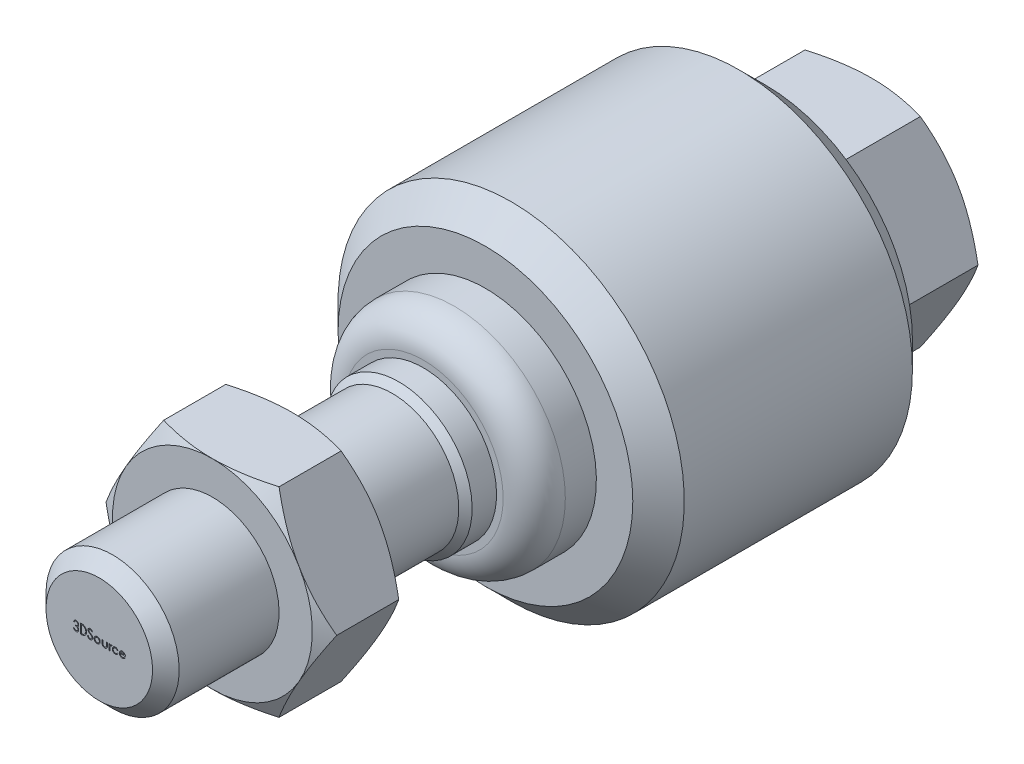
ISO-10303-21;
HEADER;
FILE_DESCRIPTION(('STEP AP214'),'2;1');
FILE_NAME('part.step','',(''),(''),'','','');
FILE_SCHEMA(('AUTOMOTIVE_DESIGN { 1 0 10303 214 1 1 1 1 }'));
ENDSEC;
DATA;
#1=APPLICATION_CONTEXT('core data for automotive mechanical design processes');
#2=APPLICATION_PROTOCOL_DEFINITION('international standard','automotive_design',2000,#1);
#3=PRODUCT_CONTEXT('',#1,'mechanical');
#4=PRODUCT('Part','Part','',(#3));
#5=PRODUCT_RELATED_PRODUCT_CATEGORY('part','',(#4));
#6=PRODUCT_DEFINITION_FORMATION('','',#4);
#7=PRODUCT_DEFINITION_CONTEXT('part definition',#1,'design');
#8=PRODUCT_DEFINITION('design','',#6,#7);
#9=PRODUCT_DEFINITION_SHAPE('','',#8);
#10=(LENGTH_UNIT() NAMED_UNIT(*) SI_UNIT(.MILLI.,.METRE.));
#11=(NAMED_UNIT(*) PLANE_ANGLE_UNIT() SI_UNIT($,.RADIAN.));
#12=(NAMED_UNIT(*) SI_UNIT($,.STERADIAN.) SOLID_ANGLE_UNIT());
#13=UNCERTAINTY_MEASURE_WITH_UNIT(LENGTH_MEASURE(1.E-05),#10,'distance_accuracy_value','');
#14=(GEOMETRIC_REPRESENTATION_CONTEXT(3) GLOBAL_UNCERTAINTY_ASSIGNED_CONTEXT((#13)) GLOBAL_UNIT_ASSIGNED_CONTEXT((#10,
#11,#12)) REPRESENTATION_CONTEXT('',''));
#15=CARTESIAN_POINT('',(0.,0.,0.));
#16=DIRECTION('',(0.,0.,1.));
#17=DIRECTION('',(1.,0.,0.));
#18=AXIS2_PLACEMENT_3D('',#15,#16,#17);
#19=CARTESIAN_POINT('',(0.,4.,0.));
#20=DIRECTION('',(0.,0.,-1.));
#21=DIRECTION('',(0.,1.,0.));
#22=AXIS2_PLACEMENT_3D('',#19,#20,#21);
#23=PLANE('',#22);
#24=DIRECTION('',(1.,0.,0.));
#25=VECTOR('',#24,1.);
#26=CARTESIAN_POINT('',(-1.33742615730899,-0.29627662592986,0.));
#27=LINE('',#26,#25);
#28=CARTESIAN_POINT('',(-1.30868787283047,-0.29627662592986,0.));
#29=VERTEX_POINT('',#28);
#30=CARTESIAN_POINT('',(-1.33742615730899,-0.29627662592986,0.));
#31=VERTEX_POINT('',#30);
#32=EDGE_CURVE('E477',#29,#31,#27,.F.);
#33=ORIENTED_EDGE('',*,*,#32,.F.);
#34=CARTESIAN_POINT('',(-1.30868787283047,0.,0.));
#35=DIRECTION('',(0.,0.,1.));
#36=DIRECTION('',(1.,0.,0.));
#37=AXIS2_PLACEMENT_3D('',#34,#35,#36);
#38=CIRCLE('',#37,0.29627662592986);
#39=CARTESIAN_POINT('',(-1.30868787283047,0.29627662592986,0.));
#40=VERTEX_POINT('',#39);
#41=EDGE_CURVE('E21',#40,#29,#38,.F.);
#42=ORIENTED_EDGE('',*,*,#41,.F.);
#43=DIRECTION('',(-1.,0.,0.));
#44=VECTOR('',#43,1.);
#45=CARTESIAN_POINT('',(-1.33742615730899,0.29627662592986,0.));
#46=LINE('',#45,#44);
#47=CARTESIAN_POINT('',(-1.33742615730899,0.29627662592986,0.));
#48=VERTEX_POINT('',#47);
#49=EDGE_CURVE('E474',#48,#40,#46,.F.);
#50=ORIENTED_EDGE('',*,*,#49,.F.);
#51=DIRECTION('',(0.,1.,0.));
#52=VECTOR('',#51,1.);
#53=CARTESIAN_POINT('',(-1.33742615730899,-0.29627662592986,0.));
#54=LINE('',#53,#52);
#55=EDGE_CURVE('E501',#31,#48,#54,.T.);
#56=ORIENTED_EDGE('',*,*,#55,.F.);
#57=EDGE_LOOP('',(#33,#42,#50,#56));
#58=FACE_BOUND('',#57,.T.);
#59=ADVANCED_FACE('F17',(#58),#23,.F.);
#60=CARTESIAN_POINT('',(0.,4.,0.));
#61=DIRECTION('',(0.,0.,-1.));
#62=DIRECTION('',(0.,1.,0.));
#63=AXIS2_PLACEMENT_3D('',#60,#61,#62);
#64=PLANE('',#63);
#65=CARTESIAN_POINT('',(-0.156500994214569,-0.131678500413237,0.));
#66=DIRECTION('',(0.,0.,1.));
#67=DIRECTION('',(1.,0.,0.));
#68=AXIS2_PLACEMENT_3D('',#65,#66,#67);
#69=CIRCLE('',#68,0.164598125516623);
#70=CARTESIAN_POINT('',(0.00809713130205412,-0.131678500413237,0.));
#71=VERTEX_POINT('',#70);
#72=EDGE_CURVE('E490',#71,#71,#69,.F.);
#73=ORIENTED_EDGE('',*,*,#72,.F.);
#74=EDGE_LOOP('',(#73));
#75=FACE_BOUND('',#74,.T.);
#76=ADVANCED_FACE('F1834',(#75),#64,.F.);
#77=CARTESIAN_POINT('',(0.,4.,0.));
#78=DIRECTION('',(0.,0.,-1.));
#79=DIRECTION('',(0.,1.,0.));
#80=AXIS2_PLACEMENT_3D('',#77,#78,#79);
#81=PLANE('',#80);
#82=CARTESIAN_POINT('',(1.7366429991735,-0.131678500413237,0.));
#83=DIRECTION('',(0.,0.,1.));
#84=DIRECTION('',(1.,0.,0.));
#85=AXIS2_PLACEMENT_3D('',#82,#83,#84);
#86=CIRCLE('',#85,0.164598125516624);
#87=CARTESIAN_POINT('',(1.58578632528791,-0.0658392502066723,0.));
#88=VERTEX_POINT('',#87);
#89=CARTESIAN_POINT('',(1.88749967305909,-0.0658392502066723,0.));
#90=VERTEX_POINT('',#89);
#91=EDGE_CURVE('E1213',#88,#90,#86,.F.);
#92=ORIENTED_EDGE('',*,*,#91,.F.);
#93=DIRECTION('',(1.,0.,0.));
#94=VECTOR('',#93,1.);
#95=CARTESIAN_POINT('',(1.58578632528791,-0.0658392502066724,0.));
#96=LINE('',#95,#94);
#97=EDGE_CURVE('E497',#90,#88,#96,.F.);
#98=ORIENTED_EDGE('',*,*,#97,.F.);
#99=EDGE_LOOP('',(#92,#98));
#100=FACE_BOUND('',#99,.T.);
#101=ADVANCED_FACE('F1248',(#100),#81,.F.);
#102=CARTESIAN_POINT('',(-1.33742615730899,-0.29627662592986,-1.));
#103=DIRECTION('',(-1.,0.,0.));
#104=DIRECTION('',(0.,0.,1.));
#105=AXIS2_PLACEMENT_3D('',#102,#103,#104);
#106=PLANE('',#105);
#107=ORIENTED_EDGE('',*,*,#55,.T.);
#108=DIRECTION('',(0.,0.,1.));
#109=VECTOR('',#108,1.);
#110=CARTESIAN_POINT('',(-1.33742615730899,0.29627662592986,-1.));
#111=LINE('',#110,#109);
#112=CARTESIAN_POINT('',(-1.33742615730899,0.29627662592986,-1.));
#113=VERTEX_POINT('',#112);
#114=EDGE_CURVE('E481',#113,#48,#111,.T.);
#115=ORIENTED_EDGE('',*,*,#114,.F.);
#116=DIRECTION('',(0.,1.,0.));
#117=VECTOR('',#116,1.);
#118=CARTESIAN_POINT('',(-1.33742615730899,0.,-1.));
#119=LINE('',#118,#117);
#120=CARTESIAN_POINT('',(-1.33742615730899,-0.29627662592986,-1.));
#121=VERTEX_POINT('',#120);
#122=EDGE_CURVE('E1203',#113,#121,#119,.F.);
#123=ORIENTED_EDGE('',*,*,#122,.T.);
#124=DIRECTION('',(0.,0.,1.));
#125=VECTOR('',#124,1.);
#126=CARTESIAN_POINT('',(-1.33742615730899,-0.29627662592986,-1.));
#127=LINE('',#126,#125);
#128=EDGE_CURVE('E506',#31,#121,#127,.F.);
#129=ORIENTED_EDGE('',*,*,#128,.F.);
#130=EDGE_LOOP('',(#107,#115,#123,#129));
#131=FACE_BOUND('',#130,.T.);
#132=ADVANCED_FACE('F1829',(#131),#106,.T.);
#133=CARTESIAN_POINT('',(-1.33742615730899,-0.29627662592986,-1.));
#134=DIRECTION('',(0.,-1.,0.));
#135=DIRECTION('',(1.,0.,0.));
#136=AXIS2_PLACEMENT_3D('',#133,#134,#135);
#137=PLANE('',#136);
#138=ORIENTED_EDGE('',*,*,#32,.T.);
#139=ORIENTED_EDGE('',*,*,#128,.T.);
#140=DIRECTION('',(-1.,0.,0.));
#141=VECTOR('',#140,1.);
#142=CARTESIAN_POINT('',(-1.30868787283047,-0.29627662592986,-1.));
#143=LINE('',#142,#141);
#144=CARTESIAN_POINT('',(-1.30868787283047,-0.29627662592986,-1.));
#145=VERTEX_POINT('',#144);
#146=EDGE_CURVE('E1200',#121,#145,#143,.F.);
#147=ORIENTED_EDGE('',*,*,#146,.T.);
#148=DIRECTION('',(0.,0.,1.));
#149=VECTOR('',#148,1.);
#150=CARTESIAN_POINT('',(-1.30868787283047,-0.29627662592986,-1.));
#151=LINE('',#150,#149);
#152=EDGE_CURVE('E482',#29,#145,#151,.F.);
#153=ORIENTED_EDGE('',*,*,#152,.F.);
#154=EDGE_LOOP('',(#138,#139,#147,#153));
#155=FACE_BOUND('',#154,.T.);
#156=ADVANCED_FACE('F1228',(#155),#137,.T.);
#157=CARTESIAN_POINT('',(-1.30868787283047,0.,-1.));
#158=DIRECTION('',(0.,0.,1.));
#159=DIRECTION('',(1.,0.,0.));
#160=AXIS2_PLACEMENT_3D('',#157,#158,#159);
#161=CYLINDRICAL_SURFACE('',#160,0.29627662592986);
#162=DIRECTION('',(0.,0.,1.));
#163=VECTOR('',#162,1.);
#164=CARTESIAN_POINT('',(-1.30868787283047,0.29627662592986,-1.));
#165=LINE('',#164,#163);
#166=CARTESIAN_POINT('',(-1.30868787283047,0.29627662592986,-1.));
#167=VERTEX_POINT('',#166);
#168=EDGE_CURVE('E484',#40,#167,#165,.F.);
#169=ORIENTED_EDGE('',*,*,#168,.F.);
#170=ORIENTED_EDGE('',*,*,#41,.T.);
#171=ORIENTED_EDGE('',*,*,#152,.T.);
#172=CARTESIAN_POINT('',(-1.30868787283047,0.,-1.));
#173=DIRECTION('',(0.,0.,1.));
#174=DIRECTION('',(1.,0.,0.));
#175=AXIS2_PLACEMENT_3D('',#172,#173,#174);
#176=CIRCLE('',#175,0.29627662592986);
#177=EDGE_CURVE('E486',#145,#167,#176,.T.);
#178=ORIENTED_EDGE('',*,*,#177,.T.);
#179=EDGE_LOOP('',(#169,#170,#171,#178));
#180=FACE_BOUND('',#179,.T.);
#181=ADVANCED_FACE('F485',(#180),#161,.T.);
#182=CARTESIAN_POINT('',(-1.33742615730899,0.29627662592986,-1.));
#183=DIRECTION('',(0.,1.,0.));
#184=DIRECTION('',(-1.,0.,0.));
#185=AXIS2_PLACEMENT_3D('',#182,#183,#184);
#186=PLANE('',#185);
#187=ORIENTED_EDGE('',*,*,#49,.T.);
#188=ORIENTED_EDGE('',*,*,#168,.T.);
#189=DIRECTION('',(-1.,0.,0.));
#190=VECTOR('',#189,1.);
#191=CARTESIAN_POINT('',(-1.30868787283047,0.29627662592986,-1.));
#192=LINE('',#191,#190);
#193=EDGE_CURVE('E1196',#167,#113,#192,.T.);
#194=ORIENTED_EDGE('',*,*,#193,.T.);
#195=ORIENTED_EDGE('',*,*,#114,.T.);
#196=EDGE_LOOP('',(#187,#188,#194,#195));
#197=FACE_BOUND('',#196,.T.);
#198=ADVANCED_FACE('F492',(#197),#186,.T.);
#199=CARTESIAN_POINT('',(-0.156500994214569,-0.131678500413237,-1.));
#200=DIRECTION('',(0.,0.,1.));
#201=DIRECTION('',(1.,0.,0.));
#202=AXIS2_PLACEMENT_3D('',#199,#200,#201);
#203=CYLINDRICAL_SURFACE('',#202,0.164598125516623);
#204=ORIENTED_EDGE('',*,*,#72,.T.);
#205=EDGE_LOOP('',(#204));
#206=FACE_BOUND('',#205,.T.);
#207=CARTESIAN_POINT('',(-0.156500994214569,-0.131678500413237,-1.));
#208=DIRECTION('',(0.,0.,1.));
#209=DIRECTION('',(1.,0.,0.));
#210=AXIS2_PLACEMENT_3D('',#207,#208,#209);
#211=CIRCLE('',#210,0.164598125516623);
#212=CARTESIAN_POINT('',(0.00809713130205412,-0.131678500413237,-1.));
#213=VERTEX_POINT('',#212);
#214=EDGE_CURVE('E1125',#213,#213,#211,.F.);
#215=ORIENTED_EDGE('',*,*,#214,.F.);
#216=EDGE_LOOP('',(#215));
#217=FACE_BOUND('',#216,.T.);
#218=ADVANCED_FACE('F1820',(#206,#217),#203,.T.);
#219=CARTESIAN_POINT('',(1.58578632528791,-0.0658392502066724,-1.));
#220=DIRECTION('',(0.,-1.,0.));
#221=DIRECTION('',(0.,0.,-1.));
#222=AXIS2_PLACEMENT_3D('',#219,#220,#221);
#223=PLANE('',#222);
#224=ORIENTED_EDGE('',*,*,#97,.T.);
#225=DIRECTION('',(0.,0.,1.));
#226=VECTOR('',#225,1.);
#227=CARTESIAN_POINT('',(1.58578632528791,-0.0658392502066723,-1.));
#228=LINE('',#227,#226);
#229=CARTESIAN_POINT('',(1.58578632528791,-0.0658392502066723,-1.));
#230=VERTEX_POINT('',#229);
#231=EDGE_CURVE('E1214',#230,#88,#228,.T.);
#232=ORIENTED_EDGE('',*,*,#231,.F.);
#233=DIRECTION('',(1.,0.,0.));
#234=VECTOR('',#233,1.);
#235=CARTESIAN_POINT('',(1.7366429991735,-0.0658392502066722,-1.));
#236=LINE('',#235,#234);
#237=CARTESIAN_POINT('',(1.88749967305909,-0.0658392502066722,-1.));
#238=VERTEX_POINT('',#237);
#239=EDGE_CURVE('E1121',#238,#230,#236,.F.);
#240=ORIENTED_EDGE('',*,*,#239,.F.);
#241=DIRECTION('',(0.,0.,1.));
#242=VECTOR('',#241,1.);
#243=CARTESIAN_POINT('',(1.88749967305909,-0.0658392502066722,-1.));
#244=LINE('',#243,#242);
#245=EDGE_CURVE('E1210',#90,#238,#244,.F.);
#246=ORIENTED_EDGE('',*,*,#245,.F.);
#247=EDGE_LOOP('',(#224,#232,#240,#246));
#248=FACE_BOUND('',#247,.T.);
#249=ADVANCED_FACE('F1245',(#248),#223,.T.);
#250=CARTESIAN_POINT('',(1.7366429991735,-0.131678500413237,-1.));
#251=DIRECTION('',(0.,0.,1.));
#252=DIRECTION('',(1.,0.,0.));
#253=AXIS2_PLACEMENT_3D('',#250,#251,#252);
#254=CYLINDRICAL_SURFACE('',#253,0.164598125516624);
#255=ORIENTED_EDGE('',*,*,#91,.T.);
#256=ORIENTED_EDGE('',*,*,#245,.T.);
#257=CARTESIAN_POINT('',(1.7366429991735,-0.131678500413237,-1.));
#258=DIRECTION('',(0.,0.,1.));
#259=DIRECTION('',(1.,0.,0.));
#260=AXIS2_PLACEMENT_3D('',#257,#258,#259);
#261=CIRCLE('',#260,0.164598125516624);
#262=EDGE_CURVE('E1124',#230,#238,#261,.F.);
#263=ORIENTED_EDGE('',*,*,#262,.F.);
#264=ORIENTED_EDGE('',*,*,#231,.T.);
#265=EDGE_LOOP('',(#255,#256,#263,#264));
#266=FACE_BOUND('',#265,.T.);
#267=ADVANCED_FACE('F1250',(#266),#254,.T.);
#268=CARTESIAN_POINT('',(-1.30868787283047,0.,-1.));
#269=DIRECTION('',(0.,0.,-1.));
#270=DIRECTION('',(-1.,0.,0.));
#271=AXIS2_PLACEMENT_3D('',#268,#269,#270);
#272=PLANE('',#271);
#273=ORIENTED_EDGE('',*,*,#177,.F.);
#274=ORIENTED_EDGE('',*,*,#146,.F.);
#275=ORIENTED_EDGE('',*,*,#122,.F.);
#276=ORIENTED_EDGE('',*,*,#193,.F.);
#277=EDGE_LOOP('',(#273,#274,#275,#276));
#278=FACE_BOUND('',#277,.T.);
#279=DIRECTION('',(1.,0.,0.));
#280=VECTOR('',#279,1.);
#281=CARTESIAN_POINT('',(-1.40326540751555,-0.362115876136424,-1.));
#282=LINE('',#281,#280);
#283=CARTESIAN_POINT('',(-1.40326540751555,-0.362115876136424,-1.));
#284=VERTEX_POINT('',#283);
#285=CARTESIAN_POINT('',(-1.30868787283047,-0.362115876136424,-1.));
#286=VERTEX_POINT('',#285);
#287=EDGE_CURVE('E1113',#284,#286,#282,.T.);
#288=ORIENTED_EDGE('',*,*,#287,.T.);
#289=CARTESIAN_POINT('',(-1.30868787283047,0.,-1.));
#290=DIRECTION('',(0.,0.,1.));
#291=DIRECTION('',(1.,0.,0.));
#292=AXIS2_PLACEMENT_3D('',#289,#290,#291);
#293=CIRCLE('',#292,0.362115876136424);
#294=CARTESIAN_POINT('',(-1.30868787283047,0.362115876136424,-1.));
#295=VERTEX_POINT('',#294);
#296=EDGE_CURVE('E1103',#286,#295,#293,.T.);
#297=ORIENTED_EDGE('',*,*,#296,.T.);
#298=DIRECTION('',(1.,0.,0.));
#299=VECTOR('',#298,1.);
#300=CARTESIAN_POINT('',(-1.40326540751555,0.362115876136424,-1.));
#301=LINE('',#300,#299);
#302=CARTESIAN_POINT('',(-1.40326540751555,0.362115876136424,-1.));
#303=VERTEX_POINT('',#302);
#304=EDGE_CURVE('E1102',#295,#303,#301,.F.);
#305=ORIENTED_EDGE('',*,*,#304,.T.);
#306=DIRECTION('',(0.,1.,0.));
#307=VECTOR('',#306,1.);
#308=CARTESIAN_POINT('',(-1.40326540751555,-0.362115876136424,-1.));
#309=LINE('',#308,#307);
#310=EDGE_CURVE('E1117',#303,#284,#309,.F.);
#311=ORIENTED_EDGE('',*,*,#310,.T.);
#312=EDGE_LOOP('',(#288,#297,#305,#311));
#313=FACE_BOUND('',#312,.T.);
#314=ADVANCED_FACE('F1232',(#278,#313),#272,.F.);
#315=CARTESIAN_POINT('',(-1.73664299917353,0.164598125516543,-1.));
#316=DIRECTION('',(0.,0.,-1.));
#317=DIRECTION('',(-1.,0.,0.));
#318=AXIS2_PLACEMENT_3D('',#315,#316,#317);
#319=PLANE('',#318);
#320=DIRECTION('',(-1.,0.,0.));
#321=VECTOR('',#320,1.);
#322=CARTESIAN_POINT('',(-1.73664299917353,0.0329196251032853,-1.));
#323=LINE('',#322,#321);
#324=CARTESIAN_POINT('',(-1.73664299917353,0.0329196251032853,-1.));
#325=VERTEX_POINT('',#324);
#326=CARTESIAN_POINT('',(-1.76956262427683,0.0329196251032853,-1.));
#327=VERTEX_POINT('',#326);
#328=EDGE_CURVE('E1092',#325,#327,#323,.T.);
#329=ORIENTED_EDGE('',*,*,#328,.T.);
#330=DIRECTION('',(0.,-1.,0.));
#331=VECTOR('',#330,1.);
#332=CARTESIAN_POINT('',(-1.76956262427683,0.0329196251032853,-1.));
#333=LINE('',#332,#331);
#334=CARTESIAN_POINT('',(-1.76956262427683,-0.0329196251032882,-1.));
#335=VERTEX_POINT('',#334);
#336=EDGE_CURVE('E1083',#327,#335,#333,.T.);
#337=ORIENTED_EDGE('',*,*,#336,.T.);
#338=DIRECTION('',(1.,0.,0.));
#339=VECTOR('',#338,1.);
#340=CARTESIAN_POINT('',(-1.73664299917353,-0.0329196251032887,-1.));
#341=LINE('',#340,#339);
#342=CARTESIAN_POINT('',(-1.73664299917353,-0.0329196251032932,-1.));
#343=VERTEX_POINT('',#342);
#344=EDGE_CURVE('E1079',#335,#343,#341,.T.);
#345=ORIENTED_EDGE('',*,*,#344,.T.);
#346=CARTESIAN_POINT('',(-1.73664299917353,-0.164598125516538,-1.));
#347=DIRECTION('',(0.,0.,1.));
#348=DIRECTION('',(1.,0.,0.));
#349=AXIS2_PLACEMENT_3D('',#346,#347,#348);
#350=CIRCLE('',#349,0.131678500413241);
#351=CARTESIAN_POINT('',(-1.86414015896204,-0.197517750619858,-1.));
#352=VERTEX_POINT('',#351);
#353=EDGE_CURVE('E1075',#352,#343,#350,.T.);
#354=ORIENTED_EDGE('',*,*,#353,.F.);
#355=DIRECTION('',(-1.,0.,0.));
#356=VECTOR('',#355,1.);
#357=CARTESIAN_POINT('',(-1.86414015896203,-0.197517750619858,-1.));
#358=LINE('',#357,#356);
#359=CARTESIAN_POINT('',(-1.92997940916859,-0.197517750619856,-1.));
#360=VERTEX_POINT('',#359);
#361=EDGE_CURVE('E1071',#352,#360,#358,.T.);
#362=ORIENTED_EDGE('',*,*,#361,.T.);
#363=CARTESIAN_POINT('',(-1.73664299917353,-0.164598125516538,-1.));
#364=DIRECTION('',(0.,0.,1.));
#365=DIRECTION('',(1.,0.,0.));
#366=AXIS2_PLACEMENT_3D('',#363,#364,#365);
#367=CIRCLE('',#366,0.196119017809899);
#368=CARTESIAN_POINT('',(-1.63001220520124,0.,-1.));
#369=VERTEX_POINT('',#368);
#370=EDGE_CURVE('E1067',#360,#369,#367,.T.);
#371=ORIENTED_EDGE('',*,*,#370,.T.);
#372=CARTESIAN_POINT('',(-1.73664299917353,0.164598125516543,-1.));
#373=DIRECTION('',(0.,0.,1.));
#374=DIRECTION('',(1.,0.,0.));
#375=AXIS2_PLACEMENT_3D('',#372,#373,#374);
#376=CIRCLE('',#375,0.1961190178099);
#377=CARTESIAN_POINT('',(-1.92997940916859,0.197517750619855,-1.));
#378=VERTEX_POINT('',#377);
#379=EDGE_CURVE('E1063',#369,#378,#376,.T.);
#380=ORIENTED_EDGE('',*,*,#379,.T.);
#381=DIRECTION('',(1.,0.,0.));
#382=VECTOR('',#381,1.);
#383=CARTESIAN_POINT('',(-1.92997940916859,0.197517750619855,-1.));
#384=LINE('',#383,#382);
#385=CARTESIAN_POINT('',(-1.86414015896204,0.197517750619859,-1.));
#386=VERTEX_POINT('',#385);
#387=EDGE_CURVE('E1062',#378,#386,#384,.T.);
#388=ORIENTED_EDGE('',*,*,#387,.T.);
#389=CARTESIAN_POINT('',(-1.73664299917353,0.164598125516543,-1.));
#390=DIRECTION('',(0.,0.,1.));
#391=DIRECTION('',(1.,0.,0.));
#392=AXIS2_PLACEMENT_3D('',#389,#390,#391);
#393=CIRCLE('',#392,0.131678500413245);
#394=EDGE_CURVE('E1058',#325,#386,#393,.T.);
#395=ORIENTED_EDGE('',*,*,#394,.F.);
#396=EDGE_LOOP('',(#329,#337,#345,#354,#362,#371,#380,#388,#395));
#397=FACE_BOUND('',#396,.T.);
#398=ADVANCED_FACE('F1809',(#397),#319,.F.);
#399=CARTESIAN_POINT('',(-0.683214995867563,0.197517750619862,-1.));
#400=DIRECTION('',(0.,0.,1.));
#401=DIRECTION('',(1.,0.,0.));
#402=AXIS2_PLACEMENT_3D('',#399,#400,#401);
#403=PLANE('',#402);
#404=CARTESIAN_POINT('',(-0.683214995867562,-0.164598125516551,-1.));
#405=DIRECTION('',(0.,0.,1.));
#406=DIRECTION('',(1.,0.,0.));
#407=AXIS2_PLACEMENT_3D('',#404,#405,#406);
#408=CIRCLE('',#407,0.131678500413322);
#409=CARTESIAN_POINT('',(-0.81417214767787,-0.178362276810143,-1.));
#410=VERTEX_POINT('',#409);
#411=CARTESIAN_POINT('',(-0.607505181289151,-0.0568611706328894,-1.));
#412=VERTEX_POINT('',#411);
#413=EDGE_CURVE('E1042',#410,#412,#408,.T.);
#414=ORIENTED_EDGE('',*,*,#413,.F.);
#415=DIRECTION('',(-0.994521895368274,-0.104528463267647,0.));
#416=VECTOR('',#415,1.);
#417=CARTESIAN_POINT('',(-0.814172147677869,-0.178362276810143,-1.));
#418=LINE('',#417,#416);
#419=CARTESIAN_POINT('',(-0.879650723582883,-0.185244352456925,-1.));
#420=VERTEX_POINT('',#419);
#421=EDGE_CURVE('E1038',#410,#420,#418,.T.);
#422=ORIENTED_EDGE('',*,*,#421,.T.);
#423=CARTESIAN_POINT('',(-0.683214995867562,-0.164598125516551,-1.));
#424=DIRECTION('',(0.,0.,1.));
#425=DIRECTION('',(1.,0.,0.));
#426=AXIS2_PLACEMENT_3D('',#423,#424,#425);
#427=CIRCLE('',#426,0.19751775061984);
#428=CARTESIAN_POINT('',(-0.569650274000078,-0.00299269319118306,-1.));
#429=VERTEX_POINT('',#428);
#430=EDGE_CURVE('E1034',#420,#429,#427,.T.);
#431=ORIENTED_EDGE('',*,*,#430,.T.);
#432=DIRECTION('',(-0.818181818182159,0.574959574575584,0.));
#433=VECTOR('',#432,1.);
#434=CARTESIAN_POINT('',(-0.739997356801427,0.116715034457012,-1.));
#435=LINE('',#434,#433);
#436=CARTESIAN_POINT('',(-0.73999735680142,0.116715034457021,-1.));
#437=VERTEX_POINT('',#436);
#438=EDGE_CURVE('E1033',#429,#437,#435,.T.);
#439=ORIENTED_EDGE('',*,*,#438,.T.);
#440=CARTESIAN_POINT('',(-0.683214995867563,0.197517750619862,-1.));
#441=DIRECTION('',(0.,0.,1.));
#442=DIRECTION('',(1.,0.,0.));
#443=AXIS2_PLACEMENT_3D('',#440,#441,#442);
#444=CIRCLE('',#443,0.0987588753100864);
#445=CARTESIAN_POINT('',(-0.584997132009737,0.207840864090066,-1.));
#446=VERTEX_POINT('',#445);
#447=EDGE_CURVE('E1026',#446,#437,#444,.T.);
#448=ORIENTED_EDGE('',*,*,#447,.F.);
#449=DIRECTION('',(0.994521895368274,0.104528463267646,0.));
#450=VECTOR('',#449,1.);
#451=CARTESIAN_POINT('',(-0.519518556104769,0.214722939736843,-1.));
#452=LINE('',#451,#450);
#453=CARTESIAN_POINT('',(-0.519518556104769,0.214722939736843,-1.));
#454=VERTEX_POINT('',#453);
#455=EDGE_CURVE('E1054',#446,#454,#452,.T.);
#456=ORIENTED_EDGE('',*,*,#455,.T.);
#457=CARTESIAN_POINT('',(-0.683214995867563,0.197517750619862,-1.));
#458=DIRECTION('',(0.,0.,1.));
#459=DIRECTION('',(1.,0.,0.));
#460=AXIS2_PLACEMENT_3D('',#457,#458,#459);
#461=CIRCLE('',#460,0.16459812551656);
#462=CARTESIAN_POINT('',(-0.777852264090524,0.0628465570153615,-1.));
#463=VERTEX_POINT('',#462);
#464=EDGE_CURVE('E1050',#454,#463,#461,.T.);
#465=ORIENTED_EDGE('',*,*,#464,.T.);
#466=DIRECTION('',(0.818181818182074,-0.574959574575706,0.));
#467=VECTOR('',#466,1.);
#468=CARTESIAN_POINT('',(-0.777852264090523,0.0628465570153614,-1.));
#469=LINE('',#468,#467);
#470=EDGE_CURVE('E1046',#463,#412,#469,.T.);
#471=ORIENTED_EDGE('',*,*,#470,.T.);
#472=EDGE_LOOP('',(#414,#422,#431,#439,#448,#456,#465,#471));
#473=FACE_BOUND('',#472,.T.);
#474=ADVANCED_FACE('F1805',(#473),#403,.T.);
#475=CARTESIAN_POINT('',(-0.156500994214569,-0.131678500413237,-1.));
#476=DIRECTION('',(0.,0.,1.));
#477=DIRECTION('',(1.,0.,0.));
#478=AXIS2_PLACEMENT_3D('',#475,#476,#477);
#479=PLANE('',#478);
#480=ORIENTED_EDGE('',*,*,#214,.T.);
#481=EDGE_LOOP('',(#480));
#482=FACE_BOUND('',#481,.T.);
#483=CARTESIAN_POINT('',(-0.156500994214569,-0.131678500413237,-1.));
#484=DIRECTION('',(0.,0.,1.));
#485=DIRECTION('',(1.,0.,0.));
#486=AXIS2_PLACEMENT_3D('',#483,#484,#485);
#487=CIRCLE('',#486,0.230437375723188);
#488=CARTESIAN_POINT('',(0.0739363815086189,-0.131678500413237,-1.));
#489=VERTEX_POINT('',#488);
#490=EDGE_CURVE('E1029',#489,#489,#487,.T.);
#491=ORIENTED_EDGE('',*,*,#490,.T.);
#492=EDGE_LOOP('',(#491));
#493=FACE_BOUND('',#492,.T.);
#494=ADVANCED_FACE('F1801',(#482,#493),#479,.T.);
#495=CARTESIAN_POINT('',(0.411495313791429,-0.164598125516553,-1.));
#496=DIRECTION('',(0.,0.,1.));
#497=DIRECTION('',(1.,0.,0.));
#498=AXIS2_PLACEMENT_3D('',#495,#496,#497);
#499=PLANE('',#498);
#500=DIRECTION('',(-1.,0.,0.));
#501=VECTOR('',#500,1.);
#502=CARTESIAN_POINT('',(0.609013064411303,0.0987588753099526,-1.));
#503=LINE('',#502,#501);
#504=CARTESIAN_POINT('',(0.609013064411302,0.0987588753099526,-1.));
#505=VERTEX_POINT('',#504);
#506=CARTESIAN_POINT('',(0.543173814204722,0.0987588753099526,-1.));
#507=VERTEX_POINT('',#506);
#508=EDGE_CURVE('E998',#505,#507,#503,.T.);
#509=ORIENTED_EDGE('',*,*,#508,.T.);
#510=DIRECTION('',(0.,-1.,0.));
#511=VECTOR('',#510,1.);
#512=CARTESIAN_POINT('',(0.543173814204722,0.0987588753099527,-1.));
#513=LINE('',#512,#511);
#514=CARTESIAN_POINT('',(0.543173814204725,-0.164598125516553,-1.));
#515=VERTEX_POINT('',#514);
#516=EDGE_CURVE('E997',#507,#515,#513,.T.);
#517=ORIENTED_EDGE('',*,*,#516,.T.);
#518=CARTESIAN_POINT('',(0.411495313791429,-0.164598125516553,-1.));
#519=DIRECTION('',(0.,0.,1.));
#520=DIRECTION('',(1.,0.,0.));
#521=AXIS2_PLACEMENT_3D('',#518,#519,#520);
#522=CIRCLE('',#521,0.131678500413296);
#523=CARTESIAN_POINT('',(0.279816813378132,-0.164598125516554,-1.));
#524=VERTEX_POINT('',#523);
#525=EDGE_CURVE('E993',#524,#515,#522,.T.);
#526=ORIENTED_EDGE('',*,*,#525,.F.);
#527=DIRECTION('',(0.,1.,0.));
#528=VECTOR('',#527,1.);
#529=CARTESIAN_POINT('',(0.27981681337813,0.0987588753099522,-1.));
#530=LINE('',#529,#528);
#531=CARTESIAN_POINT('',(0.279816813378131,0.0987588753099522,-1.));
#532=VERTEX_POINT('',#531);
#533=EDGE_CURVE('E979',#524,#532,#530,.T.);
#534=ORIENTED_EDGE('',*,*,#533,.T.);
#535=DIRECTION('',(-1.,0.,0.));
#536=VECTOR('',#535,1.);
#537=CARTESIAN_POINT('',(0.213977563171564,0.0987588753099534,-1.));
#538=LINE('',#537,#536);
#539=CARTESIAN_POINT('',(0.213977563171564,0.0987588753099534,-1.));
#540=VERTEX_POINT('',#539);
#541=EDGE_CURVE('E984',#532,#540,#538,.T.);
#542=ORIENTED_EDGE('',*,*,#541,.T.);
#543=DIRECTION('',(0.,-1.,0.));
#544=VECTOR('',#543,1.);
#545=CARTESIAN_POINT('',(0.213977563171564,0.0987588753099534,-1.));
#546=LINE('',#545,#544);
#547=CARTESIAN_POINT('',(0.21397756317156,-0.164598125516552,-1.));
#548=VERTEX_POINT('',#547);
#549=EDGE_CURVE('E1017',#540,#548,#546,.T.);
#550=ORIENTED_EDGE('',*,*,#549,.T.);
#551=CARTESIAN_POINT('',(0.411495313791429,-0.164598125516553,-1.));
#552=DIRECTION('',(0.,0.,1.));
#553=DIRECTION('',(1.,0.,0.));
#554=AXIS2_PLACEMENT_3D('',#551,#552,#553);
#555=CIRCLE('',#554,0.19751775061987);
#556=CARTESIAN_POINT('',(0.609013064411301,-0.164598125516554,-1.));
#557=VERTEX_POINT('',#556);
#558=EDGE_CURVE('E1013',#548,#557,#555,.T.);
#559=ORIENTED_EDGE('',*,*,#558,.T.);
#560=DIRECTION('',(0.,1.,0.));
#561=VECTOR('',#560,1.);
#562=CARTESIAN_POINT('',(0.609013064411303,0.0987588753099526,-1.));
#563=LINE('',#562,#561);
#564=EDGE_CURVE('E1007',#557,#505,#563,.T.);
#565=ORIENTED_EDGE('',*,*,#564,.T.);
#566=EDGE_LOOP('',(#509,#517,#526,#534,#542,#550,#559,#565));
#567=FACE_BOUND('',#566,.T.);
#568=ADVANCED_FACE('F1797',(#567),#499,.T.);
#569=CARTESIAN_POINT('',(0.94657199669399,-0.0919479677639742,-1.));
#570=DIRECTION('',(0.,0.,1.));
#571=DIRECTION('',(1.,0.,0.));
#572=AXIS2_PLACEMENT_3D('',#569,#570,#571);
#573=PLANE('',#572);
#574=DIRECTION('',(0.,1.,0.));
#575=VECTOR('',#574,1.);
#576=CARTESIAN_POINT('',(0.946571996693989,0.0329196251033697,-1.));
#577=LINE('',#576,#575);
#578=CARTESIAN_POINT('',(0.946571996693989,0.0329196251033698,-1.));
#579=VERTEX_POINT('',#578);
#580=CARTESIAN_POINT('',(0.94657199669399,0.0987588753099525,-1.));
#581=VERTEX_POINT('',#580);
#582=EDGE_CURVE('E939',#579,#581,#577,.T.);
#583=ORIENTED_EDGE('',*,*,#582,.T.);
#584=CARTESIAN_POINT('',(0.946571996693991,-0.0384062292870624,-1.));
#585=DIRECTION('',(0.,0.,1.));
#586=DIRECTION('',(1.,0.,0.));
#587=AXIS2_PLACEMENT_3D('',#584,#585,#586);
#588=CIRCLE('',#587,0.137165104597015);
#589=CARTESIAN_POINT('',(0.814893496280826,0.,-1.));
#590=VERTEX_POINT('',#589);
#591=EDGE_CURVE('E926',#581,#590,#588,.T.);
#592=ORIENTED_EDGE('',*,*,#591,.T.);
#593=DIRECTION('',(0.,1.,0.));
#594=VECTOR('',#593,1.);
#595=CARTESIAN_POINT('',(0.814893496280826,0.098758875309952,-1.));
#596=LINE('',#595,#594);
#597=CARTESIAN_POINT('',(0.814893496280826,0.098758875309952,-1.));
#598=VERTEX_POINT('',#597);
#599=EDGE_CURVE('E925',#590,#598,#596,.T.);
#600=ORIENTED_EDGE('',*,*,#599,.T.);
#601=DIRECTION('',(1.,0.,0.));
#602=VECTOR('',#601,1.);
#603=CARTESIAN_POINT('',(0.749054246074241,0.098758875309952,-1.));
#604=LINE('',#603,#602);
#605=CARTESIAN_POINT('',(0.749054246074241,0.098758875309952,-1.));
#606=VERTEX_POINT('',#605);
#607=EDGE_CURVE('E930',#598,#606,#604,.F.);
#608=ORIENTED_EDGE('',*,*,#607,.T.);
#609=DIRECTION('',(0.,1.,0.));
#610=VECTOR('',#609,1.);
#611=CARTESIAN_POINT('',(0.749054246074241,0.098758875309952,-1.));
#612=LINE('',#611,#610);
#613=CARTESIAN_POINT('',(0.749054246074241,-0.362115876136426,-1.));
#614=VERTEX_POINT('',#613);
#615=EDGE_CURVE('E973',#606,#614,#612,.F.);
#616=ORIENTED_EDGE('',*,*,#615,.T.);
#617=DIRECTION('',(1.,0.,0.));
#618=VECTOR('',#617,1.);
#619=CARTESIAN_POINT('',(0.749054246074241,-0.362115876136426,-1.));
#620=LINE('',#619,#618);
#621=CARTESIAN_POINT('',(0.814893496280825,-0.362115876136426,-1.));
#622=VERTEX_POINT('',#621);
#623=EDGE_CURVE('E961',#614,#622,#620,.T.);
#624=ORIENTED_EDGE('',*,*,#623,.T.);
#625=DIRECTION('',(0.,1.,0.));
#626=VECTOR('',#625,1.);
#627=CARTESIAN_POINT('',(0.814893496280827,-0.131678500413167,-1.));
#628=LINE('',#627,#626);
#629=CARTESIAN_POINT('',(0.814893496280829,-0.131678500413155,-1.));
#630=VERTEX_POINT('',#629);
#631=EDGE_CURVE('E951',#622,#630,#628,.T.);
#632=ORIENTED_EDGE('',*,*,#631,.T.);
#633=DIRECTION('',(0.13917310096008,0.990268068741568,0.));
#634=VECTOR('',#633,1.);
#635=CARTESIAN_POINT('',(0.822919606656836,-0.0745697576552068,-1.));
#636=LINE('',#635,#634);
#637=CARTESIAN_POINT('',(0.822919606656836,-0.0745697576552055,-1.));
#638=VERTEX_POINT('',#637);
#639=EDGE_CURVE('E950',#630,#638,#636,.T.);
#640=ORIENTED_EDGE('',*,*,#639,.T.);
#641=CARTESIAN_POINT('',(0.94657199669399,-0.0919479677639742,-1.));
#642=DIRECTION('',(0.,0.,1.));
#643=DIRECTION('',(1.,0.,0.));
#644=AXIS2_PLACEMENT_3D('',#641,#642,#643);
#645=CIRCLE('',#644,0.124867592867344);
#646=EDGE_CURVE('E946',#579,#638,#645,.T.);
#647=ORIENTED_EDGE('',*,*,#646,.F.);
#648=EDGE_LOOP('',(#583,#592,#600,#608,#616,#624,#632,#640,#647));
#649=FACE_BOUND('',#648,.T.);
#650=ADVANCED_FACE('F1793',(#649),#573,.T.);
#651=CARTESIAN_POINT('',(1.20992899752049,-0.131678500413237,-1.));
#652=DIRECTION('',(0.,0.,1.));
#653=DIRECTION('',(1.,0.,0.));
#654=AXIS2_PLACEMENT_3D('',#651,#652,#653);
#655=PLANE('',#654);
#656=CARTESIAN_POINT('',(1.20992899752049,-0.131678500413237,-1.));
#657=DIRECTION('',(0.,0.,1.));
#658=DIRECTION('',(1.,0.,0.));
#659=AXIS2_PLACEMENT_3D('',#656,#657,#658);
#660=CIRCLE('',#659,0.164598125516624);
#661=CARTESIAN_POINT('',(1.35247515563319,-0.0493794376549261,-1.));
#662=VERTEX_POINT('',#661);
#663=CARTESIAN_POINT('',(1.35247515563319,-0.213977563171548,-1.));
#664=VERTEX_POINT('',#663);
#665=EDGE_CURVE('E909',#662,#664,#660,.T.);
#666=ORIENTED_EDGE('',*,*,#665,.F.);
#667=DIRECTION('',(0.866025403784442,0.499999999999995,0.));
#668=VECTOR('',#667,1.);
#669=CARTESIAN_POINT('',(1.35247515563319,-0.0493794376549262,-1.));
#670=LINE('',#669,#668);
#671=CARTESIAN_POINT('',(1.40949361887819,-0.0164598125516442,-1.));
#672=VERTEX_POINT('',#671);
#673=EDGE_CURVE('E921',#662,#672,#670,.T.);
#674=ORIENTED_EDGE('',*,*,#673,.T.);
#675=CARTESIAN_POINT('',(1.20992899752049,-0.131678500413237,-1.));
#676=DIRECTION('',(0.,0.,1.));
#677=DIRECTION('',(1.,0.,0.));
#678=AXIS2_PLACEMENT_3D('',#675,#676,#677);
#679=CIRCLE('',#678,0.230437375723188);
#680=CARTESIAN_POINT('',(1.40949361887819,-0.24689718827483,-1.));
#681=VERTEX_POINT('',#680);
#682=EDGE_CURVE('E917',#672,#681,#679,.T.);
#683=ORIENTED_EDGE('',*,*,#682,.T.);
#684=DIRECTION('',(-0.866025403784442,0.499999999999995,0.));
#685=VECTOR('',#684,1.);
#686=CARTESIAN_POINT('',(1.35247515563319,-0.213977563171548,-1.));
#687=LINE('',#686,#685);
#688=EDGE_CURVE('E916',#681,#664,#687,.T.);
#689=ORIENTED_EDGE('',*,*,#688,.T.);
#690=EDGE_LOOP('',(#666,#674,#683,#689));
#691=FACE_BOUND('',#690,.T.);
#692=ADVANCED_FACE('F1257',(#691),#655,.T.);
#693=CARTESIAN_POINT('',(1.7366429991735,-0.131678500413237,-1.));
#694=DIRECTION('',(0.,0.,1.));
#695=DIRECTION('',(1.,0.,0.));
#696=AXIS2_PLACEMENT_3D('',#693,#694,#695);
#697=PLANE('',#696);
#698=ORIENTED_EDGE('',*,*,#239,.T.);
#699=ORIENTED_EDGE('',*,*,#262,.T.);
#700=EDGE_LOOP('',(#698,#699));
#701=FACE_BOUND('',#700,.T.);
#702=CARTESIAN_POINT('',(1.7366429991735,-0.131678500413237,-1.));
#703=DIRECTION('',(0.,0.,1.));
#704=DIRECTION('',(1.,0.,0.));
#705=AXIS2_PLACEMENT_3D('',#702,#703,#704);
#706=CIRCLE('',#705,0.230437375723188);
#707=CARTESIAN_POINT('',(1.96708037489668,-0.131678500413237,-1.));
#708=VERTEX_POINT('',#707);
#709=CARTESIAN_POINT('',(1.9362076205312,-0.246897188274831,-1.));
#710=VERTEX_POINT('',#709);
#711=EDGE_CURVE('E893',#708,#710,#706,.T.);
#712=ORIENTED_EDGE('',*,*,#711,.T.);
#713=DIRECTION('',(-0.866025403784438,0.500000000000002,0.));
#714=VECTOR('',#713,1.);
#715=CARTESIAN_POINT('',(1.87918915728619,-0.213977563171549,-1.));
#716=LINE('',#715,#714);
#717=CARTESIAN_POINT('',(1.87918915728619,-0.213977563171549,-1.));
#718=VERTEX_POINT('',#717);
#719=EDGE_CURVE('E912',#710,#718,#716,.T.);
#720=ORIENTED_EDGE('',*,*,#719,.T.);
#721=CARTESIAN_POINT('',(1.7366429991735,-0.131678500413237,-1.));
#722=DIRECTION('',(0.,0.,1.));
#723=DIRECTION('',(1.,0.,0.));
#724=AXIS2_PLACEMENT_3D('',#721,#722,#723);
#725=CIRCLE('',#724,0.164598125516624);
#726=CARTESIAN_POINT('',(1.57204487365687,-0.131678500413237,-1.));
#727=VERTEX_POINT('',#726);
#728=EDGE_CURVE('E904',#727,#718,#725,.T.);
#729=ORIENTED_EDGE('',*,*,#728,.F.);
#730=DIRECTION('',(1.,0.,0.));
#731=VECTOR('',#730,1.);
#732=CARTESIAN_POINT('',(1.57204487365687,-0.131678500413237,-1.));
#733=LINE('',#732,#731);
#734=EDGE_CURVE('E897',#727,#708,#733,.T.);
#735=ORIENTED_EDGE('',*,*,#734,.T.);
#736=EDGE_LOOP('',(#712,#720,#729,#735));
#737=FACE_BOUND('',#736,.T.);
#738=ADVANCED_FACE('F1253',(#701,#737),#697,.T.);
#739=CARTESIAN_POINT('',(-1.40326540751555,-0.362115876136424,-1.));
#740=DIRECTION('',(-1.,0.,0.));
#741=DIRECTION('',(0.,0.,1.));
#742=AXIS2_PLACEMENT_3D('',#739,#740,#741);
#743=PLANE('',#742);
#744=ORIENTED_EDGE('',*,*,#310,.F.);
#745=DIRECTION('',(0.,0.,1.));
#746=VECTOR('',#745,1.);
#747=CARTESIAN_POINT('',(-1.40326540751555,0.362115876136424,-1.));
#748=LINE('',#747,#746);
#749=CARTESIAN_POINT('',(-1.40326540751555,0.362115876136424,0.));
#750=VERTEX_POINT('',#749);
#751=EDGE_CURVE('E1098',#303,#750,#748,.T.);
#752=ORIENTED_EDGE('',*,*,#751,.T.);
#753=DIRECTION('',(0.,1.,0.));
#754=VECTOR('',#753,1.);
#755=CARTESIAN_POINT('',(-1.40326540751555,4.,0.));
#756=LINE('',#755,#754);
#757=CARTESIAN_POINT('',(-1.40326540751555,-0.362115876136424,0.));
#758=VERTEX_POINT('',#757);
#759=EDGE_CURVE('E888',#750,#758,#756,.F.);
#760=ORIENTED_EDGE('',*,*,#759,.T.);
#761=DIRECTION('',(0.,0.,-1.));
#762=VECTOR('',#761,1.);
#763=CARTESIAN_POINT('',(-1.40326540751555,-0.362115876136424,-1.));
#764=LINE('',#763,#762);
#765=EDGE_CURVE('E1114',#758,#284,#764,.T.);
#766=ORIENTED_EDGE('',*,*,#765,.T.);
#767=EDGE_LOOP('',(#744,#752,#760,#766));
#768=FACE_BOUND('',#767,.T.);
#769=ADVANCED_FACE('F1256',(#768),#743,.F.);
#770=CARTESIAN_POINT('',(-1.40326540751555,-0.362115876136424,-1.));
#771=DIRECTION('',(0.,-1.,0.));
#772=DIRECTION('',(0.,0.,-1.));
#773=AXIS2_PLACEMENT_3D('',#770,#771,#772);
#774=PLANE('',#773);
#775=ORIENTED_EDGE('',*,*,#287,.F.);
#776=ORIENTED_EDGE('',*,*,#765,.F.);
#777=DIRECTION('',(1.,0.,0.));
#778=VECTOR('',#777,1.);
#779=CARTESIAN_POINT('',(0.,-0.362115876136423,0.));
#780=LINE('',#779,#778);
#781=CARTESIAN_POINT('',(-1.30868787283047,-0.362115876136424,0.));
#782=VERTEX_POINT('',#781);
#783=EDGE_CURVE('E885',#758,#782,#780,.T.);
#784=ORIENTED_EDGE('',*,*,#783,.T.);
#785=DIRECTION('',(0.,0.,1.));
#786=VECTOR('',#785,1.);
#787=CARTESIAN_POINT('',(-1.30868787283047,-0.362115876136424,-1.));
#788=LINE('',#787,#786);
#789=EDGE_CURVE('E1110',#782,#286,#788,.F.);
#790=ORIENTED_EDGE('',*,*,#789,.T.);
#791=EDGE_LOOP('',(#775,#776,#784,#790));
#792=FACE_BOUND('',#791,.T.);
#793=ADVANCED_FACE('F1324',(#792),#774,.F.);
#794=CARTESIAN_POINT('',(-1.30868787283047,0.,-1.));
#795=DIRECTION('',(0.,0.,1.));
#796=DIRECTION('',(1.,0.,0.));
#797=AXIS2_PLACEMENT_3D('',#794,#795,#796);
#798=CYLINDRICAL_SURFACE('',#797,0.362115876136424);
#799=ORIENTED_EDGE('',*,*,#296,.F.);
#800=ORIENTED_EDGE('',*,*,#789,.F.);
#801=CARTESIAN_POINT('',(-1.30868787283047,0.,0.));
#802=DIRECTION('',(0.,0.,1.));
#803=DIRECTION('',(1.,0.,0.));
#804=AXIS2_PLACEMENT_3D('',#801,#802,#803);
#805=CIRCLE('',#804,0.362115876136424);
#806=CARTESIAN_POINT('',(-1.30868787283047,0.362115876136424,0.));
#807=VERTEX_POINT('',#806);
#808=EDGE_CURVE('E882',#782,#807,#805,.T.);
#809=ORIENTED_EDGE('',*,*,#808,.T.);
#810=DIRECTION('',(0.,0.,1.));
#811=VECTOR('',#810,1.);
#812=CARTESIAN_POINT('',(-1.30868787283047,0.362115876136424,-1.));
#813=LINE('',#812,#811);
#814=EDGE_CURVE('E1099',#807,#295,#813,.F.);
#815=ORIENTED_EDGE('',*,*,#814,.T.);
#816=EDGE_LOOP('',(#799,#800,#809,#815));
#817=FACE_BOUND('',#816,.T.);
#818=ADVANCED_FACE('F1314',(#817),#798,.F.);
#819=CARTESIAN_POINT('',(-1.40326540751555,0.362115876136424,-1.));
#820=DIRECTION('',(0.,1.,0.));
#821=DIRECTION('',(0.,0.,1.));
#822=AXIS2_PLACEMENT_3D('',#819,#820,#821);
#823=PLANE('',#822);
#824=ORIENTED_EDGE('',*,*,#304,.F.);
#825=ORIENTED_EDGE('',*,*,#814,.F.);
#826=DIRECTION('',(1.,0.,0.));
#827=VECTOR('',#826,1.);
#828=CARTESIAN_POINT('',(0.,0.362115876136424,0.));
#829=LINE('',#828,#827);
#830=EDGE_CURVE('E877',#807,#750,#829,.F.);
#831=ORIENTED_EDGE('',*,*,#830,.T.);
#832=ORIENTED_EDGE('',*,*,#751,.F.);
#833=EDGE_LOOP('',(#824,#825,#831,#832));
#834=FACE_BOUND('',#833,.T.);
#835=ADVANCED_FACE('F1318',(#834),#823,.F.);
#836=CARTESIAN_POINT('',(-1.73664299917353,0.0329196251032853,-1.));
#837=DIRECTION('',(0.,1.,0.));
#838=DIRECTION('',(-1.,0.,0.));
#839=AXIS2_PLACEMENT_3D('',#836,#837,#838);
#840=PLANE('',#839);
#841=ORIENTED_EDGE('',*,*,#328,.F.);
#842=DIRECTION('',(0.,0.,1.));
#843=VECTOR('',#842,1.);
#844=CARTESIAN_POINT('',(-1.73664299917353,0.0329196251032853,-1.));
#845=LINE('',#844,#843);
#846=CARTESIAN_POINT('',(-1.73664299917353,0.0329196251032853,0.));
#847=VERTEX_POINT('',#846);
#848=EDGE_CURVE('E1095',#847,#325,#845,.F.);
#849=ORIENTED_EDGE('',*,*,#848,.F.);
#850=DIRECTION('',(1.,0.,0.));
#851=VECTOR('',#850,1.);
#852=CARTESIAN_POINT('',(0.,0.0329196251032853,0.));
#853=LINE('',#852,#851);
#854=CARTESIAN_POINT('',(-1.76956262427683,0.0329196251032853,0.));
#855=VERTEX_POINT('',#854);
#856=EDGE_CURVE('E875',#847,#855,#853,.F.);
#857=ORIENTED_EDGE('',*,*,#856,.T.);
#858=DIRECTION('',(0.,0.,1.));
#859=VECTOR('',#858,1.);
#860=CARTESIAN_POINT('',(-1.76956262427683,0.0329196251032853,-1.));
#861=LINE('',#860,#859);
#862=EDGE_CURVE('E1089',#855,#327,#861,.F.);
#863=ORIENTED_EDGE('',*,*,#862,.T.);
#864=EDGE_LOOP('',(#841,#849,#857,#863));
#865=FACE_BOUND('',#864,.T.);
#866=ADVANCED_FACE('F1778',(#865),#840,.F.);
#867=CARTESIAN_POINT('',(-1.76956262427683,0.0329196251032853,-1.));
#868=DIRECTION('',(-1.,0.,0.));
#869=DIRECTION('',(0.,-1.,0.));
#870=AXIS2_PLACEMENT_3D('',#867,#868,#869);
#871=PLANE('',#870);
#872=ORIENTED_EDGE('',*,*,#336,.F.);
#873=ORIENTED_EDGE('',*,*,#862,.F.);
#874=DIRECTION('',(0.,1.,0.));
#875=VECTOR('',#874,1.);
#876=CARTESIAN_POINT('',(-1.76956262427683,4.,0.));
#877=LINE('',#876,#875);
#878=CARTESIAN_POINT('',(-1.76956262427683,-0.032919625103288,0.));
#879=VERTEX_POINT('',#878);
#880=EDGE_CURVE('E872',#855,#879,#877,.F.);
#881=ORIENTED_EDGE('',*,*,#880,.T.);
#882=DIRECTION('',(0.,0.,1.));
#883=VECTOR('',#882,1.);
#884=CARTESIAN_POINT('',(-1.76956262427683,-0.0329196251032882,-1.));
#885=LINE('',#884,#883);
#886=EDGE_CURVE('E1080',#879,#335,#885,.F.);
#887=ORIENTED_EDGE('',*,*,#886,.T.);
#888=EDGE_LOOP('',(#872,#873,#881,#887));
#889=FACE_BOUND('',#888,.T.);
#890=ADVANCED_FACE('F1774',(#889),#871,.F.);
#891=CARTESIAN_POINT('',(-1.73664299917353,-0.0329196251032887,-1.));
#892=DIRECTION('',(0.,-1.,0.));
#893=DIRECTION('',(1.,0.,0.));
#894=AXIS2_PLACEMENT_3D('',#891,#892,#893);
#895=PLANE('',#894);
#896=ORIENTED_EDGE('',*,*,#344,.F.);
#897=ORIENTED_EDGE('',*,*,#886,.F.);
#898=DIRECTION('',(1.,0.,0.));
#899=VECTOR('',#898,1.);
#900=CARTESIAN_POINT('',(0.,-0.0329196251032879,0.));
#901=LINE('',#900,#899);
#902=CARTESIAN_POINT('',(-1.73664299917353,-0.0329196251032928,0.));
#903=VERTEX_POINT('',#902);
#904=EDGE_CURVE('E869',#879,#903,#901,.T.);
#905=ORIENTED_EDGE('',*,*,#904,.T.);
#906=DIRECTION('',(0.,0.,1.));
#907=VECTOR('',#906,1.);
#908=CARTESIAN_POINT('',(-1.73664299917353,-0.0329196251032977,-1.));
#909=LINE('',#908,#907);
#910=EDGE_CURVE('E1076',#343,#903,#909,.T.);
#911=ORIENTED_EDGE('',*,*,#910,.F.);
#912=EDGE_LOOP('',(#896,#897,#905,#911));
#913=FACE_BOUND('',#912,.T.);
#914=ADVANCED_FACE('F1770',(#913),#895,.F.);
#915=CARTESIAN_POINT('',(-1.73664299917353,-0.164598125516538,-1.));
#916=DIRECTION('',(0.,0.,1.));
#917=DIRECTION('',(1.,0.,0.));
#918=AXIS2_PLACEMENT_3D('',#915,#916,#917);
#919=CYLINDRICAL_SURFACE('',#918,0.131678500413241);
#920=CARTESIAN_POINT('',(-1.73664299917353,-0.164598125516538,0.));
#921=DIRECTION('',(0.,0.,1.));
#922=DIRECTION('',(1.,0.,0.));
#923=AXIS2_PLACEMENT_3D('',#920,#921,#922);
#924=CIRCLE('',#923,0.131678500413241);
#925=CARTESIAN_POINT('',(-1.86414015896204,-0.197517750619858,0.));
#926=VERTEX_POINT('',#925);
#927=EDGE_CURVE('E868',#903,#926,#924,.F.);
#928=ORIENTED_EDGE('',*,*,#927,.T.);
#929=DIRECTION('',(0.,0.,1.));
#930=VECTOR('',#929,1.);
#931=CARTESIAN_POINT('',(-1.86414015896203,-0.197517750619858,-1.));
#932=LINE('',#931,#930);
#933=EDGE_CURVE('E1072',#926,#352,#932,.F.);
#934=ORIENTED_EDGE('',*,*,#933,.T.);
#935=ORIENTED_EDGE('',*,*,#353,.T.);
#936=ORIENTED_EDGE('',*,*,#910,.T.);
#937=EDGE_LOOP('',(#928,#934,#935,#936));
#938=FACE_BOUND('',#937,.T.);
#939=ADVANCED_FACE('F1766',(#938),#919,.T.);
#940=CARTESIAN_POINT('',(-1.86414015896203,-0.197517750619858,-1.));
#941=DIRECTION('',(0.,1.,0.));
#942=DIRECTION('',(-1.,0.,0.));
#943=AXIS2_PLACEMENT_3D('',#940,#941,#942);
#944=PLANE('',#943);
#945=ORIENTED_EDGE('',*,*,#361,.F.);
#946=ORIENTED_EDGE('',*,*,#933,.F.);
#947=DIRECTION('',(1.,0.,0.));
#948=VECTOR('',#947,1.);
#949=CARTESIAN_POINT('',(0.,-0.197517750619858,0.));
#950=LINE('',#949,#948);
#951=CARTESIAN_POINT('',(-1.92997940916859,-0.197517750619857,0.));
#952=VERTEX_POINT('',#951);
#953=EDGE_CURVE('E864',#926,#952,#950,.F.);
#954=ORIENTED_EDGE('',*,*,#953,.T.);
#955=DIRECTION('',(0.,0.,1.));
#956=VECTOR('',#955,1.);
#957=CARTESIAN_POINT('',(-1.92997940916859,-0.197517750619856,-1.));
#958=LINE('',#957,#956);
#959=EDGE_CURVE('E1068',#952,#360,#958,.F.);
#960=ORIENTED_EDGE('',*,*,#959,.T.);
#961=EDGE_LOOP('',(#945,#946,#954,#960));
#962=FACE_BOUND('',#961,.T.);
#963=ADVANCED_FACE('F1762',(#962),#944,.F.);
#964=CARTESIAN_POINT('',(-1.73664299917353,-0.164598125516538,-1.));
#965=DIRECTION('',(0.,0.,1.));
#966=DIRECTION('',(1.,0.,0.));
#967=AXIS2_PLACEMENT_3D('',#964,#965,#966);
#968=CYLINDRICAL_SURFACE('',#967,0.196119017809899);
#969=ORIENTED_EDGE('',*,*,#370,.F.);
#970=ORIENTED_EDGE('',*,*,#959,.F.);
#971=CARTESIAN_POINT('',(-1.73664299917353,-0.164598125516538,0.));
#972=DIRECTION('',(0.,0.,1.));
#973=DIRECTION('',(1.,0.,0.));
#974=AXIS2_PLACEMENT_3D('',#971,#972,#973);
#975=CIRCLE('',#974,0.196119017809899);
#976=CARTESIAN_POINT('',(-1.63001220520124,0.,0.));
#977=VERTEX_POINT('',#976);
#978=EDGE_CURVE('E867',#952,#977,#975,.T.);
#979=ORIENTED_EDGE('',*,*,#978,.T.);
#980=DIRECTION('',(0.,0.,1.));
#981=VECTOR('',#980,1.);
#982=CARTESIAN_POINT('',(-1.63001220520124,0.,-1.));
#983=LINE('',#982,#981);
#984=EDGE_CURVE('E1064',#977,#369,#983,.F.);
#985=ORIENTED_EDGE('',*,*,#984,.T.);
#986=EDGE_LOOP('',(#969,#970,#979,#985));
#987=FACE_BOUND('',#986,.T.);
#988=ADVANCED_FACE('F1758',(#987),#968,.F.);
#989=CARTESIAN_POINT('',(-1.73664299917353,0.164598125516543,-1.));
#990=DIRECTION('',(0.,0.,1.));
#991=DIRECTION('',(1.,0.,0.));
#992=AXIS2_PLACEMENT_3D('',#989,#990,#991);
#993=CYLINDRICAL_SURFACE('',#992,0.1961190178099);
#994=ORIENTED_EDGE('',*,*,#379,.F.);
#995=ORIENTED_EDGE('',*,*,#984,.F.);
#996=CARTESIAN_POINT('',(-1.73664299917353,0.164598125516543,0.));
#997=DIRECTION('',(0.,0.,1.));
#998=DIRECTION('',(1.,0.,0.));
#999=AXIS2_PLACEMENT_3D('',#996,#997,#998);
#1000=CIRCLE('',#999,0.1961190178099);
#1001=CARTESIAN_POINT('',(-1.92997940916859,0.197517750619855,0.));
#1002=VERTEX_POINT('',#1001);
#1003=EDGE_CURVE('E863',#977,#1002,#1000,.T.);
#1004=ORIENTED_EDGE('',*,*,#1003,.T.);
#1005=DIRECTION('',(0.,0.,1.));
#1006=VECTOR('',#1005,1.);
#1007=CARTESIAN_POINT('',(-1.92997940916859,0.197517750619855,-1.));
#1008=LINE('',#1007,#1006);
#1009=EDGE_CURVE('E1059',#1002,#378,#1008,.F.);
#1010=ORIENTED_EDGE('',*,*,#1009,.T.);
#1011=EDGE_LOOP('',(#994,#995,#1004,#1010));
#1012=FACE_BOUND('',#1011,.T.);
#1013=ADVANCED_FACE('F1754',(#1012),#993,.F.);
#1014=CARTESIAN_POINT('',(-1.92997940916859,0.197517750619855,-1.));
#1015=DIRECTION('',(0.,-1.,0.));
#1016=DIRECTION('',(1.,0.,0.));
#1017=AXIS2_PLACEMENT_3D('',#1014,#1015,#1016);
#1018=PLANE('',#1017);
#1019=ORIENTED_EDGE('',*,*,#387,.F.);
#1020=ORIENTED_EDGE('',*,*,#1009,.F.);
#1021=DIRECTION('',(1.,0.,0.));
#1022=VECTOR('',#1021,1.);
#1023=CARTESIAN_POINT('',(0.,0.197517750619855,0.));
#1024=LINE('',#1023,#1022);
#1025=CARTESIAN_POINT('',(-1.86414015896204,0.197517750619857,0.));
#1026=VERTEX_POINT('',#1025);
#1027=EDGE_CURVE('E861',#1002,#1026,#1024,.T.);
#1028=ORIENTED_EDGE('',*,*,#1027,.T.);
#1029=DIRECTION('',(0.,0.,1.));
#1030=VECTOR('',#1029,1.);
#1031=CARTESIAN_POINT('',(-1.86414015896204,0.19751775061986,-1.));
#1032=LINE('',#1031,#1030);
#1033=EDGE_CURVE('E1055',#386,#1026,#1032,.T.);
#1034=ORIENTED_EDGE('',*,*,#1033,.F.);
#1035=EDGE_LOOP('',(#1019,#1020,#1028,#1034));
#1036=FACE_BOUND('',#1035,.T.);
#1037=ADVANCED_FACE('F1750',(#1036),#1018,.F.);
#1038=CARTESIAN_POINT('',(-1.73664299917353,0.164598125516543,-1.));
#1039=DIRECTION('',(0.,0.,1.));
#1040=DIRECTION('',(1.,0.,0.));
#1041=AXIS2_PLACEMENT_3D('',#1038,#1039,#1040);
#1042=CYLINDRICAL_SURFACE('',#1041,0.131678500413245);
#1043=ORIENTED_EDGE('',*,*,#1033,.T.);
#1044=CARTESIAN_POINT('',(-1.73664299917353,0.164598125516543,0.));
#1045=DIRECTION('',(0.,0.,1.));
#1046=DIRECTION('',(1.,0.,0.));
#1047=AXIS2_PLACEMENT_3D('',#1044,#1045,#1046);
#1048=CIRCLE('',#1047,0.131678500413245);
#1049=EDGE_CURVE('E860',#1026,#847,#1048,.F.);
#1050=ORIENTED_EDGE('',*,*,#1049,.T.);
#1051=ORIENTED_EDGE('',*,*,#848,.T.);
#1052=ORIENTED_EDGE('',*,*,#394,.T.);
#1053=EDGE_LOOP('',(#1043,#1050,#1051,#1052));
#1054=FACE_BOUND('',#1053,.T.);
#1055=ADVANCED_FACE('F1746',(#1054),#1042,.T.);
#1056=CARTESIAN_POINT('',(-0.519518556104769,0.214722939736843,-1.));
#1057=DIRECTION('',(0.104528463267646,-0.994521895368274,0.));
#1058=DIRECTION('',(0.994521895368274,0.104528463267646,0.));
#1059=AXIS2_PLACEMENT_3D('',#1056,#1057,#1058);
#1060=PLANE('',#1059);
#1061=ORIENTED_EDGE('',*,*,#455,.F.);
#1062=DIRECTION('',(0.,0.,1.));
#1063=VECTOR('',#1062,1.);
#1064=CARTESIAN_POINT('',(-0.584997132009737,0.207840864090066,-1.));
#1065=LINE('',#1064,#1063);
#1066=CARTESIAN_POINT('',(-0.584997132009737,0.207840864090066,0.));
#1067=VERTEX_POINT('',#1066);
#1068=EDGE_CURVE('E1025',#1067,#446,#1065,.F.);
#1069=ORIENTED_EDGE('',*,*,#1068,.F.);
#1070=DIRECTION('',(0.994521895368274,0.104528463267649,0.));
#1071=VECTOR('',#1070,1.);
#1072=CARTESIAN_POINT('',(-0.584997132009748,0.207840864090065,0.));
#1073=LINE('',#1072,#1071);
#1074=CARTESIAN_POINT('',(-0.519518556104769,0.214722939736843,0.));
#1075=VERTEX_POINT('',#1074);
#1076=EDGE_CURVE('E858',#1067,#1075,#1073,.T.);
#1077=ORIENTED_EDGE('',*,*,#1076,.T.);
#1078=DIRECTION('',(0.,0.,1.));
#1079=VECTOR('',#1078,1.);
#1080=CARTESIAN_POINT('',(-0.519518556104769,0.214722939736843,-1.));
#1081=LINE('',#1080,#1079);
#1082=EDGE_CURVE('E1051',#1075,#454,#1081,.F.);
#1083=ORIENTED_EDGE('',*,*,#1082,.T.);
#1084=EDGE_LOOP('',(#1061,#1069,#1077,#1083));
#1085=FACE_BOUND('',#1084,.T.);
#1086=ADVANCED_FACE('F1742',(#1085),#1060,.F.);
#1087=CARTESIAN_POINT('',(-0.683214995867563,0.197517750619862,-1.));
#1088=DIRECTION('',(0.,0.,1.));
#1089=DIRECTION('',(1.,0.,0.));
#1090=AXIS2_PLACEMENT_3D('',#1087,#1088,#1089);
#1091=CYLINDRICAL_SURFACE('',#1090,0.16459812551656);
#1092=ORIENTED_EDGE('',*,*,#464,.F.);
#1093=ORIENTED_EDGE('',*,*,#1082,.F.);
#1094=CARTESIAN_POINT('',(-0.683214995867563,0.197517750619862,0.));
#1095=DIRECTION('',(0.,0.,1.));
#1096=DIRECTION('',(1.,0.,0.));
#1097=AXIS2_PLACEMENT_3D('',#1094,#1095,#1096);
#1098=CIRCLE('',#1097,0.16459812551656);
#1099=CARTESIAN_POINT('',(-0.777852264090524,0.062846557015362,0.));
#1100=VERTEX_POINT('',#1099);
#1101=EDGE_CURVE('E857',#1075,#1100,#1098,.T.);
#1102=ORIENTED_EDGE('',*,*,#1101,.T.);
#1103=DIRECTION('',(0.,0.,1.));
#1104=VECTOR('',#1103,1.);
#1105=CARTESIAN_POINT('',(-0.777852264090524,0.0628465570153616,-1.));
#1106=LINE('',#1105,#1104);
#1107=EDGE_CURVE('E1047',#1100,#463,#1106,.F.);
#1108=ORIENTED_EDGE('',*,*,#1107,.T.);
#1109=EDGE_LOOP('',(#1092,#1093,#1102,#1108));
#1110=FACE_BOUND('',#1109,.T.);
#1111=ADVANCED_FACE('F1738',(#1110),#1091,.F.);
#1112=CARTESIAN_POINT('',(-0.777852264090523,0.0628465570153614,-1.));
#1113=DIRECTION('',(-0.574959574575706,-0.818181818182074,0.));
#1114=DIRECTION('',(0.818181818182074,-0.574959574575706,0.));
#1115=AXIS2_PLACEMENT_3D('',#1112,#1113,#1114);
#1116=PLANE('',#1115);
#1117=ORIENTED_EDGE('',*,*,#470,.F.);
#1118=ORIENTED_EDGE('',*,*,#1107,.F.);
#1119=DIRECTION('',(0.81818181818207,-0.574959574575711,0.));
#1120=VECTOR('',#1119,1.);
#1121=CARTESIAN_POINT('',(-0.777852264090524,0.0628465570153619,0.));
#1122=LINE('',#1121,#1120);
#1123=CARTESIAN_POINT('',(-0.607505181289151,-0.0568611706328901,0.));
#1124=VERTEX_POINT('',#1123);
#1125=EDGE_CURVE('E854',#1100,#1124,#1122,.T.);
#1126=ORIENTED_EDGE('',*,*,#1125,.T.);
#1127=DIRECTION('',(0.,0.,1.));
#1128=VECTOR('',#1127,1.);
#1129=CARTESIAN_POINT('',(-0.607505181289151,-0.0568611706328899,-1.));
#1130=LINE('',#1129,#1128);
#1131=EDGE_CURVE('E1043',#412,#1124,#1130,.T.);
#1132=ORIENTED_EDGE('',*,*,#1131,.F.);
#1133=EDGE_LOOP('',(#1117,#1118,#1126,#1132));
#1134=FACE_BOUND('',#1133,.T.);
#1135=ADVANCED_FACE('F1734',(#1134),#1116,.F.);
#1136=CARTESIAN_POINT('',(-0.683214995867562,-0.164598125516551,-1.));
#1137=DIRECTION('',(0.,0.,1.));
#1138=DIRECTION('',(1.,0.,0.));
#1139=AXIS2_PLACEMENT_3D('',#1136,#1137,#1138);
#1140=CYLINDRICAL_SURFACE('',#1139,0.131678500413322);
#1141=CARTESIAN_POINT('',(-0.683214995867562,-0.164598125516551,0.));
#1142=DIRECTION('',(0.,0.,1.));
#1143=DIRECTION('',(1.,0.,0.));
#1144=AXIS2_PLACEMENT_3D('',#1141,#1142,#1143);
#1145=CIRCLE('',#1144,0.131678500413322);
#1146=CARTESIAN_POINT('',(-0.81417214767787,-0.178362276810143,0.));
#1147=VERTEX_POINT('',#1146);
#1148=EDGE_CURVE('E853',#1124,#1147,#1145,.F.);
#1149=ORIENTED_EDGE('',*,*,#1148,.T.);
#1150=DIRECTION('',(0.,0.,1.));
#1151=VECTOR('',#1150,1.);
#1152=CARTESIAN_POINT('',(-0.81417214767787,-0.178362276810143,-1.));
#1153=LINE('',#1152,#1151);
#1154=EDGE_CURVE('E1039',#1147,#410,#1153,.F.);
#1155=ORIENTED_EDGE('',*,*,#1154,.T.);
#1156=ORIENTED_EDGE('',*,*,#413,.T.);
#1157=ORIENTED_EDGE('',*,*,#1131,.T.);
#1158=EDGE_LOOP('',(#1149,#1155,#1156,#1157));
#1159=FACE_BOUND('',#1158,.T.);
#1160=ADVANCED_FACE('F1730',(#1159),#1140,.T.);
#1161=CARTESIAN_POINT('',(-0.814172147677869,-0.178362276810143,-1.));
#1162=DIRECTION('',(-0.104528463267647,0.994521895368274,0.));
#1163=DIRECTION('',(-0.994521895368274,-0.104528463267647,0.));
#1164=AXIS2_PLACEMENT_3D('',#1161,#1162,#1163);
#1165=PLANE('',#1164);
#1166=ORIENTED_EDGE('',*,*,#421,.F.);
#1167=ORIENTED_EDGE('',*,*,#1154,.F.);
#1168=DIRECTION('',(-0.994521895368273,-0.104528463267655,0.));
#1169=VECTOR('',#1168,1.);
#1170=CARTESIAN_POINT('',(-0.81417214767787,-0.178362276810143,0.));
#1171=LINE('',#1170,#1169);
#1172=CARTESIAN_POINT('',(-0.879650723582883,-0.185244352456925,0.));
#1173=VERTEX_POINT('',#1172);
#1174=EDGE_CURVE('E850',#1147,#1173,#1171,.T.);
#1175=ORIENTED_EDGE('',*,*,#1174,.T.);
#1176=DIRECTION('',(0.,0.,1.));
#1177=VECTOR('',#1176,1.);
#1178=CARTESIAN_POINT('',(-0.879650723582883,-0.185244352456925,-1.));
#1179=LINE('',#1178,#1177);
#1180=EDGE_CURVE('E1035',#1173,#420,#1179,.F.);
#1181=ORIENTED_EDGE('',*,*,#1180,.T.);
#1182=EDGE_LOOP('',(#1166,#1167,#1175,#1181));
#1183=FACE_BOUND('',#1182,.T.);
#1184=ADVANCED_FACE('F1726',(#1183),#1165,.F.);
#1185=CARTESIAN_POINT('',(-0.683214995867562,-0.164598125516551,-1.));
#1186=DIRECTION('',(0.,0.,1.));
#1187=DIRECTION('',(1.,0.,0.));
#1188=AXIS2_PLACEMENT_3D('',#1185,#1186,#1187);
#1189=CYLINDRICAL_SURFACE('',#1188,0.19751775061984);
#1190=ORIENTED_EDGE('',*,*,#430,.F.);
#1191=ORIENTED_EDGE('',*,*,#1180,.F.);
#1192=CARTESIAN_POINT('',(-0.683214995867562,-0.164598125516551,0.));
#1193=DIRECTION('',(0.,0.,1.));
#1194=DIRECTION('',(1.,0.,0.));
#1195=AXIS2_PLACEMENT_3D('',#1192,#1193,#1194);
#1196=CIRCLE('',#1195,0.19751775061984);
#1197=CARTESIAN_POINT('',(-0.569650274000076,-0.00299269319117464,0.));
#1198=VERTEX_POINT('',#1197);
#1199=EDGE_CURVE('E849',#1173,#1198,#1196,.T.);
#1200=ORIENTED_EDGE('',*,*,#1199,.T.);
#1201=DIRECTION('',(0.,0.,1.));
#1202=VECTOR('',#1201,1.);
#1203=CARTESIAN_POINT('',(-0.569650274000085,-0.00299269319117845,-1.));
#1204=LINE('',#1203,#1202);
#1205=EDGE_CURVE('E1030',#1198,#429,#1204,.F.);
#1206=ORIENTED_EDGE('',*,*,#1205,.T.);
#1207=EDGE_LOOP('',(#1190,#1191,#1200,#1206));
#1208=FACE_BOUND('',#1207,.T.);
#1209=ADVANCED_FACE('F1722',(#1208),#1189,.F.);
#1210=CARTESIAN_POINT('',(-0.739997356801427,0.116715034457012,-1.));
#1211=DIRECTION('',(0.574959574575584,0.818181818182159,0.));
#1212=DIRECTION('',(-0.818181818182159,0.574959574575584,0.));
#1213=AXIS2_PLACEMENT_3D('',#1210,#1211,#1212);
#1214=PLANE('',#1213);
#1215=ORIENTED_EDGE('',*,*,#438,.F.);
#1216=ORIENTED_EDGE('',*,*,#1205,.F.);
#1217=DIRECTION('',(-0.818181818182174,0.574959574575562,0.));
#1218=VECTOR('',#1217,1.);
#1219=CARTESIAN_POINT('',(-0.569650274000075,-0.00299269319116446,0.));
#1220=LINE('',#1219,#1218);
#1221=CARTESIAN_POINT('',(-0.739997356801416,0.116715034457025,0.));
#1222=VERTEX_POINT('',#1221);
#1223=EDGE_CURVE('E846',#1198,#1222,#1220,.T.);
#1224=ORIENTED_EDGE('',*,*,#1223,.T.);
#1225=DIRECTION('',(0.,0.,1.));
#1226=VECTOR('',#1225,1.);
#1227=CARTESIAN_POINT('',(-0.739997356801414,0.11671503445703,-1.));
#1228=LINE('',#1227,#1226);
#1229=EDGE_CURVE('E1022',#437,#1222,#1228,.T.);
#1230=ORIENTED_EDGE('',*,*,#1229,.F.);
#1231=EDGE_LOOP('',(#1215,#1216,#1224,#1230));
#1232=FACE_BOUND('',#1231,.T.);
#1233=ADVANCED_FACE('F1718',(#1232),#1214,.F.);
#1234=CARTESIAN_POINT('',(-0.683214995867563,0.197517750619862,-1.));
#1235=DIRECTION('',(0.,0.,1.));
#1236=DIRECTION('',(1.,0.,0.));
#1237=AXIS2_PLACEMENT_3D('',#1234,#1235,#1236);
#1238=CYLINDRICAL_SURFACE('',#1237,0.0987588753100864);
#1239=CARTESIAN_POINT('',(-0.683214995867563,0.197517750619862,0.));
#1240=DIRECTION('',(0.,0.,1.));
#1241=DIRECTION('',(1.,0.,0.));
#1242=AXIS2_PLACEMENT_3D('',#1239,#1240,#1241);
#1243=CIRCLE('',#1242,0.0987588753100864);
#1244=EDGE_CURVE('E848',#1222,#1067,#1243,.F.);
#1245=ORIENTED_EDGE('',*,*,#1244,.T.);
#1246=ORIENTED_EDGE('',*,*,#1068,.T.);
#1247=ORIENTED_EDGE('',*,*,#447,.T.);
#1248=ORIENTED_EDGE('',*,*,#1229,.T.);
#1249=EDGE_LOOP('',(#1245,#1246,#1247,#1248));
#1250=FACE_BOUND('',#1249,.T.);
#1251=ADVANCED_FACE('F1714',(#1250),#1238,.T.);
#1252=CARTESIAN_POINT('',(-0.156500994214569,-0.131678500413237,-1.));
#1253=DIRECTION('',(0.,0.,1.));
#1254=DIRECTION('',(1.,0.,0.));
#1255=AXIS2_PLACEMENT_3D('',#1252,#1253,#1254);
#1256=CYLINDRICAL_SURFACE('',#1255,0.230437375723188);
#1257=ORIENTED_EDGE('',*,*,#490,.F.);
#1258=EDGE_LOOP('',(#1257));
#1259=FACE_BOUND('',#1258,.T.);
#1260=CARTESIAN_POINT('',(-0.156500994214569,-0.131678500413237,0.));
#1261=DIRECTION('',(0.,0.,1.));
#1262=DIRECTION('',(1.,0.,0.));
#1263=AXIS2_PLACEMENT_3D('',#1260,#1261,#1262);
#1264=CIRCLE('',#1263,0.230437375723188);
#1265=CARTESIAN_POINT('',(0.0739363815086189,-0.131678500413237,0.));
#1266=VERTEX_POINT('',#1265);
#1267=EDGE_CURVE('E843',#1266,#1266,#1264,.T.);
#1268=ORIENTED_EDGE('',*,*,#1267,.T.);
#1269=EDGE_LOOP('',(#1268));
#1270=FACE_BOUND('',#1269,.T.);
#1271=ADVANCED_FACE('F1710',(#1259,#1270),#1256,.F.);
#1272=CARTESIAN_POINT('',(0.213977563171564,0.0987588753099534,-1.));
#1273=DIRECTION('',(-1.,0.,0.));
#1274=DIRECTION('',(0.,-1.,0.));
#1275=AXIS2_PLACEMENT_3D('',#1272,#1273,#1274);
#1276=PLANE('',#1275);
#1277=ORIENTED_EDGE('',*,*,#549,.F.);
#1278=DIRECTION('',(0.,0.,1.));
#1279=VECTOR('',#1278,1.);
#1280=CARTESIAN_POINT('',(0.213977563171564,0.0987588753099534,-1.));
#1281=LINE('',#1280,#1279);
#1282=CARTESIAN_POINT('',(0.213977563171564,0.0987588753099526,0.));
#1283=VERTEX_POINT('',#1282);
#1284=EDGE_CURVE('E1018',#540,#1283,#1281,.T.);
#1285=ORIENTED_EDGE('',*,*,#1284,.T.);
#1286=DIRECTION('',(0.,1.,0.));
#1287=VECTOR('',#1286,1.);
#1288=CARTESIAN_POINT('',(0.213977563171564,4.,0.));
#1289=LINE('',#1288,#1287);
#1290=CARTESIAN_POINT('',(0.213977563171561,-0.164598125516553,0.));
#1291=VERTEX_POINT('',#1290);
#1292=EDGE_CURVE('E841',#1283,#1291,#1289,.F.);
#1293=ORIENTED_EDGE('',*,*,#1292,.T.);
#1294=DIRECTION('',(0.,0.,1.));
#1295=VECTOR('',#1294,1.);
#1296=CARTESIAN_POINT('',(0.213977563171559,-0.164598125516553,-1.));
#1297=LINE('',#1296,#1295);
#1298=EDGE_CURVE('E1014',#1291,#548,#1297,.F.);
#1299=ORIENTED_EDGE('',*,*,#1298,.T.);
#1300=EDGE_LOOP('',(#1277,#1285,#1293,#1299));
#1301=FACE_BOUND('',#1300,.T.);
#1302=ADVANCED_FACE('F1706',(#1301),#1276,.F.);
#1303=CARTESIAN_POINT('',(0.411495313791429,-0.164598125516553,-1.));
#1304=DIRECTION('',(0.,0.,1.));
#1305=DIRECTION('',(1.,0.,0.));
#1306=AXIS2_PLACEMENT_3D('',#1303,#1304,#1305);
#1307=CYLINDRICAL_SURFACE('',#1306,0.19751775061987);
#1308=ORIENTED_EDGE('',*,*,#558,.F.);
#1309=ORIENTED_EDGE('',*,*,#1298,.F.);
#1310=CARTESIAN_POINT('',(0.411495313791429,-0.164598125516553,0.));
#1311=DIRECTION('',(0.,0.,1.));
#1312=DIRECTION('',(1.,0.,0.));
#1313=AXIS2_PLACEMENT_3D('',#1310,#1311,#1312);
#1314=CIRCLE('',#1313,0.19751775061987);
#1315=CARTESIAN_POINT('',(0.609013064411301,-0.164598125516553,0.));
#1316=VERTEX_POINT('',#1315);
#1317=EDGE_CURVE('E838',#1291,#1316,#1314,.T.);
#1318=ORIENTED_EDGE('',*,*,#1317,.T.);
#1319=DIRECTION('',(0.,0.,1.));
#1320=VECTOR('',#1319,1.);
#1321=CARTESIAN_POINT('',(0.609013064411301,-0.164598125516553,-1.));
#1322=LINE('',#1321,#1320);
#1323=EDGE_CURVE('E1010',#1316,#557,#1322,.F.);
#1324=ORIENTED_EDGE('',*,*,#1323,.T.);
#1325=EDGE_LOOP('',(#1308,#1309,#1318,#1324));
#1326=FACE_BOUND('',#1325,.T.);
#1327=ADVANCED_FACE('F1702',(#1326),#1307,.F.);
#1328=CARTESIAN_POINT('',(0.609013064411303,0.0987588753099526,-1.));
#1329=DIRECTION('',(1.,0.,0.));
#1330=DIRECTION('',(0.,1.,0.));
#1331=AXIS2_PLACEMENT_3D('',#1328,#1329,#1330);
#1332=PLANE('',#1331);
#1333=ORIENTED_EDGE('',*,*,#564,.F.);
#1334=ORIENTED_EDGE('',*,*,#1323,.F.);
#1335=DIRECTION('',(0.,1.,0.));
#1336=VECTOR('',#1335,1.);
#1337=CARTESIAN_POINT('',(0.609013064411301,4.,0.));
#1338=LINE('',#1337,#1336);
#1339=CARTESIAN_POINT('',(0.609013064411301,0.0987588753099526,0.));
#1340=VERTEX_POINT('',#1339);
#1341=EDGE_CURVE('E836',#1316,#1340,#1338,.T.);
#1342=ORIENTED_EDGE('',*,*,#1341,.T.);
#1343=DIRECTION('',(0.,0.,1.));
#1344=VECTOR('',#1343,1.);
#1345=CARTESIAN_POINT('',(0.609013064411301,0.0987588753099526,-1.));
#1346=LINE('',#1345,#1344);
#1347=EDGE_CURVE('E1004',#1340,#505,#1346,.F.);
#1348=ORIENTED_EDGE('',*,*,#1347,.T.);
#1349=EDGE_LOOP('',(#1333,#1334,#1342,#1348));
#1350=FACE_BOUND('',#1349,.T.);
#1351=ADVANCED_FACE('F1698',(#1350),#1332,.F.);
#1352=CARTESIAN_POINT('',(0.609013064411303,0.0987588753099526,-1.));
#1353=DIRECTION('',(0.,1.,0.));
#1354=DIRECTION('',(-1.,0.,0.));
#1355=AXIS2_PLACEMENT_3D('',#1352,#1353,#1354);
#1356=PLANE('',#1355);
#1357=ORIENTED_EDGE('',*,*,#508,.F.);
#1358=ORIENTED_EDGE('',*,*,#1347,.F.);
#1359=DIRECTION('',(1.,0.,0.));
#1360=VECTOR('',#1359,1.);
#1361=CARTESIAN_POINT('',(0.,0.0987588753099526,0.));
#1362=LINE('',#1361,#1360);
#1363=CARTESIAN_POINT('',(0.543173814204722,0.0987588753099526,0.));
#1364=VERTEX_POINT('',#1363);
#1365=EDGE_CURVE('E833',#1340,#1364,#1362,.F.);
#1366=ORIENTED_EDGE('',*,*,#1365,.T.);
#1367=DIRECTION('',(0.,0.,1.));
#1368=VECTOR('',#1367,1.);
#1369=CARTESIAN_POINT('',(0.543173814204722,0.0987588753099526,-1.));
#1370=LINE('',#1369,#1368);
#1371=EDGE_CURVE('E994',#1364,#507,#1370,.F.);
#1372=ORIENTED_EDGE('',*,*,#1371,.T.);
#1373=EDGE_LOOP('',(#1357,#1358,#1366,#1372));
#1374=FACE_BOUND('',#1373,.T.);
#1375=ADVANCED_FACE('F1694',(#1374),#1356,.F.);
#1376=CARTESIAN_POINT('',(0.543173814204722,0.0987588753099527,-1.));
#1377=DIRECTION('',(-1.,0.,0.));
#1378=DIRECTION('',(0.,-1.,0.));
#1379=AXIS2_PLACEMENT_3D('',#1376,#1377,#1378);
#1380=PLANE('',#1379);
#1381=ORIENTED_EDGE('',*,*,#516,.F.);
#1382=ORIENTED_EDGE('',*,*,#1371,.F.);
#1383=DIRECTION('',(0.,1.,0.));
#1384=VECTOR('',#1383,1.);
#1385=CARTESIAN_POINT('',(0.543173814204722,4.,0.));
#1386=LINE('',#1385,#1384);
#1387=CARTESIAN_POINT('',(0.543173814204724,-0.164598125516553,0.));
#1388=VERTEX_POINT('',#1387);
#1389=EDGE_CURVE('E831',#1364,#1388,#1386,.F.);
#1390=ORIENTED_EDGE('',*,*,#1389,.T.);
#1391=DIRECTION('',(0.,0.,1.));
#1392=VECTOR('',#1391,1.);
#1393=CARTESIAN_POINT('',(0.543173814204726,-0.164598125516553,-1.));
#1394=LINE('',#1393,#1392);
#1395=EDGE_CURVE('E980',#515,#1388,#1394,.T.);
#1396=ORIENTED_EDGE('',*,*,#1395,.F.);
#1397=EDGE_LOOP('',(#1381,#1382,#1390,#1396));
#1398=FACE_BOUND('',#1397,.T.);
#1399=ADVANCED_FACE('F1690',(#1398),#1380,.F.);
#1400=CARTESIAN_POINT('',(0.411495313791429,-0.164598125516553,-1.));
#1401=DIRECTION('',(0.,0.,1.));
#1402=DIRECTION('',(1.,0.,0.));
#1403=AXIS2_PLACEMENT_3D('',#1400,#1401,#1402);
#1404=CYLINDRICAL_SURFACE('',#1403,0.131678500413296);
#1405=CARTESIAN_POINT('',(0.411495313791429,-0.164598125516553,0.));
#1406=DIRECTION('',(0.,0.,1.));
#1407=DIRECTION('',(1.,0.,0.));
#1408=AXIS2_PLACEMENT_3D('',#1405,#1406,#1407);
#1409=CIRCLE('',#1408,0.131678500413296);
#1410=CARTESIAN_POINT('',(0.279816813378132,-0.164598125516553,0.));
#1411=VERTEX_POINT('',#1410);
#1412=EDGE_CURVE('E828',#1388,#1411,#1409,.F.);
#1413=ORIENTED_EDGE('',*,*,#1412,.T.);
#1414=DIRECTION('',(0.,0.,1.));
#1415=VECTOR('',#1414,1.);
#1416=CARTESIAN_POINT('',(0.279816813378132,-0.164598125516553,-1.));
#1417=LINE('',#1416,#1415);
#1418=EDGE_CURVE('E976',#1411,#524,#1417,.F.);
#1419=ORIENTED_EDGE('',*,*,#1418,.T.);
#1420=ORIENTED_EDGE('',*,*,#525,.T.);
#1421=ORIENTED_EDGE('',*,*,#1395,.T.);
#1422=EDGE_LOOP('',(#1413,#1419,#1420,#1421));
#1423=FACE_BOUND('',#1422,.T.);
#1424=ADVANCED_FACE('F1686',(#1423),#1404,.T.);
#1425=CARTESIAN_POINT('',(0.27981681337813,0.0987588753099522,-1.));
#1426=DIRECTION('',(1.,0.,0.));
#1427=DIRECTION('',(0.,1.,0.));
#1428=AXIS2_PLACEMENT_3D('',#1425,#1426,#1427);
#1429=PLANE('',#1428);
#1430=ORIENTED_EDGE('',*,*,#533,.F.);
#1431=ORIENTED_EDGE('',*,*,#1418,.F.);
#1432=DIRECTION('',(0.,1.,0.));
#1433=VECTOR('',#1432,1.);
#1434=CARTESIAN_POINT('',(0.279816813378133,4.,0.));
#1435=LINE('',#1434,#1433);
#1436=CARTESIAN_POINT('',(0.279816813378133,0.0987588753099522,0.));
#1437=VERTEX_POINT('',#1436);
#1438=EDGE_CURVE('E825',#1411,#1437,#1435,.T.);
#1439=ORIENTED_EDGE('',*,*,#1438,.T.);
#1440=DIRECTION('',(0.,0.,1.));
#1441=VECTOR('',#1440,1.);
#1442=CARTESIAN_POINT('',(0.279816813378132,0.0987588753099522,-1.));
#1443=LINE('',#1442,#1441);
#1444=EDGE_CURVE('E981',#1437,#532,#1443,.F.);
#1445=ORIENTED_EDGE('',*,*,#1444,.T.);
#1446=EDGE_LOOP('',(#1430,#1431,#1439,#1445));
#1447=FACE_BOUND('',#1446,.T.);
#1448=ADVANCED_FACE('F1682',(#1447),#1429,.F.);
#1449=CARTESIAN_POINT('',(0.213977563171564,0.0987588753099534,-1.));
#1450=DIRECTION('',(0.,1.,0.));
#1451=DIRECTION('',(-1.,0.,0.));
#1452=AXIS2_PLACEMENT_3D('',#1449,#1450,#1451);
#1453=PLANE('',#1452);
#1454=ORIENTED_EDGE('',*,*,#541,.F.);
#1455=ORIENTED_EDGE('',*,*,#1444,.F.);
#1456=DIRECTION('',(1.,0.,0.));
#1457=VECTOR('',#1456,1.);
#1458=CARTESIAN_POINT('',(0.,0.0987588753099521,0.));
#1459=LINE('',#1458,#1457);
#1460=EDGE_CURVE('E827',#1437,#1283,#1459,.F.);
#1461=ORIENTED_EDGE('',*,*,#1460,.T.);
#1462=ORIENTED_EDGE('',*,*,#1284,.F.);
#1463=EDGE_LOOP('',(#1454,#1455,#1461,#1462));
#1464=FACE_BOUND('',#1463,.T.);
#1465=ADVANCED_FACE('F1678',(#1464),#1453,.F.);
#1466=CARTESIAN_POINT('',(0.749054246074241,-0.362115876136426,-1.));
#1467=DIRECTION('',(0.,-1.,0.));
#1468=DIRECTION('',(1.,0.,0.));
#1469=AXIS2_PLACEMENT_3D('',#1466,#1467,#1468);
#1470=PLANE('',#1469);
#1471=ORIENTED_EDGE('',*,*,#623,.F.);
#1472=DIRECTION('',(0.,0.,1.));
#1473=VECTOR('',#1472,1.);
#1474=CARTESIAN_POINT('',(0.749054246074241,-0.362115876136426,-1.));
#1475=LINE('',#1474,#1473);
#1476=CARTESIAN_POINT('',(0.749054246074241,-0.362115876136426,0.));
#1477=VERTEX_POINT('',#1476);
#1478=EDGE_CURVE('E971',#614,#1477,#1475,.T.);
#1479=ORIENTED_EDGE('',*,*,#1478,.T.);
#1480=DIRECTION('',(1.,0.,0.));
#1481=VECTOR('',#1480,1.);
#1482=CARTESIAN_POINT('',(0.,-0.362115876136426,0.));
#1483=LINE('',#1482,#1481);
#1484=CARTESIAN_POINT('',(0.814893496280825,-0.362115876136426,0.));
#1485=VERTEX_POINT('',#1484);
#1486=EDGE_CURVE('E955',#1477,#1485,#1483,.T.);
#1487=ORIENTED_EDGE('',*,*,#1486,.T.);
#1488=DIRECTION('',(0.,0.,1.));
#1489=VECTOR('',#1488,1.);
#1490=CARTESIAN_POINT('',(0.814893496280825,-0.362115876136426,-1.));
#1491=LINE('',#1490,#1489);
#1492=EDGE_CURVE('E958',#1485,#622,#1491,.F.);
#1493=ORIENTED_EDGE('',*,*,#1492,.T.);
#1494=EDGE_LOOP('',(#1471,#1479,#1487,#1493));
#1495=FACE_BOUND('',#1494,.T.);
#1496=ADVANCED_FACE('F1674',(#1495),#1470,.F.);
#1497=CARTESIAN_POINT('',(0.814893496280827,-0.131678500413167,-1.));
#1498=DIRECTION('',(1.,0.,0.));
#1499=DIRECTION('',(0.,1.,0.));
#1500=AXIS2_PLACEMENT_3D('',#1497,#1498,#1499);
#1501=PLANE('',#1500);
#1502=ORIENTED_EDGE('',*,*,#631,.F.);
#1503=ORIENTED_EDGE('',*,*,#1492,.F.);
#1504=DIRECTION('',(0.,1.,0.));
#1505=VECTOR('',#1504,1.);
#1506=CARTESIAN_POINT('',(0.814893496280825,4.,0.));
#1507=LINE('',#1506,#1505);
#1508=CARTESIAN_POINT('',(0.814893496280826,-0.131678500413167,0.));
#1509=VERTEX_POINT('',#1508);
#1510=EDGE_CURVE('E822',#1485,#1509,#1507,.T.);
#1511=ORIENTED_EDGE('',*,*,#1510,.T.);
#1512=DIRECTION('',(0.,0.,1.));
#1513=VECTOR('',#1512,1.);
#1514=CARTESIAN_POINT('',(0.81489349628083,-0.131678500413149,-1.));
#1515=LINE('',#1514,#1513);
#1516=EDGE_CURVE('E947',#1509,#630,#1515,.F.);
#1517=ORIENTED_EDGE('',*,*,#1516,.T.);
#1518=EDGE_LOOP('',(#1502,#1503,#1511,#1517));
#1519=FACE_BOUND('',#1518,.T.);
#1520=ADVANCED_FACE('F1670',(#1519),#1501,.F.);
#1521=CARTESIAN_POINT('',(0.822919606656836,-0.0745697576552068,-1.));
#1522=DIRECTION('',(0.990268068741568,-0.13917310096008,0.));
#1523=DIRECTION('',(0.13917310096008,0.990268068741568,0.));
#1524=AXIS2_PLACEMENT_3D('',#1521,#1522,#1523);
#1525=PLANE('',#1524);
#1526=ORIENTED_EDGE('',*,*,#639,.F.);
#1527=ORIENTED_EDGE('',*,*,#1516,.F.);
#1528=DIRECTION('',(0.139173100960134,0.990268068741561,0.));
#1529=VECTOR('',#1528,1.);
#1530=CARTESIAN_POINT('',(0.814893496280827,-0.131678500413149,0.));
#1531=LINE('',#1530,#1529);
#1532=CARTESIAN_POINT('',(0.822919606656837,-0.0745697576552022,0.));
#1533=VERTEX_POINT('',#1532);
#1534=EDGE_CURVE('E820',#1509,#1533,#1531,.T.);
#1535=ORIENTED_EDGE('',*,*,#1534,.T.);
#1536=DIRECTION('',(0.,0.,1.));
#1537=VECTOR('',#1536,1.);
#1538=CARTESIAN_POINT('',(0.822919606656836,-0.074569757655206,-1.));
#1539=LINE('',#1538,#1537);
#1540=EDGE_CURVE('E943',#638,#1533,#1539,.T.);
#1541=ORIENTED_EDGE('',*,*,#1540,.F.);
#1542=EDGE_LOOP('',(#1526,#1527,#1535,#1541));
#1543=FACE_BOUND('',#1542,.T.);
#1544=ADVANCED_FACE('F1666',(#1543),#1525,.F.);
#1545=CARTESIAN_POINT('',(0.94657199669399,-0.0919479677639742,-1.));
#1546=DIRECTION('',(0.,0.,1.));
#1547=DIRECTION('',(1.,0.,0.));
#1548=AXIS2_PLACEMENT_3D('',#1545,#1546,#1547);
#1549=CYLINDRICAL_SURFACE('',#1548,0.124867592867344);
#1550=CARTESIAN_POINT('',(0.94657199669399,-0.0919479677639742,0.));
#1551=DIRECTION('',(0.,0.,1.));
#1552=DIRECTION('',(1.,0.,0.));
#1553=AXIS2_PLACEMENT_3D('',#1550,#1551,#1552);
#1554=CIRCLE('',#1553,0.124867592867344);
#1555=CARTESIAN_POINT('',(0.946571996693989,0.0329196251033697,0.));
#1556=VERTEX_POINT('',#1555);
#1557=EDGE_CURVE('E819',#1533,#1556,#1554,.F.);
#1558=ORIENTED_EDGE('',*,*,#1557,.T.);
#1559=DIRECTION('',(0.,0.,1.));
#1560=VECTOR('',#1559,1.);
#1561=CARTESIAN_POINT('',(0.946571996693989,0.0329196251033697,-1.));
#1562=LINE('',#1561,#1560);
#1563=EDGE_CURVE('E940',#1556,#579,#1562,.F.);
#1564=ORIENTED_EDGE('',*,*,#1563,.T.);
#1565=ORIENTED_EDGE('',*,*,#646,.T.);
#1566=ORIENTED_EDGE('',*,*,#1540,.T.);
#1567=EDGE_LOOP('',(#1558,#1564,#1565,#1566));
#1568=FACE_BOUND('',#1567,.T.);
#1569=ADVANCED_FACE('F1662',(#1568),#1549,.T.);
#1570=CARTESIAN_POINT('',(0.946571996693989,0.0329196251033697,-1.));
#1571=DIRECTION('',(1.,0.,0.));
#1572=DIRECTION('',(0.,1.,0.));
#1573=AXIS2_PLACEMENT_3D('',#1570,#1571,#1572);
#1574=PLANE('',#1573);
#1575=ORIENTED_EDGE('',*,*,#582,.F.);
#1576=ORIENTED_EDGE('',*,*,#1563,.F.);
#1577=DIRECTION('',(0.,1.,0.));
#1578=VECTOR('',#1577,1.);
#1579=CARTESIAN_POINT('',(0.946571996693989,4.,0.));
#1580=LINE('',#1579,#1578);
#1581=CARTESIAN_POINT('',(0.94657199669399,0.0987588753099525,0.));
#1582=VERTEX_POINT('',#1581);
#1583=EDGE_CURVE('E817',#1556,#1582,#1580,.T.);
#1584=ORIENTED_EDGE('',*,*,#1583,.T.);
#1585=DIRECTION('',(0.,0.,1.));
#1586=VECTOR('',#1585,1.);
#1587=CARTESIAN_POINT('',(0.94657199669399,0.0987588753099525,-1.));
#1588=LINE('',#1587,#1586);
#1589=EDGE_CURVE('E936',#1582,#581,#1588,.F.);
#1590=ORIENTED_EDGE('',*,*,#1589,.T.);
#1591=EDGE_LOOP('',(#1575,#1576,#1584,#1590));
#1592=FACE_BOUND('',#1591,.T.);
#1593=ADVANCED_FACE('F1658',(#1592),#1574,.F.);
#1594=CARTESIAN_POINT('',(0.946571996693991,-0.0384062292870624,-1.));
#1595=DIRECTION('',(0.,0.,1.));
#1596=DIRECTION('',(1.,0.,0.));
#1597=AXIS2_PLACEMENT_3D('',#1594,#1595,#1596);
#1598=CYLINDRICAL_SURFACE('',#1597,0.137165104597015);
#1599=ORIENTED_EDGE('',*,*,#591,.F.);
#1600=ORIENTED_EDGE('',*,*,#1589,.F.);
#1601=CARTESIAN_POINT('',(0.946571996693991,-0.0384062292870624,0.));
#1602=DIRECTION('',(0.,0.,1.));
#1603=DIRECTION('',(1.,0.,0.));
#1604=AXIS2_PLACEMENT_3D('',#1601,#1602,#1603);
#1605=CIRCLE('',#1604,0.137165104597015);
#1606=CARTESIAN_POINT('',(0.814893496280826,0.,0.));
#1607=VERTEX_POINT('',#1606);
#1608=EDGE_CURVE('E814',#1582,#1607,#1605,.T.);
#1609=ORIENTED_EDGE('',*,*,#1608,.T.);
#1610=DIRECTION('',(0.,0.,1.));
#1611=VECTOR('',#1610,1.);
#1612=CARTESIAN_POINT('',(0.814893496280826,0.,-1.));
#1613=LINE('',#1612,#1611);
#1614=EDGE_CURVE('E922',#1607,#590,#1613,.F.);
#1615=ORIENTED_EDGE('',*,*,#1614,.T.);
#1616=EDGE_LOOP('',(#1599,#1600,#1609,#1615));
#1617=FACE_BOUND('',#1616,.T.);
#1618=ADVANCED_FACE('F1654',(#1617),#1598,.F.);
#1619=CARTESIAN_POINT('',(0.814893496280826,0.098758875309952,-1.));
#1620=DIRECTION('',(1.,0.,0.));
#1621=DIRECTION('',(0.,1.,0.));
#1622=AXIS2_PLACEMENT_3D('',#1619,#1620,#1621);
#1623=PLANE('',#1622);
#1624=ORIENTED_EDGE('',*,*,#599,.F.);
#1625=ORIENTED_EDGE('',*,*,#1614,.F.);
#1626=DIRECTION('',(0.,1.,0.));
#1627=VECTOR('',#1626,1.);
#1628=CARTESIAN_POINT('',(0.814893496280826,4.,0.));
#1629=LINE('',#1628,#1627);
#1630=CARTESIAN_POINT('',(0.814893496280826,0.0987588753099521,0.));
#1631=VERTEX_POINT('',#1630);
#1632=EDGE_CURVE('E811',#1607,#1631,#1629,.T.);
#1633=ORIENTED_EDGE('',*,*,#1632,.T.);
#1634=DIRECTION('',(0.,0.,1.));
#1635=VECTOR('',#1634,1.);
#1636=CARTESIAN_POINT('',(0.814893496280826,0.098758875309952,-1.));
#1637=LINE('',#1636,#1635);
#1638=EDGE_CURVE('E927',#1631,#598,#1637,.F.);
#1639=ORIENTED_EDGE('',*,*,#1638,.T.);
#1640=EDGE_LOOP('',(#1624,#1625,#1633,#1639));
#1641=FACE_BOUND('',#1640,.T.);
#1642=ADVANCED_FACE('F1650',(#1641),#1623,.F.);
#1643=CARTESIAN_POINT('',(0.749054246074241,0.098758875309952,-1.));
#1644=DIRECTION('',(0.,1.,0.));
#1645=DIRECTION('',(0.,0.,1.));
#1646=AXIS2_PLACEMENT_3D('',#1643,#1644,#1645);
#1647=PLANE('',#1646);
#1648=ORIENTED_EDGE('',*,*,#607,.F.);
#1649=ORIENTED_EDGE('',*,*,#1638,.F.);
#1650=DIRECTION('',(1.,0.,0.));
#1651=VECTOR('',#1650,1.);
#1652=CARTESIAN_POINT('',(0.,0.0987588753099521,0.));
#1653=LINE('',#1652,#1651);
#1654=CARTESIAN_POINT('',(0.749054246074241,0.0987588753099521,0.));
#1655=VERTEX_POINT('',#1654);
#1656=EDGE_CURVE('E813',#1631,#1655,#1653,.F.);
#1657=ORIENTED_EDGE('',*,*,#1656,.T.);
#1658=DIRECTION('',(0.,0.,1.));
#1659=VECTOR('',#1658,1.);
#1660=CARTESIAN_POINT('',(0.749054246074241,0.0987588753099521,-1.));
#1661=LINE('',#1660,#1659);
#1662=EDGE_CURVE('E1133',#1655,#606,#1661,.F.);
#1663=ORIENTED_EDGE('',*,*,#1662,.T.);
#1664=EDGE_LOOP('',(#1648,#1649,#1657,#1663));
#1665=FACE_BOUND('',#1664,.T.);
#1666=ADVANCED_FACE('F1646',(#1665),#1647,.F.);
#1667=CARTESIAN_POINT('',(0.749054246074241,0.098758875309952,-1.));
#1668=DIRECTION('',(-1.,0.,0.));
#1669=DIRECTION('',(0.,0.,1.));
#1670=AXIS2_PLACEMENT_3D('',#1667,#1668,#1669);
#1671=PLANE('',#1670);
#1672=ORIENTED_EDGE('',*,*,#615,.F.);
#1673=ORIENTED_EDGE('',*,*,#1662,.F.);
#1674=DIRECTION('',(0.,1.,0.));
#1675=VECTOR('',#1674,1.);
#1676=CARTESIAN_POINT('',(0.749054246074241,4.,0.));
#1677=LINE('',#1676,#1675);
#1678=EDGE_CURVE('E810',#1655,#1477,#1677,.F.);
#1679=ORIENTED_EDGE('',*,*,#1678,.T.);
#1680=ORIENTED_EDGE('',*,*,#1478,.F.);
#1681=EDGE_LOOP('',(#1672,#1673,#1679,#1680));
#1682=FACE_BOUND('',#1681,.T.);
#1683=ADVANCED_FACE('F1642',(#1682),#1671,.F.);
#1684=CARTESIAN_POINT('',(1.35247515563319,-0.0493794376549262,-1.));
#1685=DIRECTION('',(0.499999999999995,-0.866025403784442,0.));
#1686=DIRECTION('',(0.866025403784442,0.499999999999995,0.));
#1687=AXIS2_PLACEMENT_3D('',#1684,#1685,#1686);
#1688=PLANE('',#1687);
#1689=ORIENTED_EDGE('',*,*,#673,.F.);
#1690=DIRECTION('',(0.,0.,1.));
#1691=VECTOR('',#1690,1.);
#1692=CARTESIAN_POINT('',(1.35247515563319,-0.0493794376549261,-1.));
#1693=LINE('',#1692,#1691);
#1694=CARTESIAN_POINT('',(1.35247515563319,-0.049379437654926,0.));
#1695=VERTEX_POINT('',#1694);
#1696=EDGE_CURVE('E908',#1695,#662,#1693,.F.);
#1697=ORIENTED_EDGE('',*,*,#1696,.F.);
#1698=DIRECTION('',(0.866025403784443,0.499999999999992,0.));
#1699=VECTOR('',#1698,1.);
#1700=CARTESIAN_POINT('',(1.35247515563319,-0.0493794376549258,0.));
#1701=LINE('',#1700,#1699);
#1702=CARTESIAN_POINT('',(1.40949361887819,-0.0164598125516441,0.));
#1703=VERTEX_POINT('',#1702);
#1704=EDGE_CURVE('E808',#1695,#1703,#1701,.T.);
#1705=ORIENTED_EDGE('',*,*,#1704,.T.);
#1706=DIRECTION('',(0.,0.,1.));
#1707=VECTOR('',#1706,1.);
#1708=CARTESIAN_POINT('',(1.40949361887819,-0.0164598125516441,-1.));
#1709=LINE('',#1708,#1707);
#1710=EDGE_CURVE('E918',#1703,#672,#1709,.F.);
#1711=ORIENTED_EDGE('',*,*,#1710,.T.);
#1712=EDGE_LOOP('',(#1689,#1697,#1705,#1711));
#1713=FACE_BOUND('',#1712,.T.);
#1714=ADVANCED_FACE('F1638',(#1713),#1688,.F.);
#1715=CARTESIAN_POINT('',(1.20992899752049,-0.131678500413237,-1.));
#1716=DIRECTION('',(0.,0.,1.));
#1717=DIRECTION('',(1.,0.,0.));
#1718=AXIS2_PLACEMENT_3D('',#1715,#1716,#1717);
#1719=CYLINDRICAL_SURFACE('',#1718,0.230437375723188);
#1720=ORIENTED_EDGE('',*,*,#682,.F.);
#1721=ORIENTED_EDGE('',*,*,#1710,.F.);
#1722=CARTESIAN_POINT('',(1.20992899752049,-0.131678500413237,0.));
#1723=DIRECTION('',(0.,0.,1.));
#1724=DIRECTION('',(1.,0.,0.));
#1725=AXIS2_PLACEMENT_3D('',#1722,#1723,#1724);
#1726=CIRCLE('',#1725,0.230437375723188);
#1727=CARTESIAN_POINT('',(1.40949361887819,-0.24689718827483,0.));
#1728=VERTEX_POINT('',#1727);
#1729=EDGE_CURVE('E807',#1703,#1728,#1726,.T.);
#1730=ORIENTED_EDGE('',*,*,#1729,.T.);
#1731=DIRECTION('',(0.,0.,1.));
#1732=VECTOR('',#1731,1.);
#1733=CARTESIAN_POINT('',(1.40949361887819,-0.24689718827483,-1.));
#1734=LINE('',#1733,#1732);
#1735=EDGE_CURVE('E913',#1728,#681,#1734,.F.);
#1736=ORIENTED_EDGE('',*,*,#1735,.T.);
#1737=EDGE_LOOP('',(#1720,#1721,#1730,#1736));
#1738=FACE_BOUND('',#1737,.T.);
#1739=ADVANCED_FACE('F1634',(#1738),#1719,.F.);
#1740=CARTESIAN_POINT('',(1.35247515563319,-0.213977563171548,-1.));
#1741=DIRECTION('',(0.499999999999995,0.866025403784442,0.));
#1742=DIRECTION('',(-0.866025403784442,0.499999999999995,0.));
#1743=AXIS2_PLACEMENT_3D('',#1740,#1741,#1742);
#1744=PLANE('',#1743);
#1745=ORIENTED_EDGE('',*,*,#688,.F.);
#1746=ORIENTED_EDGE('',*,*,#1735,.F.);
#1747=DIRECTION('',(-0.866025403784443,0.499999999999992,0.));
#1748=VECTOR('',#1747,1.);
#1749=CARTESIAN_POINT('',(1.40949361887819,-0.24689718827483,0.));
#1750=LINE('',#1749,#1748);
#1751=CARTESIAN_POINT('',(1.35247515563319,-0.213977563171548,0.));
#1752=VERTEX_POINT('',#1751);
#1753=EDGE_CURVE('E805',#1728,#1752,#1750,.T.);
#1754=ORIENTED_EDGE('',*,*,#1753,.T.);
#1755=DIRECTION('',(0.,0.,1.));
#1756=VECTOR('',#1755,1.);
#1757=CARTESIAN_POINT('',(1.35247515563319,-0.213977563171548,-1.));
#1758=LINE('',#1757,#1756);
#1759=EDGE_CURVE('E905',#664,#1752,#1758,.T.);
#1760=ORIENTED_EDGE('',*,*,#1759,.F.);
#1761=EDGE_LOOP('',(#1745,#1746,#1754,#1760));
#1762=FACE_BOUND('',#1761,.T.);
#1763=ADVANCED_FACE('F1630',(#1762),#1744,.F.);
#1764=CARTESIAN_POINT('',(1.20992899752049,-0.131678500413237,-1.));
#1765=DIRECTION('',(0.,0.,1.));
#1766=DIRECTION('',(1.,0.,0.));
#1767=AXIS2_PLACEMENT_3D('',#1764,#1765,#1766);
#1768=CYLINDRICAL_SURFACE('',#1767,0.164598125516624);
#1769=CARTESIAN_POINT('',(1.20992899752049,-0.131678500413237,0.));
#1770=DIRECTION('',(0.,0.,1.));
#1771=DIRECTION('',(1.,0.,0.));
#1772=AXIS2_PLACEMENT_3D('',#1769,#1770,#1771);
#1773=CIRCLE('',#1772,0.164598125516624);
#1774=EDGE_CURVE('E804',#1752,#1695,#1773,.F.);
#1775=ORIENTED_EDGE('',*,*,#1774,.T.);
#1776=ORIENTED_EDGE('',*,*,#1696,.T.);
#1777=ORIENTED_EDGE('',*,*,#665,.T.);
#1778=ORIENTED_EDGE('',*,*,#1759,.T.);
#1779=EDGE_LOOP('',(#1775,#1776,#1777,#1778));
#1780=FACE_BOUND('',#1779,.T.);
#1781=ADVANCED_FACE('F1627',(#1780),#1768,.T.);
#1782=CARTESIAN_POINT('',(1.87918915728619,-0.213977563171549,-1.));
#1783=DIRECTION('',(0.500000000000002,0.866025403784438,0.));
#1784=DIRECTION('',(-0.866025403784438,0.500000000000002,0.));
#1785=AXIS2_PLACEMENT_3D('',#1782,#1783,#1784);
#1786=PLANE('',#1785);
#1787=ORIENTED_EDGE('',*,*,#719,.F.);
#1788=DIRECTION('',(0.,0.,1.));
#1789=VECTOR('',#1788,1.);
#1790=CARTESIAN_POINT('',(1.9362076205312,-0.246897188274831,-1.));
#1791=LINE('',#1790,#1789);
#1792=CARTESIAN_POINT('',(1.9362076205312,-0.246897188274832,0.));
#1793=VERTEX_POINT('',#1792);
#1794=EDGE_CURVE('E891',#710,#1793,#1791,.T.);
#1795=ORIENTED_EDGE('',*,*,#1794,.T.);
#1796=DIRECTION('',(-0.866025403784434,0.500000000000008,0.));
#1797=VECTOR('',#1796,1.);
#1798=CARTESIAN_POINT('',(1.9362076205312,-0.246897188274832,0.));
#1799=LINE('',#1798,#1797);
#1800=CARTESIAN_POINT('',(1.87918915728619,-0.213977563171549,0.));
#1801=VERTEX_POINT('',#1800);
#1802=EDGE_CURVE('E802',#1793,#1801,#1799,.T.);
#1803=ORIENTED_EDGE('',*,*,#1802,.T.);
#1804=DIRECTION('',(0.,0.,1.));
#1805=VECTOR('',#1804,1.);
#1806=CARTESIAN_POINT('',(1.87918915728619,-0.213977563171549,-1.));
#1807=LINE('',#1806,#1805);
#1808=EDGE_CURVE('E901',#718,#1801,#1807,.T.);
#1809=ORIENTED_EDGE('',*,*,#1808,.F.);
#1810=EDGE_LOOP('',(#1787,#1795,#1803,#1809));
#1811=FACE_BOUND('',#1810,.T.);
#1812=ADVANCED_FACE('F1268',(#1811),#1786,.F.);
#1813=CARTESIAN_POINT('',(1.7366429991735,-0.131678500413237,-1.));
#1814=DIRECTION('',(0.,0.,1.));
#1815=DIRECTION('',(1.,0.,0.));
#1816=AXIS2_PLACEMENT_3D('',#1813,#1814,#1815);
#1817=CYLINDRICAL_SURFACE('',#1816,0.164598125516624);
#1818=CARTESIAN_POINT('',(1.7366429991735,-0.131678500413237,0.));
#1819=DIRECTION('',(0.,0.,1.));
#1820=DIRECTION('',(1.,0.,0.));
#1821=AXIS2_PLACEMENT_3D('',#1818,#1819,#1820);
#1822=CIRCLE('',#1821,0.164598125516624);
#1823=CARTESIAN_POINT('',(1.57204487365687,-0.131678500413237,0.));
#1824=VERTEX_POINT('',#1823);
#1825=EDGE_CURVE('E801',#1801,#1824,#1822,.F.);
#1826=ORIENTED_EDGE('',*,*,#1825,.T.);
#1827=DIRECTION('',(0.,0.,-1.));
#1828=VECTOR('',#1827,1.);
#1829=CARTESIAN_POINT('',(1.57204487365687,-0.131678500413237,-1.));
#1830=LINE('',#1829,#1828);
#1831=EDGE_CURVE('E898',#1824,#727,#1830,.T.);
#1832=ORIENTED_EDGE('',*,*,#1831,.T.);
#1833=ORIENTED_EDGE('',*,*,#728,.T.);
#1834=ORIENTED_EDGE('',*,*,#1808,.T.);
#1835=EDGE_LOOP('',(#1826,#1832,#1833,#1834));
#1836=FACE_BOUND('',#1835,.T.);
#1837=ADVANCED_FACE('F1281',(#1836),#1817,.T.);
#1838=CARTESIAN_POINT('',(1.57204487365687,-0.131678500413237,-1.));
#1839=DIRECTION('',(0.,-1.,0.));
#1840=DIRECTION('',(0.,0.,-1.));
#1841=AXIS2_PLACEMENT_3D('',#1838,#1839,#1840);
#1842=PLANE('',#1841);
#1843=ORIENTED_EDGE('',*,*,#734,.F.);
#1844=ORIENTED_EDGE('',*,*,#1831,.F.);
#1845=DIRECTION('',(1.,0.,0.));
#1846=VECTOR('',#1845,1.);
#1847=CARTESIAN_POINT('',(0.,-0.131678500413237,0.));
#1848=LINE('',#1847,#1846);
#1849=CARTESIAN_POINT('',(1.96708037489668,-0.131678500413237,0.));
#1850=VERTEX_POINT('',#1849);
#1851=EDGE_CURVE('E798',#1824,#1850,#1848,.T.);
#1852=ORIENTED_EDGE('',*,*,#1851,.T.);
#1853=DIRECTION('',(0.,0.,1.));
#1854=VECTOR('',#1853,1.);
#1855=CARTESIAN_POINT('',(1.96708037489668,-0.131678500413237,-1.));
#1856=LINE('',#1855,#1854);
#1857=EDGE_CURVE('E894',#1850,#708,#1856,.F.);
#1858=ORIENTED_EDGE('',*,*,#1857,.T.);
#1859=EDGE_LOOP('',(#1843,#1844,#1852,#1858));
#1860=FACE_BOUND('',#1859,.T.);
#1861=ADVANCED_FACE('F1619',(#1860),#1842,.F.);
#1862=CARTESIAN_POINT('',(1.7366429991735,-0.131678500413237,-1.));
#1863=DIRECTION('',(0.,0.,1.));
#1864=DIRECTION('',(1.,0.,0.));
#1865=AXIS2_PLACEMENT_3D('',#1862,#1863,#1864);
#1866=CYLINDRICAL_SURFACE('',#1865,0.230437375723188);
#1867=ORIENTED_EDGE('',*,*,#711,.F.);
#1868=ORIENTED_EDGE('',*,*,#1857,.F.);
#1869=CARTESIAN_POINT('',(1.7366429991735,-0.131678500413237,0.));
#1870=DIRECTION('',(0.,0.,1.));
#1871=DIRECTION('',(1.,0.,0.));
#1872=AXIS2_PLACEMENT_3D('',#1869,#1870,#1871);
#1873=CIRCLE('',#1872,0.230437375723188);
#1874=EDGE_CURVE('E800',#1850,#1793,#1873,.T.);
#1875=ORIENTED_EDGE('',*,*,#1874,.T.);
#1876=ORIENTED_EDGE('',*,*,#1794,.F.);
#1877=EDGE_LOOP('',(#1867,#1868,#1875,#1876));
#1878=FACE_BOUND('',#1877,.T.);
#1879=ADVANCED_FACE('F1271',(#1878),#1866,.F.);
#1880=CARTESIAN_POINT('',(0.,4.,0.));
#1881=DIRECTION('',(0.,0.,-1.));
#1882=DIRECTION('',(0.,1.,0.));
#1883=AXIS2_PLACEMENT_3D('',#1880,#1881,#1882);
#1884=PLANE('',#1883);
#1885=ORIENTED_EDGE('',*,*,#1851,.F.);
#1886=ORIENTED_EDGE('',*,*,#1825,.F.);
#1887=ORIENTED_EDGE('',*,*,#1802,.F.);
#1888=ORIENTED_EDGE('',*,*,#1874,.F.);
#1889=EDGE_LOOP('',(#1885,#1886,#1887,#1888));
#1890=FACE_BOUND('',#1889,.T.);
#1891=ORIENTED_EDGE('',*,*,#1753,.F.);
#1892=ORIENTED_EDGE('',*,*,#1729,.F.);
#1893=ORIENTED_EDGE('',*,*,#1704,.F.);
#1894=ORIENTED_EDGE('',*,*,#1774,.F.);
#1895=EDGE_LOOP('',(#1891,#1892,#1893,#1894));
#1896=FACE_BOUND('',#1895,.T.);
#1897=ORIENTED_EDGE('',*,*,#1656,.F.);
#1898=ORIENTED_EDGE('',*,*,#1632,.F.);
#1899=ORIENTED_EDGE('',*,*,#1608,.F.);
#1900=ORIENTED_EDGE('',*,*,#1583,.F.);
#1901=ORIENTED_EDGE('',*,*,#1557,.F.);
#1902=ORIENTED_EDGE('',*,*,#1534,.F.);
#1903=ORIENTED_EDGE('',*,*,#1510,.F.);
#1904=ORIENTED_EDGE('',*,*,#1486,.F.);
#1905=ORIENTED_EDGE('',*,*,#1678,.F.);
#1906=EDGE_LOOP('',(#1897,#1898,#1899,#1900,#1901,#1902,#1903,#1904,#1905));
#1907=FACE_BOUND('',#1906,.T.);
#1908=ORIENTED_EDGE('',*,*,#1438,.F.);
#1909=ORIENTED_EDGE('',*,*,#1412,.F.);
#1910=ORIENTED_EDGE('',*,*,#1389,.F.);
#1911=ORIENTED_EDGE('',*,*,#1365,.F.);
#1912=ORIENTED_EDGE('',*,*,#1341,.F.);
#1913=ORIENTED_EDGE('',*,*,#1317,.F.);
#1914=ORIENTED_EDGE('',*,*,#1292,.F.);
#1915=ORIENTED_EDGE('',*,*,#1460,.F.);
#1916=EDGE_LOOP('',(#1908,#1909,#1910,#1911,#1912,#1913,#1914,#1915));
#1917=FACE_BOUND('',#1916,.T.);
#1918=ORIENTED_EDGE('',*,*,#1267,.F.);
#1919=EDGE_LOOP('',(#1918));
#1920=FACE_BOUND('',#1919,.T.);
#1921=ORIENTED_EDGE('',*,*,#1223,.F.);
#1922=ORIENTED_EDGE('',*,*,#1199,.F.);
#1923=ORIENTED_EDGE('',*,*,#1174,.F.);
#1924=ORIENTED_EDGE('',*,*,#1148,.F.);
#1925=ORIENTED_EDGE('',*,*,#1125,.F.);
#1926=ORIENTED_EDGE('',*,*,#1101,.F.);
#1927=ORIENTED_EDGE('',*,*,#1076,.F.);
#1928=ORIENTED_EDGE('',*,*,#1244,.F.);
#1929=EDGE_LOOP('',(#1921,#1922,#1923,#1924,#1925,#1926,#1927,#1928));
#1930=FACE_BOUND('',#1929,.T.);
#1931=ORIENTED_EDGE('',*,*,#1027,.F.);
#1932=ORIENTED_EDGE('',*,*,#1003,.F.);
#1933=ORIENTED_EDGE('',*,*,#978,.F.);
#1934=ORIENTED_EDGE('',*,*,#953,.F.);
#1935=ORIENTED_EDGE('',*,*,#927,.F.);
#1936=ORIENTED_EDGE('',*,*,#904,.F.);
#1937=ORIENTED_EDGE('',*,*,#880,.F.);
#1938=ORIENTED_EDGE('',*,*,#856,.F.);
#1939=ORIENTED_EDGE('',*,*,#1049,.F.);
#1940=EDGE_LOOP('',(#1931,#1932,#1933,#1934,#1935,#1936,#1937,#1938,#1939));
#1941=FACE_BOUND('',#1940,.T.);
#1942=ORIENTED_EDGE('',*,*,#808,.F.);
#1943=ORIENTED_EDGE('',*,*,#783,.F.);
#1944=ORIENTED_EDGE('',*,*,#759,.F.);
#1945=ORIENTED_EDGE('',*,*,#830,.F.);
#1946=EDGE_LOOP('',(#1942,#1943,#1944,#1945));
#1947=FACE_BOUND('',#1946,.T.);
#1948=CARTESIAN_POINT('',(0.,0.,0.));
#1949=DIRECTION('',(0.,0.,-1.));
#1950=DIRECTION('',(-1.,0.,0.));
#1951=AXIS2_PLACEMENT_3D('',#1948,#1949,#1950);
#1952=CIRCLE('',#1951,4.0000000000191);
#1953=CARTESIAN_POINT('',(-4.0000000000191,0.,0.));
#1954=VERTEX_POINT('',#1953);
#1955=EDGE_CURVE('E797',#1954,#1954,#1952,.T.);
#1956=ORIENTED_EDGE('',*,*,#1955,.F.);
#1957=EDGE_LOOP('',(#1956));
#1958=FACE_BOUND('',#1957,.T.);
#1959=ADVANCED_FACE('F1278',(#1890,#1896,#1907,#1917,#1920,#1930,#1941,#1947,#1958),#1884,.F.);
#1960=CARTESIAN_POINT('',(0.,0.,-1.0000000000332));
#1961=DIRECTION('',(0.,0.,-1.));
#1962=DIRECTION('',(-1.,0.,0.));
#1963=AXIS2_PLACEMENT_3D('',#1960,#1961,#1962);
#1964=CONICAL_SURFACE('',#1963,5.0000000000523,0.785398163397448);
#1965=ORIENTED_EDGE('',*,*,#1955,.T.);
#1966=EDGE_LOOP('',(#1965));
#1967=FACE_BOUND('',#1966,.T.);
#1968=CARTESIAN_POINT('',(0.,0.,-0.999999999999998));
#1969=DIRECTION('',(0.,0.,1.));
#1970=DIRECTION('',(0.,-1.,0.));
#1971=AXIS2_PLACEMENT_3D('',#1968,#1969,#1970);
#1972=CIRCLE('',#1971,5.);
#1973=CARTESIAN_POINT('',(0.,-5.,-0.999999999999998));
#1974=VERTEX_POINT('',#1973);
#1975=EDGE_CURVE('E793',#1974,#1974,#1972,.F.);
#1976=ORIENTED_EDGE('',*,*,#1975,.F.);
#1977=EDGE_LOOP('',(#1976));
#1978=FACE_BOUND('',#1977,.T.);
#1979=ADVANCED_FACE('F1610',(#1967,#1978),#1964,.T.);
#1980=CARTESIAN_POINT('',(0.,0.,0.));
#1981=DIRECTION('',(0.,0.,1.));
#1982=DIRECTION('',(0.,-1.,0.));
#1983=AXIS2_PLACEMENT_3D('',#1980,#1981,#1982);
#1984=CYLINDRICAL_SURFACE('',#1983,5.);
#1985=ORIENTED_EDGE('',*,*,#1975,.T.);
#1986=EDGE_LOOP('',(#1985));
#1987=FACE_BOUND('',#1986,.T.);
#1988=CARTESIAN_POINT('',(0.,0.,-8.5));
#1989=DIRECTION('',(0.,0.,1.));
#1990=DIRECTION('',(0.,-1.,0.));
#1991=AXIS2_PLACEMENT_3D('',#1988,#1989,#1990);
#1992=CIRCLE('',#1991,5.);
#1993=CARTESIAN_POINT('',(0.,-5.,-8.5));
#1994=VERTEX_POINT('',#1993);
#1995=EDGE_CURVE('E796',#1994,#1994,#1992,.T.);
#1996=ORIENTED_EDGE('',*,*,#1995,.T.);
#1997=EDGE_LOOP('',(#1996));
#1998=FACE_BOUND('',#1997,.T.);
#1999=ADVANCED_FACE('F1606',(#1987,#1998),#1984,.T.);
#2000=CARTESIAN_POINT('',(0.,5.00000000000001,-8.5));
#2001=DIRECTION('',(0.,0.,-1.));
#2002=DIRECTION('',(0.,1.,0.));
#2003=AXIS2_PLACEMENT_3D('',#2000,#2001,#2002);
#2004=PLANE('',#2003);
#2005=ORIENTED_EDGE('',*,*,#1995,.F.);
#2006=EDGE_LOOP('',(#2005));
#2007=FACE_BOUND('',#2006,.T.);
#2008=CARTESIAN_POINT('',(0.,0.,-8.5));
#2009=DIRECTION('',(0.,0.,-1.));
#2010=DIRECTION('',(-1.,0.,0.));
#2011=AXIS2_PLACEMENT_3D('',#2008,#2009,#2010);
#2012=CIRCLE('',#2011,7.5);
#2013=CARTESIAN_POINT('',(0.,7.5,-8.5));
#2014=VERTEX_POINT('',#2013);
#2015=CARTESIAN_POINT('',(6.49519052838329,3.75,-8.5));
#2016=VERTEX_POINT('',#2015);
#2017=EDGE_CURVE('E1355',#2014,#2016,#2012,.T.);
#2018=ORIENTED_EDGE('',*,*,#2017,.F.);
#2019=CARTESIAN_POINT('',(0.,0.,-8.5));
#2020=DIRECTION('',(0.,0.,-1.));
#2021=DIRECTION('',(-1.,0.,0.));
#2022=AXIS2_PLACEMENT_3D('',#2019,#2020,#2021);
#2023=CIRCLE('',#2022,7.5);
#2024=CARTESIAN_POINT('',(-6.49519052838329,3.75,-8.5));
#2025=VERTEX_POINT('',#2024);
#2026=EDGE_CURVE('E1358',#2025,#2014,#2023,.T.);
#2027=ORIENTED_EDGE('',*,*,#2026,.F.);
#2028=CARTESIAN_POINT('',(0.,0.,-8.5));
#2029=DIRECTION('',(0.,0.,-1.));
#2030=DIRECTION('',(-1.,0.,0.));
#2031=AXIS2_PLACEMENT_3D('',#2028,#2029,#2030);
#2032=CIRCLE('',#2031,7.5);
#2033=CARTESIAN_POINT('',(-6.49519052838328,-3.75000000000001,-8.5));
#2034=VERTEX_POINT('',#2033);
#2035=EDGE_CURVE('E1361',#2034,#2025,#2032,.T.);
#2036=ORIENTED_EDGE('',*,*,#2035,.F.);
#2037=CARTESIAN_POINT('',(0.,0.,-8.5));
#2038=DIRECTION('',(0.,0.,-1.));
#2039=DIRECTION('',(0.,1.,0.));
#2040=AXIS2_PLACEMENT_3D('',#2037,#2038,#2039);
#2041=CIRCLE('',#2040,7.5);
#2042=CARTESIAN_POINT('',(0.,-7.5,-8.5));
#2043=VERTEX_POINT('',#2042);
#2044=EDGE_CURVE('E1363',#2043,#2034,#2041,.T.);
#2045=ORIENTED_EDGE('',*,*,#2044,.F.);
#2046=CARTESIAN_POINT('',(0.,0.,-8.5));
#2047=DIRECTION('',(0.,0.,-1.));
#2048=DIRECTION('',(-1.,0.,0.));
#2049=AXIS2_PLACEMENT_3D('',#2046,#2047,#2048);
#2050=CIRCLE('',#2049,7.5);
#2051=CARTESIAN_POINT('',(6.49519052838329,-3.75,-8.5));
#2052=VERTEX_POINT('',#2051);
#2053=EDGE_CURVE('E1366',#2052,#2043,#2050,.T.);
#2054=ORIENTED_EDGE('',*,*,#2053,.F.);
#2055=CARTESIAN_POINT('',(0.,0.,-8.5));
#2056=DIRECTION('',(0.,0.,-1.));
#2057=DIRECTION('',(-1.,0.,0.));
#2058=AXIS2_PLACEMENT_3D('',#2055,#2056,#2057);
#2059=CIRCLE('',#2058,7.5);
#2060=EDGE_CURVE('E1352',#2016,#2052,#2059,.T.);
#2061=ORIENTED_EDGE('',*,*,#2060,.F.);
#2062=EDGE_LOOP('',(#2018,#2027,#2036,#2045,#2054,#2061));
#2063=FACE_BOUND('',#2062,.T.);
#2064=ADVANCED_FACE('F1601',(#2007,#2063),#2004,.F.);
#2065=CARTESIAN_POINT('',(0.,0.,-9.17389221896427));
#2066=DIRECTION('',(0.,0.,-1.));
#2067=DIRECTION('',(-1.,0.,0.));
#2068=AXIS2_PLACEMENT_3D('',#2065,#2066,#2067);
#2069=CONICAL_SURFACE('',#2068,8.66721556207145,1.0471975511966);
#2070=CARTESIAN_POINT('',(8.66025403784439,0.,-9.16987298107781));
#2071=CARTESIAN_POINT('',(8.48401879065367,-0.305248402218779,-9.06809798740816));
#2072=CARTESIAN_POINT('',(8.30637218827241,-0.61294134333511,-8.97485432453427));
#2073=CARTESIAN_POINT('',(7.94951304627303,-1.23103950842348,-8.81042080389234));
#2074=CARTESIAN_POINT('',(7.77031295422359,-1.54142317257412,-8.73912189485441));
#2075=CARTESIAN_POINT('',(7.49982160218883,-2.00992793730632,-8.65157893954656));
#2076=CARTESIAN_POINT('',(7.40931612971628,-2.1666880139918,-8.6256215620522));
#2077=CARTESIAN_POINT('',(7.22787189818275,-2.48095864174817,-8.58068880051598));
#2078=CARTESIAN_POINT('',(7.13693315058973,-2.63846917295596,-8.56171323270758));
#2079=CARTESIAN_POINT('',(6.9542859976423,-2.95482332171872,-8.5310774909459));
#2080=CARTESIAN_POINT('',(6.86257602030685,-3.1136696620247,-8.51945451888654));
#2081=CARTESIAN_POINT('',(6.6789757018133,-3.43167474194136,-8.50389968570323));
#2082=CARTESIAN_POINT('',(6.58708532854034,-3.59083353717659,-8.49996934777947));
#2083=CARTESIAN_POINT('',(6.49519052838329,-3.75,-8.5));
#2084=B_SPLINE_CURVE_WITH_KNOTS('',3,(#2070,#2071,#2072,#2073,#2074,#2075,#2076,#2077,#2078,
#2079,#2080,#2081,#2082,#2083),.UNSPECIFIED.,.F.,.F.,(4,2,2,2,2,2,4),(0.,1.10105498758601,
2.19654664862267,2.74501123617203,3.29346138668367,3.84466478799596,4.39597732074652),.UNSPECIFIED.);
#2085=CARTESIAN_POINT('',(8.66025403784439,0.,-9.16987298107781));
#2086=VERTEX_POINT('',#2085);
#2087=EDGE_CURVE('E1376',#2086,#2052,#2084,.T.);
#2088=ORIENTED_EDGE('',*,*,#2087,.F.);
#2089=CARTESIAN_POINT('',(6.49519052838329,3.75,-8.5));
#2090=CARTESIAN_POINT('',(6.58708532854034,3.5908335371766,-8.49996934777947));
#2091=CARTESIAN_POINT('',(6.6789757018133,3.43167474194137,-8.50389968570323));
#2092=CARTESIAN_POINT('',(6.86257602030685,3.11366966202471,-8.51945451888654));
#2093=CARTESIAN_POINT('',(6.9542859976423,2.95482332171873,-8.5310774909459));
#2094=CARTESIAN_POINT('',(7.13693315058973,2.63846917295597,-8.56171323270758));
#2095=CARTESIAN_POINT('',(7.22787189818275,2.48095864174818,-8.58068880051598));
#2096=CARTESIAN_POINT('',(7.40931612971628,2.16668801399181,-8.6256215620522));
#2097=CARTESIAN_POINT('',(7.49982160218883,2.00992793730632,-8.65157893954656));
#2098=CARTESIAN_POINT('',(7.77031295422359,1.54142317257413,-8.73912189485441));
#2099=CARTESIAN_POINT('',(7.94951304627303,1.23103950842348,-8.81042080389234));
#2100=CARTESIAN_POINT('',(8.30637218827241,0.612941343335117,-8.97485432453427));
#2101=CARTESIAN_POINT('',(8.48401879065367,0.305248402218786,-9.06809798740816));
#2102=CARTESIAN_POINT('',(8.66025403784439,0.,-9.16987298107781));
#2103=B_SPLINE_CURVE_WITH_KNOTS('',3,(#2089,#2090,#2091,#2092,#2093,#2094,#2095,#2096,#2097,
#2098,#2099,#2100,#2101,#2102),.UNSPECIFIED.,.F.,.F.,(4,2,2,2,2,2,4),(0.,0.551312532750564,
1.10251593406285,1.65096608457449,2.19943067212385,3.29492233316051,4.39597732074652),.UNSPECIFIED.);
#2104=EDGE_CURVE('E792',#2016,#2086,#2103,.T.);
#2105=ORIENTED_EDGE('',*,*,#2104,.F.);
#2106=ORIENTED_EDGE('',*,*,#2060,.T.);
#2107=EDGE_LOOP('',(#2088,#2105,#2106));
#2108=FACE_BOUND('',#2107,.T.);
#2109=ADVANCED_FACE('F1596',(#2108),#2069,.T.);
#2110=CARTESIAN_POINT('',(0.,0.,-9.17389221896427));
#2111=DIRECTION('',(0.,0.,-1.));
#2112=DIRECTION('',(-1.,0.,0.));
#2113=AXIS2_PLACEMENT_3D('',#2110,#2111,#2112);
#2114=CONICAL_SURFACE('',#2113,8.66721556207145,1.0471975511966);
#2115=ORIENTED_EDGE('',*,*,#2017,.T.);
#2116=CARTESIAN_POINT('',(4.33012701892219,7.5,-9.16987298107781));
#2117=CARTESIAN_POINT('',(4.50636226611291,7.19475159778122,-9.06809798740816));
#2118=CARTESIAN_POINT('',(4.68400886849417,6.88705865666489,-8.97485432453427));
#2119=CARTESIAN_POINT('',(5.04086801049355,6.26896049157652,-8.81042080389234));
#2120=CARTESIAN_POINT('',(5.22006810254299,5.95857682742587,-8.73912189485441));
#2121=CARTESIAN_POINT('',(5.49055945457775,5.49007206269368,-8.65157893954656));
#2122=CARTESIAN_POINT('',(5.5810649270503,5.3333119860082,-8.6256215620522));
#2123=CARTESIAN_POINT('',(5.76250915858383,5.01904135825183,-8.58068880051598));
#2124=CARTESIAN_POINT('',(5.85344790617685,4.86153082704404,-8.56171323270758));
#2125=CARTESIAN_POINT('',(6.03609505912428,4.54517667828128,-8.5310774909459));
#2126=CARTESIAN_POINT('',(6.12780503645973,4.3863303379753,-8.51945451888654));
#2127=CARTESIAN_POINT('',(6.31140535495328,4.06832525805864,-8.50389968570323));
#2128=CARTESIAN_POINT('',(6.40329572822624,3.90916646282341,-8.49996934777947));
#2129=CARTESIAN_POINT('',(6.49519052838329,3.75,-8.5));
#2130=B_SPLINE_CURVE_WITH_KNOTS('',3,(#2116,#2117,#2118,#2119,#2120,#2121,#2122,#2123,#2124,
#2125,#2126,#2127,#2128,#2129),.UNSPECIFIED.,.F.,.F.,(4,2,2,2,2,2,4),(0.,1.10105498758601,
2.19654664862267,2.74501123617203,3.29346138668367,3.84466478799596,4.39597732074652),.UNSPECIFIED.);
#2131=CARTESIAN_POINT('',(4.33012701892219,7.5,-9.16987298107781));
#2132=VERTEX_POINT('',#2131);
#2133=EDGE_CURVE('E791',#2132,#2016,#2130,.T.);
#2134=ORIENTED_EDGE('',*,*,#2133,.F.);
#2135=CARTESIAN_POINT('',(0.,7.5,-8.5));
#2136=CARTESIAN_POINT('',(0.183789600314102,7.5,-8.49996934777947));
#2137=CARTESIAN_POINT('',(0.36757034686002,7.5,-8.50389968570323));
#2138=CARTESIAN_POINT('',(0.73477098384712,7.5,-8.51945451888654));
#2139=CARTESIAN_POINT('',(0.918190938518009,7.5,-8.5310774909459));
#2140=CARTESIAN_POINT('',(1.28348524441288,7.5,-8.56171323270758));
#2141=CARTESIAN_POINT('',(1.46536273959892,7.5,-8.58068880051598));
#2142=CARTESIAN_POINT('',(1.82825120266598,7.5,-8.6256215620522));
#2143=CARTESIAN_POINT('',(2.00926214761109,7.5,-8.65157893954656));
#2144=CARTESIAN_POINT('',(2.55024485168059,7.5,-8.73912189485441));
#2145=CARTESIAN_POINT('',(2.90864503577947,7.5,-8.81042080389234));
#2146=CARTESIAN_POINT('',(3.62236331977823,7.5,-8.97485432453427));
#2147=CARTESIAN_POINT('',(3.97765652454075,7.5,-9.06809798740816));
#2148=CARTESIAN_POINT('',(4.33012701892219,7.5,-9.16987298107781));
#2149=B_SPLINE_CURVE_WITH_KNOTS('',3,(#2135,#2136,#2137,#2138,#2139,#2140,#2141,#2142,#2143,
#2144,#2145,#2146,#2147,#2148),.UNSPECIFIED.,.F.,.F.,(4,2,2,2,2,2,4),(0.,0.551312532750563,
1.10251593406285,1.65096608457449,2.19943067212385,3.29492233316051,4.39597732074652),.UNSPECIFIED.);
#2150=EDGE_CURVE('E787',#2014,#2132,#2149,.T.);
#2151=ORIENTED_EDGE('',*,*,#2150,.F.);
#2152=EDGE_LOOP('',(#2115,#2134,#2151));
#2153=FACE_BOUND('',#2152,.T.);
#2154=ADVANCED_FACE('F1600',(#2153),#2114,.T.);
#2155=CARTESIAN_POINT('',(0.,0.,-9.17389221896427));
#2156=DIRECTION('',(0.,0.,-1.));
#2157=DIRECTION('',(-1.,0.,0.));
#2158=AXIS2_PLACEMENT_3D('',#2155,#2156,#2157);
#2159=CONICAL_SURFACE('',#2158,8.66721556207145,1.0471975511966);
#2160=CARTESIAN_POINT('',(-4.33012701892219,7.5,-9.16987298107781));
#2161=CARTESIAN_POINT('',(-3.97765652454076,7.5,-9.06809798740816));
#2162=CARTESIAN_POINT('',(-3.62236331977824,7.5,-8.97485432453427));
#2163=CARTESIAN_POINT('',(-2.90864503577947,7.5,-8.81042080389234));
#2164=CARTESIAN_POINT('',(-2.55024485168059,7.5,-8.73912189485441));
#2165=CARTESIAN_POINT('',(-2.00926214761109,7.5,-8.65157893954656));
#2166=CARTESIAN_POINT('',(-1.82825120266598,7.5,-8.6256215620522));
#2167=CARTESIAN_POINT('',(-1.46536273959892,7.5,-8.58068880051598));
#2168=CARTESIAN_POINT('',(-1.28348524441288,7.5,-8.56171323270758));
#2169=CARTESIAN_POINT('',(-0.918190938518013,7.5,-8.5310774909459));
#2170=CARTESIAN_POINT('',(-0.734770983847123,7.5,-8.51945451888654));
#2171=CARTESIAN_POINT('',(-0.367570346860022,7.5,-8.50389968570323));
#2172=CARTESIAN_POINT('',(-0.183789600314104,7.5,-8.49996934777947));
#2173=CARTESIAN_POINT('',(0.,7.5,-8.5));
#2174=B_SPLINE_CURVE_WITH_KNOTS('',3,(#2160,#2161,#2162,#2163,#2164,#2165,#2166,#2167,#2168,
#2169,#2170,#2171,#2172,#2173),.UNSPECIFIED.,.F.,.F.,(4,2,2,2,2,2,4),(0.,1.10105498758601,
2.19654664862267,2.74501123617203,3.29346138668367,3.84466478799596,4.39597732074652),.UNSPECIFIED.);
#2175=CARTESIAN_POINT('',(-4.33012701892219,7.5,-9.16987298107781));
#2176=VERTEX_POINT('',#2175);
#2177=EDGE_CURVE('E786',#2176,#2014,#2174,.T.);
#2178=ORIENTED_EDGE('',*,*,#2177,.F.);
#2179=CARTESIAN_POINT('',(-6.49519052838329,3.75,-8.5));
#2180=CARTESIAN_POINT('',(-6.40329572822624,3.9091664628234,-8.49996934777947));
#2181=CARTESIAN_POINT('',(-6.31140535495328,4.06832525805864,-8.50389968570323));
#2182=CARTESIAN_POINT('',(-6.12780503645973,4.3863303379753,-8.51945451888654));
#2183=CARTESIAN_POINT('',(-6.03609505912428,4.54517667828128,-8.5310774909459));
#2184=CARTESIAN_POINT('',(-5.85344790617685,4.86153082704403,-8.56171323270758));
#2185=CARTESIAN_POINT('',(-5.76250915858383,5.01904135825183,-8.58068880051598));
#2186=CARTESIAN_POINT('',(-5.5810649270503,5.33331198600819,-8.6256215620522));
#2187=CARTESIAN_POINT('',(-5.49055945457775,5.49007206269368,-8.65157893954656));
#2188=CARTESIAN_POINT('',(-5.22006810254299,5.95857682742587,-8.73912189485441));
#2189=CARTESIAN_POINT('',(-5.04086801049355,6.26896049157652,-8.81042080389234));
#2190=CARTESIAN_POINT('',(-4.68400886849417,6.88705865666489,-8.97485432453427));
#2191=CARTESIAN_POINT('',(-4.50636226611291,7.19475159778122,-9.06809798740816));
#2192=CARTESIAN_POINT('',(-4.33012701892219,7.5,-9.16987298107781));
#2193=B_SPLINE_CURVE_WITH_KNOTS('',3,(#2179,#2180,#2181,#2182,#2183,#2184,#2185,#2186,#2187,
#2188,#2189,#2190,#2191,#2192),.UNSPECIFIED.,.F.,.F.,(4,2,2,2,2,2,4),(0.,0.551312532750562,
1.10251593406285,1.65096608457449,2.19943067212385,3.2949223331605,4.39597732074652),.UNSPECIFIED.);
#2194=EDGE_CURVE('E783',#2025,#2176,#2193,.T.);
#2195=ORIENTED_EDGE('',*,*,#2194,.F.);
#2196=ORIENTED_EDGE('',*,*,#2026,.T.);
#2197=EDGE_LOOP('',(#2178,#2195,#2196));
#2198=FACE_BOUND('',#2197,.T.);
#2199=ADVANCED_FACE('F2124',(#2198),#2159,.T.);
#2200=CARTESIAN_POINT('',(0.,0.,-9.17389221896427));
#2201=DIRECTION('',(0.,0.,-1.));
#2202=DIRECTION('',(-1.,0.,0.));
#2203=AXIS2_PLACEMENT_3D('',#2200,#2201,#2202);
#2204=CONICAL_SURFACE('',#2203,8.66721556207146,1.0471975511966);
#2205=ORIENTED_EDGE('',*,*,#2035,.T.);
#2206=CARTESIAN_POINT('',(-8.66025403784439,0.,-9.16987298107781));
#2207=CARTESIAN_POINT('',(-8.48401879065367,0.305248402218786,-9.06809798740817));
#2208=CARTESIAN_POINT('',(-8.30637218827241,0.612941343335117,-8.97485432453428));
#2209=CARTESIAN_POINT('',(-7.94951304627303,1.23103950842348,-8.81042080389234));
#2210=CARTESIAN_POINT('',(-7.77031295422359,1.54142317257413,-8.73912189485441));
#2211=CARTESIAN_POINT('',(-7.49982160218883,2.00992793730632,-8.65157893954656));
#2212=CARTESIAN_POINT('',(-7.40931612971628,2.16668801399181,-8.6256215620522));
#2213=CARTESIAN_POINT('',(-7.22787189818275,2.48095864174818,-8.58068880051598));
#2214=CARTESIAN_POINT('',(-7.13693315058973,2.63846917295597,-8.56171323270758));
#2215=CARTESIAN_POINT('',(-6.9542859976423,2.95482332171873,-8.5310774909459));
#2216=CARTESIAN_POINT('',(-6.86257602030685,3.11366966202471,-8.51945451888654));
#2217=CARTESIAN_POINT('',(-6.6789757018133,3.43167474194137,-8.50389968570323));
#2218=CARTESIAN_POINT('',(-6.58708532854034,3.5908335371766,-8.49996934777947));
#2219=CARTESIAN_POINT('',(-6.49519052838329,3.75,-8.5));
#2220=B_SPLINE_CURVE_WITH_KNOTS('',3,(#2206,#2207,#2208,#2209,#2210,#2211,#2212,#2213,#2214,
#2215,#2216,#2217,#2218,#2219),.UNSPECIFIED.,.F.,.F.,(4,2,2,2,2,2,4),(0.,1.10105498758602,
2.19654664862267,2.74501123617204,3.29346138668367,3.84466478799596,4.39597732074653),.UNSPECIFIED.);
#2221=CARTESIAN_POINT('',(-8.66025403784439,0.,-9.16987298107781));
#2222=VERTEX_POINT('',#2221);
#2223=EDGE_CURVE('E782',#2222,#2025,#2220,.T.);
#2224=ORIENTED_EDGE('',*,*,#2223,.F.);
#2225=CARTESIAN_POINT('',(-6.49519052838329,-3.75000000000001,-8.5));
#2226=CARTESIAN_POINT('',(-6.58708532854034,-3.5908335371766,-8.49996934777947));
#2227=CARTESIAN_POINT('',(-6.6789757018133,-3.43167474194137,-8.50389968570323));
#2228=CARTESIAN_POINT('',(-6.86257602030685,-3.11366966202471,-8.51945451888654));
#2229=CARTESIAN_POINT('',(-6.95428599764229,-2.95482332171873,-8.53107749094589));
#2230=CARTESIAN_POINT('',(-7.13693315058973,-2.63846917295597,-8.56171323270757));
#2231=CARTESIAN_POINT('',(-7.22787189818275,-2.48095864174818,-8.58068880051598));
#2232=CARTESIAN_POINT('',(-7.40931612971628,-2.16668801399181,-8.6256215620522));
#2233=CARTESIAN_POINT('',(-7.49982160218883,-2.00992793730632,-8.65157893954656));
#2234=CARTESIAN_POINT('',(-7.77031295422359,-1.54142317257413,-8.73912189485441));
#2235=CARTESIAN_POINT('',(-7.94951304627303,-1.23103950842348,-8.81042080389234));
#2236=CARTESIAN_POINT('',(-8.30637218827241,-0.612941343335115,-8.97485432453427));
#2237=CARTESIAN_POINT('',(-8.48401879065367,-0.305248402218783,-9.06809798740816));
#2238=CARTESIAN_POINT('',(-8.66025403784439,0.,-9.16987298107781));
#2239=B_SPLINE_CURVE_WITH_KNOTS('',3,(#2225,#2226,#2227,#2228,#2229,#2230,#2231,#2232,#2233,
#2234,#2235,#2236,#2237,#2238),.UNSPECIFIED.,.F.,.F.,(4,2,2,2,2,2,4),(0.,0.551312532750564,
1.10251593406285,1.65096608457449,2.19943067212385,3.29492233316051,4.39597732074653),.UNSPECIFIED.);
#2240=EDGE_CURVE('E778',#2034,#2222,#2239,.T.);
#2241=ORIENTED_EDGE('',*,*,#2240,.F.);
#2242=EDGE_LOOP('',(#2205,#2224,#2241));
#2243=FACE_BOUND('',#2242,.T.);
#2244=ADVANCED_FACE('F2131',(#2243),#2204,.T.);
#2245=CARTESIAN_POINT('',(0.,0.,-9.17389221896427));
#2246=DIRECTION('',(0.,0.,-1.));
#2247=DIRECTION('',(0.,1.,0.));
#2248=AXIS2_PLACEMENT_3D('',#2245,#2246,#2247);
#2249=CONICAL_SURFACE('',#2248,8.66721556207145,1.0471975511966);
#2250=CARTESIAN_POINT('',(-4.33012701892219,-7.5,-9.16987298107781));
#2251=CARTESIAN_POINT('',(-4.50636226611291,-7.19475159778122,-9.06809798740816));
#2252=CARTESIAN_POINT('',(-4.68400886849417,-6.88705865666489,-8.97485432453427));
#2253=CARTESIAN_POINT('',(-5.04086801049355,-6.26896049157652,-8.81042080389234));
#2254=CARTESIAN_POINT('',(-5.22006810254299,-5.95857682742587,-8.73912189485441));
#2255=CARTESIAN_POINT('',(-5.49055945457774,-5.49007206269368,-8.65157893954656));
#2256=CARTESIAN_POINT('',(-5.58106492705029,-5.3333119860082,-8.6256215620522));
#2257=CARTESIAN_POINT('',(-5.76250915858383,-5.01904135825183,-8.58068880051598));
#2258=CARTESIAN_POINT('',(-5.85344790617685,-4.86153082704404,-8.56171323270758));
#2259=CARTESIAN_POINT('',(-6.03609505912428,-4.54517667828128,-8.5310774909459));
#2260=CARTESIAN_POINT('',(-6.12780503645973,-4.3863303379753,-8.51945451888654));
#2261=CARTESIAN_POINT('',(-6.31140535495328,-4.06832525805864,-8.50389968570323));
#2262=CARTESIAN_POINT('',(-6.40329572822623,-3.90916646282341,-8.49996934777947));
#2263=CARTESIAN_POINT('',(-6.49519052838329,-3.75000000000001,-8.5));
#2264=B_SPLINE_CURVE_WITH_KNOTS('',3,(#2250,#2251,#2252,#2253,#2254,#2255,#2256,#2257,#2258,
#2259,#2260,#2261,#2262,#2263),.UNSPECIFIED.,.F.,.F.,(4,2,2,2,2,2,4),(0.,1.10105498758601,
2.19654664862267,2.74501123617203,3.29346138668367,3.84466478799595,4.39597732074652),.UNSPECIFIED.);
#2265=CARTESIAN_POINT('',(-4.33012701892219,-7.5,-9.16987298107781));
#2266=VERTEX_POINT('',#2265);
#2267=EDGE_CURVE('E777',#2266,#2034,#2264,.T.);
#2268=ORIENTED_EDGE('',*,*,#2267,.F.);
#2269=CARTESIAN_POINT('',(0.,-7.5,-8.5));
#2270=CARTESIAN_POINT('',(-0.183789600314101,-7.5,-8.49996934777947));
#2271=CARTESIAN_POINT('',(-0.367570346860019,-7.5,-8.50389968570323));
#2272=CARTESIAN_POINT('',(-0.73477098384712,-7.5,-8.51945451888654));
#2273=CARTESIAN_POINT('',(-0.918190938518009,-7.5,-8.5310774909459));
#2274=CARTESIAN_POINT('',(-1.28348524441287,-7.5,-8.56171323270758));
#2275=CARTESIAN_POINT('',(-1.46536273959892,-7.5,-8.58068880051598));
#2276=CARTESIAN_POINT('',(-1.82825120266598,-7.5,-8.6256215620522));
#2277=CARTESIAN_POINT('',(-2.00926214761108,-7.5,-8.65157893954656));
#2278=CARTESIAN_POINT('',(-2.55024485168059,-7.5,-8.73912189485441));
#2279=CARTESIAN_POINT('',(-2.90864503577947,-7.5,-8.81042080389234));
#2280=CARTESIAN_POINT('',(-3.62236331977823,-7.5,-8.97485432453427));
#2281=CARTESIAN_POINT('',(-3.97765652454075,-7.5,-9.06809798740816));
#2282=CARTESIAN_POINT('',(-4.33012701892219,-7.5,-9.16987298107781));
#2283=B_SPLINE_CURVE_WITH_KNOTS('',3,(#2269,#2270,#2271,#2272,#2273,#2274,#2275,#2276,#2277,
#2278,#2279,#2280,#2281,#2282),.UNSPECIFIED.,.F.,.F.,(4,2,2,2,2,2,4),(0.,0.551312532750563,
1.10251593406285,1.65096608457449,2.19943067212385,3.2949223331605,4.39597732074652),.UNSPECIFIED.);
#2284=EDGE_CURVE('E773',#2043,#2266,#2283,.T.);
#2285=ORIENTED_EDGE('',*,*,#2284,.F.);
#2286=ORIENTED_EDGE('',*,*,#2044,.T.);
#2287=EDGE_LOOP('',(#2268,#2285,#2286));
#2288=FACE_BOUND('',#2287,.T.);
#2289=ADVANCED_FACE('F1389',(#2288),#2249,.T.);
#2290=CARTESIAN_POINT('',(0.,0.,-9.17389221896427));
#2291=DIRECTION('',(0.,0.,-1.));
#2292=DIRECTION('',(-1.,0.,0.));
#2293=AXIS2_PLACEMENT_3D('',#2290,#2291,#2292);
#2294=CONICAL_SURFACE('',#2293,8.66721556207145,1.0471975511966);
#2295=CARTESIAN_POINT('',(4.3301270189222,-7.5,-9.16987298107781));
#2296=CARTESIAN_POINT('',(3.97765652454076,-7.5,-9.06809798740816));
#2297=CARTESIAN_POINT('',(3.62236331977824,-7.5,-8.97485432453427));
#2298=CARTESIAN_POINT('',(2.90864503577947,-7.5,-8.81042080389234));
#2299=CARTESIAN_POINT('',(2.5502448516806,-7.5,-8.73912189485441));
#2300=CARTESIAN_POINT('',(2.00926214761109,-7.5,-8.65157893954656));
#2301=CARTESIAN_POINT('',(1.82825120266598,-7.5,-8.6256215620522));
#2302=CARTESIAN_POINT('',(1.46536273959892,-7.5,-8.58068880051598));
#2303=CARTESIAN_POINT('',(1.28348524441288,-7.5,-8.56171323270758));
#2304=CARTESIAN_POINT('',(0.918190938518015,-7.5,-8.5310774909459));
#2305=CARTESIAN_POINT('',(0.734770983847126,-7.5,-8.51945451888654));
#2306=CARTESIAN_POINT('',(0.367570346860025,-7.5,-8.50389968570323));
#2307=CARTESIAN_POINT('',(0.183789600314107,-7.5,-8.49996934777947));
#2308=CARTESIAN_POINT('',(0.,-7.5,-8.5));
#2309=B_SPLINE_CURVE_WITH_KNOTS('',3,(#2295,#2296,#2297,#2298,#2299,#2300,#2301,#2302,#2303,
#2304,#2305,#2306,#2307,#2308),.UNSPECIFIED.,.F.,.F.,(4,2,2,2,2,2,4),(0.,1.10105498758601,
2.19654664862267,2.74501123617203,3.29346138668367,3.84466478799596,4.39597732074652),.UNSPECIFIED.);
#2310=CARTESIAN_POINT('',(4.3301270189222,-7.5,-9.16987298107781));
#2311=VERTEX_POINT('',#2310);
#2312=EDGE_CURVE('E769',#2311,#2043,#2309,.T.);
#2313=ORIENTED_EDGE('',*,*,#2312,.F.);
#2314=CARTESIAN_POINT('',(6.49519052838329,-3.74999999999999,-8.5));
#2315=CARTESIAN_POINT('',(6.40329572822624,-3.9091664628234,-8.49996934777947));
#2316=CARTESIAN_POINT('',(6.31140535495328,-4.06832525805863,-8.50389968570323));
#2317=CARTESIAN_POINT('',(6.12780503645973,-4.38633033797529,-8.51945451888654));
#2318=CARTESIAN_POINT('',(6.03609505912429,-4.54517667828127,-8.5310774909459));
#2319=CARTESIAN_POINT('',(5.85344790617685,-4.86153082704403,-8.56171323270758));
#2320=CARTESIAN_POINT('',(5.76250915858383,-5.01904135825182,-8.58068880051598));
#2321=CARTESIAN_POINT('',(5.5810649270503,-5.33331198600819,-8.6256215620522));
#2322=CARTESIAN_POINT('',(5.49055945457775,-5.49007206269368,-8.65157893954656));
#2323=CARTESIAN_POINT('',(5.220068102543,-5.95857682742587,-8.73912189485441));
#2324=CARTESIAN_POINT('',(5.04086801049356,-6.26896049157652,-8.81042080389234));
#2325=CARTESIAN_POINT('',(4.68400886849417,-6.88705865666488,-8.97485432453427));
#2326=CARTESIAN_POINT('',(4.50636226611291,-7.19475159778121,-9.06809798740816));
#2327=CARTESIAN_POINT('',(4.3301270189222,-7.5,-9.16987298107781));
#2328=B_SPLINE_CURVE_WITH_KNOTS('',3,(#2314,#2315,#2316,#2317,#2318,#2319,#2320,#2321,#2322,
#2323,#2324,#2325,#2326,#2327),.UNSPECIFIED.,.F.,.F.,(4,2,2,2,2,2,4),(0.,0.551312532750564,
1.10251593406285,1.65096608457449,2.19943067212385,3.29492233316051,4.39597732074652),.UNSPECIFIED.);
#2329=EDGE_CURVE('E1369',#2052,#2311,#2328,.T.);
#2330=ORIENTED_EDGE('',*,*,#2329,.F.);
#2331=ORIENTED_EDGE('',*,*,#2053,.T.);
#2332=EDGE_LOOP('',(#2313,#2330,#2331));
#2333=FACE_BOUND('',#2332,.T.);
#2334=ADVANCED_FACE('F1385',(#2333),#2294,.T.);
#2335=CARTESIAN_POINT('',(4.3301270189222,-7.5,-14.5));
#2336=DIRECTION('',(0.866025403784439,-0.5,0.));
#2337=DIRECTION('',(0.5,0.866025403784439,0.));
#2338=AXIS2_PLACEMENT_3D('',#2335,#2336,#2337);
#2339=PLANE('',#2338);
#2340=DIRECTION('',(0.,0.,1.));
#2341=VECTOR('',#2340,1.);
#2342=CARTESIAN_POINT('',(8.66025403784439,0.,-14.5));
#2343=LINE('',#2342,#2341);
#2344=CARTESIAN_POINT('',(8.66025381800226,0.,-13.8301271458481));
#2345=VERTEX_POINT('',#2344);
#2346=EDGE_CURVE('E788',#2086,#2345,#2343,.F.);
#2347=ORIENTED_EDGE('',*,*,#2346,.F.);
#2348=ORIENTED_EDGE('',*,*,#2087,.T.);
#2349=ORIENTED_EDGE('',*,*,#2329,.T.);
#2350=DIRECTION('',(0.,0.,1.));
#2351=VECTOR('',#2350,1.);
#2352=CARTESIAN_POINT('',(4.33012697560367,-7.5,-14.5));
#2353=LINE('',#2352,#2351);
#2354=CARTESIAN_POINT('',(4.33012699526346,-7.5,-13.8301270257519));
#2355=VERTEX_POINT('',#2354);
#2356=EDGE_CURVE('E766',#2355,#2311,#2353,.T.);
#2357=ORIENTED_EDGE('',*,*,#2356,.F.);
#2358=CARTESIAN_POINT('',(6.49519052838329,-3.75,-14.5));
#2359=CARTESIAN_POINT('',(6.40329572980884,-3.90916646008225,-14.5000306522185));
#2360=CARTESIAN_POINT('',(6.31140535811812,-4.06832525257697,-14.4961003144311));
#2361=CARTESIAN_POINT('',(6.12780504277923,-4.38633032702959,-14.4805454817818));
#2362=CARTESIAN_POINT('',(6.03609506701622,-4.54517666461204,-14.46892251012));
#2363=CARTESIAN_POINT('',(5.85344791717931,-4.86153080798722,-14.4382867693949));
#2364=CARTESIAN_POINT('',(5.76250917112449,-5.01904133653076,-14.4193112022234));
#2365=CARTESIAN_POINT('',(5.58106494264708,-5.33331195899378,-14.3743784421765));
#2366=CARTESIAN_POINT('',(5.49055947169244,-5.49007203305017,-14.3484210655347));
#2367=CARTESIAN_POINT('',(5.2200681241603,-5.9585767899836,-14.2608781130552));
#2368=CARTESIAN_POINT('',(5.04086803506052,-6.26896044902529,-14.1895792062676));
#2369=CARTESIAN_POINT('',(4.68400889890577,-6.88705860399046,-14.0251456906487));
#2370=CARTESIAN_POINT('',(4.50636229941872,-7.19475154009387,-13.9319020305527));
#2371=CARTESIAN_POINT('',(4.33012705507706,-7.49999993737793,-13.8301270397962));
#2372=B_SPLINE_CURVE_WITH_KNOTS('',3,(#2358,#2359,#2360,#2361,#2362,#2363,#2364,#2365,#2366,
#2367,#2368,#2369,#2370,#2371),.UNSPECIFIED.,.F.,.F.,(4,2,2,2,2,2,4),(0.,0.551312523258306,
1.10251591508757,1.6509660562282,2.19943063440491,3.29492227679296,4.39597724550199),.UNSPECIFIED.);
#2373=CARTESIAN_POINT('',(6.49519052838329,-3.75,-14.5));
#2374=VERTEX_POINT('',#2373);
#2375=EDGE_CURVE('E1402',#2374,#2355,#2372,.T.);
#2376=ORIENTED_EDGE('',*,*,#2375,.F.);
#2377=CARTESIAN_POINT('',(8.66025395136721,-4.95238099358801E-08,-13.8301270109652));
#2378=CARTESIAN_POINT('',(8.48401873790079,-0.305248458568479,-13.9319020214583));
#2379=CARTESIAN_POINT('',(8.30637215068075,-0.612941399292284,-14.0251456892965));
#2380=CARTESIAN_POINT('',(7.94951302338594,-1.23103955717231,-14.189579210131));
#2381=CARTESIAN_POINT('',(7.77031293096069,-1.54142321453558,-14.2608781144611));
#2382=CARTESIAN_POINT('',(7.49982158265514,-2.00992797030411,-14.3484210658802));
#2383=CARTESIAN_POINT('',(7.40931611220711,-2.16668804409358,-14.3743784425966));
#2384=CARTESIAN_POINT('',(7.22787188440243,-2.48095866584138,-14.4193112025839));
#2385=CARTESIAN_POINT('',(7.13693313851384,-2.63846919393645,-14.438286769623));
#2386=CARTESIAN_POINT('',(6.95428598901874,-2.95482333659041,-14.4689225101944));
#2387=CARTESIAN_POINT('',(6.8625760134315,-3.11366967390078,-14.4805454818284));
#2388=CARTESIAN_POINT('',(6.67897569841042,-3.43167474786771,-14.4961003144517));
#2389=CARTESIAN_POINT('',(6.58708532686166,-3.59083354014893,-14.500030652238));
#2390=CARTESIAN_POINT('',(6.49519052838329,-3.75,-14.5));
#2391=B_SPLINE_CURVE_WITH_KNOTS('',3,(#2377,#2378,#2379,#2380,#2381,#2382,#2383,#2384,#2385,
#2386,#2387,#2388,#2389,#2390),.UNSPECIFIED.,.F.,.F.,(4,2,2,2,2,2,4),(0.,1.10105496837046,
2.19654660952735,2.74501118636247,3.29346132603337,3.84466471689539,4.39597723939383),.UNSPECIFIED.);
#2392=EDGE_CURVE('E1440',#2345,#2374,#2391,.T.);
#2393=ORIENTED_EDGE('',*,*,#2392,.F.);
#2394=EDGE_LOOP('',(#2347,#2348,#2349,#2357,#2376,#2393));
#2395=FACE_BOUND('',#2394,.T.);
#2396=ADVANCED_FACE('F1382',(#2395),#2339,.T.);
#2397=CARTESIAN_POINT('',(8.66025403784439,0.,-14.5));
#2398=DIRECTION('',(0.866025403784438,0.5,0.));
#2399=DIRECTION('',(-0.5,0.866025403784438,0.));
#2400=AXIS2_PLACEMENT_3D('',#2397,#2398,#2399);
#2401=PLANE('',#2400);
#2402=DIRECTION('',(0.,0.,1.));
#2403=VECTOR('',#2402,1.);
#2404=CARTESIAN_POINT('',(4.33012701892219,7.5,-14.5));
#2405=LINE('',#2404,#2403);
#2406=CARTESIAN_POINT('',(4.33012701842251,7.50000000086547,-13.8301270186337));
#2407=VERTEX_POINT('',#2406);
#2408=EDGE_CURVE('E784',#2132,#2407,#2405,.F.);
#2409=ORIENTED_EDGE('',*,*,#2408,.F.);
#2410=ORIENTED_EDGE('',*,*,#2133,.T.);
#2411=ORIENTED_EDGE('',*,*,#2104,.T.);
#2412=ORIENTED_EDGE('',*,*,#2346,.T.);
#2413=CARTESIAN_POINT('',(6.49519052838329,3.75,-14.5));
#2414=CARTESIAN_POINT('',(6.58708532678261,3.59083354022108,-14.5000306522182));
#2415=CARTESIAN_POINT('',(6.67897569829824,3.43167474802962,-14.4961003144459));
#2416=CARTESIAN_POINT('',(6.86257601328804,3.11366967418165,-14.4805454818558));
#2417=CARTESIAN_POINT('',(6.95428598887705,2.95482333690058,-14.468922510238));
#2418=CARTESIAN_POINT('',(7.13693313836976,2.63846919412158,-14.4382867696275));
#2419=CARTESIAN_POINT('',(7.22787188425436,2.48095866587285,-14.4193112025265));
#2420=CARTESIAN_POINT('',(7.40931611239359,2.16668804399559,-14.3743784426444));
#2421=CARTESIAN_POINT('',(7.49982158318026,2.00992797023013,-14.3484210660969));
#2422=CARTESIAN_POINT('',(7.77031293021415,1.5414232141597,-14.2608781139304));
#2423=CARTESIAN_POINT('',(7.94951301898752,1.23103955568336,-14.1895792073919));
#2424=CARTESIAN_POINT('',(8.30637215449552,0.612941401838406,-14.0251456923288));
#2425=CARTESIAN_POINT('',(8.4840187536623,0.305248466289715,-13.9319020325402));
#2426=CARTESIAN_POINT('',(8.66025399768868,6.95517239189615E-08,-13.8301270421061));
#2427=B_SPLINE_CURVE_WITH_KNOTS('',3,(#2413,#2414,#2415,#2416,#2417,#2418,#2419,#2420,#2421,
#2422,#2423,#2424,#2425,#2426),.UNSPECIFIED.,.F.,.F.,(4,2,2,2,2,2,4),(0.,0.551312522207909,
1.1025159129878,1.65096605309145,2.19943063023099,3.29492227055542,4.39597723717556),.UNSPECIFIED.);
#2428=CARTESIAN_POINT('',(6.49519052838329,3.75,-14.5));
#2429=VERTEX_POINT('',#2428);
#2430=EDGE_CURVE('E1446',#2429,#2345,#2427,.T.);
#2431=ORIENTED_EDGE('',*,*,#2430,.F.);
#2432=CARTESIAN_POINT('',(4.33012699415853,7.49999998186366,-13.8301269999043));
#2433=CARTESIAN_POINT('',(4.50636225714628,7.19475159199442,-13.9319020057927));
#2434=CARTESIAN_POINT('',(4.68400886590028,6.88705865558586,-14.0251456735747));
#2435=CARTESIAN_POINT('',(5.0408680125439,6.26896049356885,-14.1895791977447));
#2436=CARTESIAN_POINT('',(5.22006810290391,5.95857682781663,-14.260878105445));
#2437=CARTESIAN_POINT('',(5.4905594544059,5.49007206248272,-14.3484210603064));
#2438=CARTESIAN_POINT('',(5.5810649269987,5.3333119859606,-14.374378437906));
#2439=CARTESIAN_POINT('',(5.76250915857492,5.01904135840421,-14.4193111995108));
#2440=CARTESIAN_POINT('',(5.85344790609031,4.86153082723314,-14.4382867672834));
#2441=CARTESIAN_POINT('',(6.03609505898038,4.54517667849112,-14.4689225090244));
#2442=CARTESIAN_POINT('',(6.1278050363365,4.38633033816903,-14.4805454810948));
#2443=CARTESIAN_POINT('',(6.31140535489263,4.06832525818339,-14.4961003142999));
#2444=CARTESIAN_POINT('',(6.40329572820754,3.90916646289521,-14.5000306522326));
#2445=CARTESIAN_POINT('',(6.49519052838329,3.75,-14.5));
#2446=B_SPLINE_CURVE_WITH_KNOTS('',3,(#2432,#2433,#2434,#2435,#2436,#2437,#2438,#2439,#2440,
#2441,#2442,#2443,#2444,#2445),.UNSPECIFIED.,.F.,.F.,(4,2,2,2,2,2,4),(0.,1.10105498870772,
2.19654665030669,2.74501123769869,3.29346138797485,3.8446647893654,4.39597732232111),.UNSPECIFIED.);
#2447=EDGE_CURVE('E1467',#2407,#2429,#2446,.T.);
#2448=ORIENTED_EDGE('',*,*,#2447,.F.);
#2449=EDGE_LOOP('',(#2409,#2410,#2411,#2412,#2431,#2448));
#2450=FACE_BOUND('',#2449,.T.);
#2451=ADVANCED_FACE('F1482',(#2450),#2401,.T.);
#2452=CARTESIAN_POINT('',(4.33012701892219,7.5,-14.5));
#2453=DIRECTION('',(0.,1.,0.));
#2454=DIRECTION('',(0.,0.,1.));
#2455=AXIS2_PLACEMENT_3D('',#2452,#2453,#2454);
#2456=PLANE('',#2455);
#2457=DIRECTION('',(0.,0.,1.));
#2458=VECTOR('',#2457,1.);
#2459=CARTESIAN_POINT('',(-4.33012701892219,7.5,-14.5));
#2460=LINE('',#2459,#2458);
#2461=CARTESIAN_POINT('',(-4.33012698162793,7.5,-13.8301270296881));
#2462=VERTEX_POINT('',#2461);
#2463=EDGE_CURVE('E779',#2176,#2462,#2460,.F.);
#2464=ORIENTED_EDGE('',*,*,#2463,.F.);
#2465=ORIENTED_EDGE('',*,*,#2177,.T.);
#2466=ORIENTED_EDGE('',*,*,#2150,.T.);
#2467=ORIENTED_EDGE('',*,*,#2408,.T.);
#2468=CARTESIAN_POINT('',(0.,7.5,-14.5));
#2469=CARTESIAN_POINT('',(0.183789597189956,7.5,-14.5000306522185));
#2470=CARTESIAN_POINT('',(0.36757034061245,7.5,-14.4961003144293));
#2471=CARTESIAN_POINT('',(0.734770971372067,7.5,-14.4805454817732));
#2472=CARTESIAN_POINT('',(0.918190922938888,7.5,-14.4689225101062));
#2473=CARTESIAN_POINT('',(1.28348522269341,7.5,-14.4382867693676));
#2474=CARTESIAN_POINT('',(1.46536271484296,7.5,-14.4193112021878));
#2475=CARTESIAN_POINT('',(1.82825117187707,7.5,-14.3743784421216));
#2476=CARTESIAN_POINT('',(2.00926211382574,7.5,-14.3484210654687));
#2477=CARTESIAN_POINT('',(2.55024480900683,7.5,-14.2608781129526));
#2478=CARTESIAN_POINT('',(2.90864498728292,7.5,-14.1895792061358));
#2479=CARTESIAN_POINT('',(3.62236325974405,7.5,-14.0251456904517));
#2480=CARTESIAN_POINT('',(3.97765645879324,7.5,-13.9319020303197));
#2481=CARTESIAN_POINT('',(4.33012694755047,7.5,-13.8301270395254));
#2482=B_SPLINE_CURVE_WITH_KNOTS('',3,(#2468,#2469,#2470,#2471,#2472,#2473,#2474,#2475,#2476,
#2477,#2478,#2479,#2480,#2481),.UNSPECIFIED.,.F.,.F.,(4,2,2,2,2,2,4),(0.,0.55131252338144,
1.10251591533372,1.65096605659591,2.1994306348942,3.29492227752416,4.39597724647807),.UNSPECIFIED.);
#2483=CARTESIAN_POINT('',(0.,7.5,-14.5));
#2484=VERTEX_POINT('',#2483);
#2485=EDGE_CURVE('E1472',#2484,#2407,#2482,.T.);
#2486=ORIENTED_EDGE('',*,*,#2485,.F.);
#2487=CARTESIAN_POINT('',(-4.33012694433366,7.5,-13.830127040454));
#2488=CARTESIAN_POINT('',(-3.97765645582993,7.5,-13.9319020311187));
#2489=CARTESIAN_POINT('',(-3.62236325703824,7.5,-14.0251456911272));
#2490=CARTESIAN_POINT('',(-2.90864498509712,7.5,-14.1895792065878));
#2491=CARTESIAN_POINT('',(-2.55024480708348,7.5,-14.2608781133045));
#2492=CARTESIAN_POINT('',(-2.00926211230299,7.5,-14.3484210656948));
#2493=CARTESIAN_POINT('',(-1.82825117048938,7.5,-14.3743784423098));
#2494=CARTESIAN_POINT('',(-1.46536271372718,7.5,-14.4193112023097));
#2495=CARTESIAN_POINT('',(-1.28348522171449,7.5,-14.4382867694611));
#2496=CARTESIAN_POINT('',(-0.918190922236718,7.5,-14.4689225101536));
#2497=CARTESIAN_POINT('',(-0.734770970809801,7.5,-14.4805454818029));
#2498=CARTESIAN_POINT('',(-0.367570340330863,7.5,-14.4961003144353));
#2499=CARTESIAN_POINT('',(-0.183789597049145,7.5,-14.5000306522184));
#2500=CARTESIAN_POINT('',(0.,7.5,-14.5));
#2501=B_SPLINE_CURVE_WITH_KNOTS('',3,(#2487,#2488,#2489,#2490,#2491,#2492,#2493,#2494,#2495,
#2496,#2497,#2498,#2499,#2500),.UNSPECIFIED.,.F.,.F.,(4,2,2,2,2,2,4),(0.,1.10105496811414,
2.19654660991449,2.74501118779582,3.29346132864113,3.84466472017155,4.39597724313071),.UNSPECIFIED.);
#2502=EDGE_CURVE('E1496',#2462,#2484,#2501,.T.);
#2503=ORIENTED_EDGE('',*,*,#2502,.F.);
#2504=EDGE_LOOP('',(#2464,#2465,#2466,#2467,#2486,#2503));
#2505=FACE_BOUND('',#2504,.T.);
#2506=ADVANCED_FACE('F1478',(#2505),#2456,.T.);
#2507=CARTESIAN_POINT('',(-4.33012701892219,7.5,-14.5));
#2508=DIRECTION('',(-0.866025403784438,0.5,0.));
#2509=DIRECTION('',(-0.5,-0.866025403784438,0.));
#2510=AXIS2_PLACEMENT_3D('',#2507,#2508,#2509);
#2511=PLANE('',#2510);
#2512=DIRECTION('',(0.,0.,1.));
#2513=VECTOR('',#2512,1.);
#2514=CARTESIAN_POINT('',(-8.66025403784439,0.,-14.5));
#2515=LINE('',#2514,#2513);
#2516=CARTESIAN_POINT('',(-8.66025401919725,3.22977877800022E-08,-13.8301270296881));
#2517=VERTEX_POINT('',#2516);
#2518=EDGE_CURVE('E774',#2222,#2517,#2515,.F.);
#2519=ORIENTED_EDGE('',*,*,#2518,.F.);
#2520=ORIENTED_EDGE('',*,*,#2223,.T.);
#2521=ORIENTED_EDGE('',*,*,#2194,.T.);
#2522=ORIENTED_EDGE('',*,*,#2463,.T.);
#2523=CARTESIAN_POINT('',(-6.49519052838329,3.75,-14.5));
#2524=CARTESIAN_POINT('',(-6.4032957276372,3.90916646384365,-14.5000306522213));
#2525=CARTESIAN_POINT('',(-6.31140535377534,4.06832526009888,-14.4961003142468));
#2526=CARTESIAN_POINT('',(-6.12780503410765,4.38633034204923,-14.4805454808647));
#2527=CARTESIAN_POINT('',(-6.03609505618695,4.54517668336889,-14.4689225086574));
#2528=CARTESIAN_POINT('',(-5.8534479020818,4.86153083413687,-14.4382867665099));
#2529=CARTESIAN_POINT('',(-5.76250915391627,5.01904136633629,-14.4193111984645));
#2530=CARTESIAN_POINT('',(-5.58106492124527,5.33331199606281,-14.3743784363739));
#2531=CARTESIAN_POINT('',(-5.49055944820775,5.49007207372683,-14.3484210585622));
#2532=CARTESIAN_POINT('',(-5.22006809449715,5.95857684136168,-14.2608781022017));
#2533=CARTESIAN_POINT('',(-5.04086800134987,6.26896050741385,-14.1895791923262));
#2534=CARTESIAN_POINT('',(-4.68400885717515,6.88705867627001,-14.0251456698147));
#2535=CARTESIAN_POINT('',(-4.50636225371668,7.19475161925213,-13.9319020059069));
#2536=CARTESIAN_POINT('',(-4.33012700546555,7.50000002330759,-13.830127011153));
#2537=B_SPLINE_CURVE_WITH_KNOTS('',3,(#2523,#2524,#2525,#2526,#2527,#2528,#2529,#2530,#2531,
#2532,#2533,#2534,#2535,#2536),.UNSPECIFIED.,.F.,.F.,(4,2,2,2,2,2,4),(0.,0.551312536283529,
1.10251594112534,1.65096609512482,2.19943068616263,3.2949223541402,4.39597734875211),.UNSPECIFIED.);
#2538=CARTESIAN_POINT('',(-6.49519052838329,3.75,-14.5));
#2539=VERTEX_POINT('',#2538);
#2540=EDGE_CURVE('E1502',#2539,#2462,#2537,.T.);
#2541=ORIENTED_EDGE('',*,*,#2540,.F.);
#2542=CARTESIAN_POINT('',(-8.66025400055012,6.45955726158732E-08,-13.830127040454));
#2543=CARTESIAN_POINT('',(-8.48401875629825,0.305248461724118,-13.9319020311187));
#2544=CARTESIAN_POINT('',(-8.30637215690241,0.61294139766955,-14.0251456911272));
#2545=CARTESIAN_POINT('',(-7.94951302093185,1.23103955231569,-14.1895792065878));
#2546=CARTESIAN_POINT('',(-7.77031293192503,1.54142321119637,-14.2608781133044));
#2547=CARTESIAN_POINT('',(-7.49982158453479,2.00992796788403,-14.3484210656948));
#2548=CARTESIAN_POINT('',(-7.40931611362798,2.16668804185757,-14.3743784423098));
#2549=CARTESIAN_POINT('',(-7.22787188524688,2.48095866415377,-14.4193112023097));
#2550=CARTESIAN_POINT('',(-7.13693313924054,2.63846919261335,-14.4382867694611));
#2551=CARTESIAN_POINT('',(-6.95428598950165,2.95482333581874,-14.4689225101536));
#2552=CARTESIAN_POINT('',(-6.86257601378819,3.11366967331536,-14.4805454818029));
#2553=CARTESIAN_POINT('',(-6.67897569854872,3.43167474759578,-14.4961003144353));
#2554=CARTESIAN_POINT('',(-6.58708532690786,3.59083354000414,-14.5000306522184));
#2555=CARTESIAN_POINT('',(-6.49519052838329,3.75,-14.5));
#2556=B_SPLINE_CURVE_WITH_KNOTS('',3,(#2542,#2543,#2544,#2545,#2546,#2547,#2548,#2549,#2550,
#2551,#2552,#2553,#2554,#2555),.UNSPECIFIED.,.F.,.F.,(4,2,2,2,2,2,4),(0.,1.10105496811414,
2.19654660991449,2.74501118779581,3.29346132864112,3.84466472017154,4.3959772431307),.UNSPECIFIED.);
#2557=EDGE_CURVE('E1508',#2517,#2539,#2556,.T.);
#2558=ORIENTED_EDGE('',*,*,#2557,.F.);
#2559=EDGE_LOOP('',(#2519,#2520,#2521,#2522,#2541,#2558));
#2560=FACE_BOUND('',#2559,.T.);
#2561=ADVANCED_FACE('F1481',(#2560),#2511,.T.);
#2562=CARTESIAN_POINT('',(-8.66025403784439,0.,-14.5));
#2563=DIRECTION('',(-0.866025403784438,-0.5,0.));
#2564=DIRECTION('',(0.5,-0.866025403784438,0.));
#2565=AXIS2_PLACEMENT_3D('',#2562,#2563,#2564);
#2566=PLANE('',#2565);
#2567=DIRECTION('',(0.,0.,1.));
#2568=VECTOR('',#2567,1.);
#2569=CARTESIAN_POINT('',(-4.33012701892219,-7.5,-14.5));
#2570=LINE('',#2569,#2568);
#2571=CARTESIAN_POINT('',(-4.33012703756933,-7.49999996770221,-13.8301270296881));
#2572=VERTEX_POINT('',#2571);
#2573=EDGE_CURVE('E770',#2266,#2572,#2570,.F.);
#2574=ORIENTED_EDGE('',*,*,#2573,.F.);
#2575=ORIENTED_EDGE('',*,*,#2267,.T.);
#2576=ORIENTED_EDGE('',*,*,#2240,.T.);
#2577=ORIENTED_EDGE('',*,*,#2518,.T.);
#2578=CARTESIAN_POINT('',(-6.49519052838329,-3.75,-14.5));
#2579=CARTESIAN_POINT('',(-6.58708532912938,-3.59083353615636,-14.5000306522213));
#2580=CARTESIAN_POINT('',(-6.67897570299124,-3.43167473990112,-14.4961003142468));
#2581=CARTESIAN_POINT('',(-6.86257602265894,-3.11366965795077,-14.4805454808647));
#2582=CARTESIAN_POINT('',(-6.95428600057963,-2.95482331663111,-14.4689225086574));
#2583=CARTESIAN_POINT('',(-7.13693315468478,-2.63846916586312,-14.4382867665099));
#2584=CARTESIAN_POINT('',(-7.22787190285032,-2.48095863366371,-14.4193111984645));
#2585=CARTESIAN_POINT('',(-7.40931613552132,-2.16668800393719,-14.3743784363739));
#2586=CARTESIAN_POINT('',(-7.49982160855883,-2.00992792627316,-14.3484210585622));
#2587=CARTESIAN_POINT('',(-7.77031296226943,-1.54142315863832,-14.2608781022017));
#2588=CARTESIAN_POINT('',(-7.94951305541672,-1.23103949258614,-14.1895791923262));
#2589=CARTESIAN_POINT('',(-8.30637219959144,-0.612941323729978,-14.0251456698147));
#2590=CARTESIAN_POINT('',(-8.48401880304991,-0.305248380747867,-13.9319020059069));
#2591=CARTESIAN_POINT('',(-8.66025405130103,2.33075944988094E-08,-13.830127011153));
#2592=B_SPLINE_CURVE_WITH_KNOTS('',3,(#2578,#2579,#2580,#2581,#2582,#2583,#2584,#2585,#2586,
#2587,#2588,#2589,#2590,#2591),.UNSPECIFIED.,.F.,.F.,(4,2,2,2,2,2,4),(0.,0.551312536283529,
1.10251594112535,1.65096609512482,2.19943068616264,3.2949223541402,4.39597734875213),.UNSPECIFIED.);
#2593=CARTESIAN_POINT('',(-6.49519052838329,-3.75,-14.5));
#2594=VERTEX_POINT('',#2593);
#2595=EDGE_CURVE('E1514',#2594,#2517,#2592,.T.);
#2596=ORIENTED_EDGE('',*,*,#2595,.F.);
#2597=CARTESIAN_POINT('',(-4.33012705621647,-7.49999993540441,-13.8301270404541));
#2598=CARTESIAN_POINT('',(-4.50636230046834,-7.19475153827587,-13.9319020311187));
#2599=CARTESIAN_POINT('',(-4.68400889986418,-6.88705860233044,-14.0251456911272));
#2600=CARTESIAN_POINT('',(-5.04086803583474,-6.2689604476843,-14.1895792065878));
#2601=CARTESIAN_POINT('',(-5.22006812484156,-5.95857678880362,-14.2608781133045));
#2602=CARTESIAN_POINT('',(-5.4905594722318,-5.49007203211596,-14.3484210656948));
#2603=CARTESIAN_POINT('',(-5.58106494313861,-5.33331195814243,-14.3743784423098));
#2604=CARTESIAN_POINT('',(-5.76250917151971,-5.01904133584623,-14.4193112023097));
#2605=CARTESIAN_POINT('',(-5.85344791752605,-4.86153080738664,-14.4382867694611));
#2606=CARTESIAN_POINT('',(-6.03609506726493,-4.54517666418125,-14.4689225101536));
#2607=CARTESIAN_POINT('',(-6.12780504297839,-4.38633032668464,-14.4805454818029));
#2608=CARTESIAN_POINT('',(-6.31140535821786,-4.06832525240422,-14.4961003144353));
#2609=CARTESIAN_POINT('',(-6.40329572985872,-3.90916645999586,-14.5000306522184));
#2610=CARTESIAN_POINT('',(-6.49519052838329,-3.75,-14.5));
#2611=B_SPLINE_CURVE_WITH_KNOTS('',3,(#2597,#2598,#2599,#2600,#2601,#2602,#2603,#2604,#2605,
#2606,#2607,#2608,#2609,#2610),.UNSPECIFIED.,.F.,.F.,(4,2,2,2,2,2,4),(0.,1.10105496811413,
2.19654660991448,2.7450111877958,3.29346132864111,3.84466472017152,4.39597724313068),.UNSPECIFIED.);
#2612=EDGE_CURVE('E1531',#2572,#2594,#2611,.T.);
#2613=ORIENTED_EDGE('',*,*,#2612,.F.);
#2614=EDGE_LOOP('',(#2574,#2575,#2576,#2577,#2596,#2613));
#2615=FACE_BOUND('',#2614,.T.);
#2616=ADVANCED_FACE('F1417',(#2615),#2566,.T.);
#2617=CARTESIAN_POINT('',(-4.33012701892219,-7.5,-14.5));
#2618=DIRECTION('',(0.,-1.,0.));
#2619=DIRECTION('',(1.,0.,0.));
#2620=AXIS2_PLACEMENT_3D('',#2617,#2618,#2619);
#2621=PLANE('',#2620);
#2622=ORIENTED_EDGE('',*,*,#2356,.T.);
#2623=ORIENTED_EDGE('',*,*,#2312,.T.);
#2624=ORIENTED_EDGE('',*,*,#2284,.T.);
#2625=ORIENTED_EDGE('',*,*,#2573,.T.);
#2626=CARTESIAN_POINT('',(0.,-7.5,-14.5));
#2627=CARTESIAN_POINT('',(-0.183789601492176,-7.5,-14.5000306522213));
#2628=CARTESIAN_POINT('',(-0.367570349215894,-7.5,-14.4961003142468));
#2629=CARTESIAN_POINT('',(-0.734770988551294,-7.5,-14.4805454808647));
#2630=CARTESIAN_POINT('',(-0.918190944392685,-7.5,-14.4689225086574));
#2631=CARTESIAN_POINT('',(-1.28348525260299,-7.5,-14.4382867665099));
#2632=CARTESIAN_POINT('',(-1.46536274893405,-7.5,-14.4193111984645));
#2633=CARTESIAN_POINT('',(-1.82825121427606,-7.5,-14.3743784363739));
#2634=CARTESIAN_POINT('',(-2.00926216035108,-7.5,-14.3484210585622));
#2635=CARTESIAN_POINT('',(-2.55024486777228,-7.5,-14.2608781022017));
#2636=CARTESIAN_POINT('',(-2.90864505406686,-7.5,-14.1895791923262));
#2637=CARTESIAN_POINT('',(-3.6223633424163,-7.5,-14.0251456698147));
#2638=CARTESIAN_POINT('',(-3.97765654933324,-7.5,-13.9319020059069));
#2639=CARTESIAN_POINT('',(-4.33012704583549,-7.5,-13.830127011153));
#2640=B_SPLINE_CURVE_WITH_KNOTS('',3,(#2626,#2627,#2628,#2629,#2630,#2631,#2632,#2633,#2634,
#2635,#2636,#2637,#2638,#2639),.UNSPECIFIED.,.F.,.F.,(4,2,2,2,2,2,4),(0.,0.55131253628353,
1.10251594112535,1.65096609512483,2.19943068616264,3.29492235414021,4.39597734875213),.UNSPECIFIED.);
#2641=CARTESIAN_POINT('',(0.,-7.5,-14.5));
#2642=VERTEX_POINT('',#2641);
#2643=EDGE_CURVE('E1427',#2642,#2572,#2640,.T.);
#2644=ORIENTED_EDGE('',*,*,#2643,.F.);
#2645=CARTESIAN_POINT('',(4.33012700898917,-7.49999996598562,-13.8301269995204));
#2646=CARTESIAN_POINT('',(3.97765651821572,-7.49999998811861,-13.9319020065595));
#2647=CARTESIAN_POINT('',(3.62236331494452,-7.49999999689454,-14.0251456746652));
#2648=CARTESIAN_POINT('',(2.90864503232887,-7.50000000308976,-14.1895791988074));
#2649=CARTESIAN_POINT('',(2.55024484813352,-7.50000000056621,-14.2608781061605));
#2650=CARTESIAN_POINT('',(2.00926214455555,-7.49999999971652,-14.3484210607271));
#2651=CARTESIAN_POINT('',(1.82825119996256,-7.49999999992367,-14.3743784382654));
#2652=CARTESIAN_POINT('',(1.46536273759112,-7.50000000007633,-14.4193111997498));
#2653=CARTESIAN_POINT('',(1.28348524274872,-7.50000000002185,-14.4382867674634));
#2654=CARTESIAN_POINT('',(0.918190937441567,-7.49999999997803,-14.4689225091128));
#2655=CARTESIAN_POINT('',(0.734770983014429,-7.49999999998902,-14.4805454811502));
#2656=CARTESIAN_POINT('',(0.367570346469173,-7.50000000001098,-14.4961003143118));
#2657=CARTESIAN_POINT('',(0.183789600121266,-7.50000000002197,-14.5000306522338));
#2658=CARTESIAN_POINT('',(0.,-7.5,-14.5));
#2659=B_SPLINE_CURVE_WITH_KNOTS('',3,(#2645,#2646,#2647,#2648,#2649,#2650,#2651,#2652,#2653,
#2654,#2655,#2656,#2657,#2658),.UNSPECIFIED.,.F.,.F.,(4,2,2,2,2,2,4),(0.,1.1010549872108,
2.19654664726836,2.74501123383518,3.29346138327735,3.84466478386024,4.39597731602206),.UNSPECIFIED.);
#2660=EDGE_CURVE('E1434',#2355,#2642,#2659,.T.);
#2661=ORIENTED_EDGE('',*,*,#2660,.F.);
#2662=EDGE_LOOP('',(#2622,#2623,#2624,#2625,#2644,#2661));
#2663=FACE_BOUND('',#2662,.T.);
#2664=ADVANCED_FACE('F1412',(#2663),#2621,.T.);
#2665=CARTESIAN_POINT('',(0.,0.,-13.8261077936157));
#2666=DIRECTION('',(0.,0.,1.));
#2667=DIRECTION('',(1.,0.,0.));
#2668=AXIS2_PLACEMENT_3D('',#2665,#2666,#2667);
#2669=CONICAL_SURFACE('',#2668,8.66721554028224,1.0471975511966);
#2670=ORIENTED_EDGE('',*,*,#2375,.T.);
#2671=ORIENTED_EDGE('',*,*,#2660,.T.);
#2672=CARTESIAN_POINT('',(0.,0.,-14.5));
#2673=DIRECTION('',(0.,0.,1.));
#2674=DIRECTION('',(1.,0.,0.));
#2675=AXIS2_PLACEMENT_3D('',#2672,#2673,#2674);
#2676=CIRCLE('',#2675,7.5);
#2677=EDGE_CURVE('E1539',#2642,#2374,#2676,.T.);
#2678=ORIENTED_EDGE('',*,*,#2677,.T.);
#2679=EDGE_LOOP('',(#2670,#2671,#2678));
#2680=FACE_BOUND('',#2679,.T.);
#2681=ADVANCED_FACE('F1416',(#2680),#2669,.T.);
#2682=CARTESIAN_POINT('',(0.,0.,-13.8261078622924));
#2683=DIRECTION('',(0.,0.,1.));
#2684=DIRECTION('',(1.,0.,0.));
#2685=AXIS2_PLACEMENT_3D('',#2682,#2683,#2684);
#2686=CONICAL_SURFACE('',#2685,8.66721542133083,1.04719755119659);
#2687=CARTESIAN_POINT('',(0.,0.,-14.5));
#2688=DIRECTION('',(0.,0.,1.));
#2689=DIRECTION('',(1.,0.,0.));
#2690=AXIS2_PLACEMENT_3D('',#2687,#2688,#2689);
#2691=CIRCLE('',#2690,7.5);
#2692=EDGE_CURVE('E1565',#2374,#2429,#2691,.T.);
#2693=ORIENTED_EDGE('',*,*,#2692,.T.);
#2694=ORIENTED_EDGE('',*,*,#2430,.T.);
#2695=ORIENTED_EDGE('',*,*,#2392,.T.);
#2696=EDGE_LOOP('',(#2693,#2694,#2695));
#2697=FACE_BOUND('',#2696,.T.);
#2698=ADVANCED_FACE('F1451',(#2697),#2686,.T.);
#2699=CARTESIAN_POINT('',(0.,0.,-13.8261077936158));
#2700=DIRECTION('',(0.,0.,1.));
#2701=DIRECTION('',(1.,0.,0.));
#2702=AXIS2_PLACEMENT_3D('',#2699,#2700,#2701);
#2703=CONICAL_SURFACE('',#2702,8.66721554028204,1.0471975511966);
#2704=ORIENTED_EDGE('',*,*,#2485,.T.);
#2705=ORIENTED_EDGE('',*,*,#2447,.T.);
#2706=CARTESIAN_POINT('',(0.,0.,-14.5));
#2707=DIRECTION('',(0.,0.,1.));
#2708=DIRECTION('',(1.,0.,0.));
#2709=AXIS2_PLACEMENT_3D('',#2706,#2707,#2708);
#2710=CIRCLE('',#2709,7.5);
#2711=EDGE_CURVE('E1560',#2429,#2484,#2710,.T.);
#2712=ORIENTED_EDGE('',*,*,#2711,.T.);
#2713=EDGE_LOOP('',(#2704,#2705,#2712));
#2714=FACE_BOUND('',#2713,.T.);
#2715=ADVANCED_FACE('F1455',(#2714),#2703,.T.);
#2716=CARTESIAN_POINT('',(0.,0.,-13.8261077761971));
#2717=DIRECTION('',(0.,0.,1.));
#2718=DIRECTION('',(1.,0.,0.));
#2719=AXIS2_PLACEMENT_3D('',#2716,#2717,#2718);
#2720=CONICAL_SURFACE('',#2719,8.66721557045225,1.0471975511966);
#2721=CARTESIAN_POINT('',(0.,0.,-14.5));
#2722=DIRECTION('',(0.,0.,1.));
#2723=DIRECTION('',(1.,0.,0.));
#2724=AXIS2_PLACEMENT_3D('',#2721,#2722,#2723);
#2725=CIRCLE('',#2724,7.5);
#2726=EDGE_CURVE('E1557',#2484,#2539,#2725,.T.);
#2727=ORIENTED_EDGE('',*,*,#2726,.T.);
#2728=ORIENTED_EDGE('',*,*,#2540,.T.);
#2729=ORIENTED_EDGE('',*,*,#2502,.T.);
#2730=EDGE_LOOP('',(#2727,#2728,#2729));
#2731=FACE_BOUND('',#2730,.T.);
#2732=ADVANCED_FACE('F1461',(#2731),#2720,.T.);
#2733=CARTESIAN_POINT('',(0.,0.,-13.8261077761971));
#2734=DIRECTION('',(0.,0.,1.));
#2735=DIRECTION('',(1.,0.,0.));
#2736=AXIS2_PLACEMENT_3D('',#2733,#2734,#2735);
#2737=CONICAL_SURFACE('',#2736,8.66721557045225,1.0471975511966);
#2738=CARTESIAN_POINT('',(0.,0.,-14.5));
#2739=DIRECTION('',(0.,0.,1.));
#2740=DIRECTION('',(1.,0.,0.));
#2741=AXIS2_PLACEMENT_3D('',#2738,#2739,#2740);
#2742=CIRCLE('',#2741,7.5);
#2743=EDGE_CURVE('E1543',#2539,#2594,#2742,.T.);
#2744=ORIENTED_EDGE('',*,*,#2743,.T.);
#2745=ORIENTED_EDGE('',*,*,#2595,.T.);
#2746=ORIENTED_EDGE('',*,*,#2557,.T.);
#2747=EDGE_LOOP('',(#2744,#2745,#2746));
#2748=FACE_BOUND('',#2747,.T.);
#2749=ADVANCED_FACE('F1518',(#2748),#2737,.T.);
#2750=CARTESIAN_POINT('',(0.,0.,-13.8261077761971));
#2751=DIRECTION('',(0.,0.,1.));
#2752=DIRECTION('',(1.,0.,0.));
#2753=AXIS2_PLACEMENT_3D('',#2750,#2751,#2752);
#2754=CONICAL_SURFACE('',#2753,8.66721557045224,1.0471975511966);
#2755=CARTESIAN_POINT('',(0.,0.,-14.5));
#2756=DIRECTION('',(0.,0.,1.));
#2757=DIRECTION('',(1.,0.,0.));
#2758=AXIS2_PLACEMENT_3D('',#2755,#2756,#2757);
#2759=CIRCLE('',#2758,7.5);
#2760=EDGE_CURVE('E1562',#2594,#2642,#2759,.T.);
#2761=ORIENTED_EDGE('',*,*,#2760,.T.);
#2762=ORIENTED_EDGE('',*,*,#2643,.T.);
#2763=ORIENTED_EDGE('',*,*,#2612,.T.);
#2764=EDGE_LOOP('',(#2761,#2762,#2763));
#2765=FACE_BOUND('',#2764,.T.);
#2766=ADVANCED_FACE('F1521',(#2765),#2754,.T.);
#2767=CARTESIAN_POINT('',(0.,7.5,-14.5));
#2768=DIRECTION('',(0.,0.,1.));
#2769=DIRECTION('',(0.,-1.,0.));
#2770=AXIS2_PLACEMENT_3D('',#2767,#2768,#2769);
#2771=PLANE('',#2770);
#2772=ORIENTED_EDGE('',*,*,#2743,.F.);
#2773=ORIENTED_EDGE('',*,*,#2726,.F.);
#2774=ORIENTED_EDGE('',*,*,#2711,.F.);
#2775=ORIENTED_EDGE('',*,*,#2692,.F.);
#2776=ORIENTED_EDGE('',*,*,#2677,.F.);
#2777=ORIENTED_EDGE('',*,*,#2760,.F.);
#2778=EDGE_LOOP('',(#2772,#2773,#2774,#2775,#2776,#2777));
#2779=FACE_BOUND('',#2778,.T.);
#2780=CARTESIAN_POINT('',(0.,0.,-14.5));
#2781=DIRECTION('',(0.,0.,1.));
#2782=DIRECTION('',(0.,-1.,0.));
#2783=AXIS2_PLACEMENT_3D('',#2780,#2781,#2782);
#2784=CIRCLE('',#2783,5.);
#2785=CARTESIAN_POINT('',(0.,-5.,-14.5));
#2786=VERTEX_POINT('',#2785);
#2787=EDGE_CURVE('E765',#2786,#2786,#2784,.F.);
#2788=ORIENTED_EDGE('',*,*,#2787,.F.);
#2789=EDGE_LOOP('',(#2788));
#2790=FACE_BOUND('',#2789,.T.);
#2791=ADVANCED_FACE('F1527',(#2779,#2790),#2771,.F.);
#2792=CARTESIAN_POINT('',(0.,0.,0.));
#2793=DIRECTION('',(0.,0.,1.));
#2794=DIRECTION('',(0.,-1.,0.));
#2795=AXIS2_PLACEMENT_3D('',#2792,#2793,#2794);
#2796=CYLINDRICAL_SURFACE('',#2795,5.);
#2797=CARTESIAN_POINT('',(0.,0.,-22.0000000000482));
#2798=DIRECTION('',(0.,0.,-1.));
#2799=DIRECTION('',(-1.,0.,0.));
#2800=AXIS2_PLACEMENT_3D('',#2797,#2798,#2799);
#2801=CIRCLE('',#2800,4.99999999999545);
#2802=CARTESIAN_POINT('',(-4.99999999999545,0.,-22.0000000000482));
#2803=VERTEX_POINT('',#2802);
#2804=EDGE_CURVE('E762',#2803,#2803,#2801,.T.);
#2805=ORIENTED_EDGE('',*,*,#2804,.F.);
#2806=EDGE_LOOP('',(#2805));
#2807=FACE_BOUND('',#2806,.T.);
#2808=ORIENTED_EDGE('',*,*,#2787,.T.);
#2809=EDGE_LOOP('',(#2808));
#2810=FACE_BOUND('',#2809,.T.);
#2811=ADVANCED_FACE('F2208',(#2807,#2810),#2796,.T.);
#2812=CARTESIAN_POINT('',(0.,4.32500000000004,-46.5));
#2813=DIRECTION('',(0.,0.,1.));
#2814=DIRECTION('',(0.,-1.,0.));
#2815=AXIS2_PLACEMENT_3D('',#2812,#2813,#2814);
#2816=PLANE('',#2815);
#2817=CARTESIAN_POINT('',(0.,0.,-46.5));
#2818=DIRECTION('',(0.,0.,1.));
#2819=DIRECTION('',(0.,-1.,0.));
#2820=AXIS2_PLACEMENT_3D('',#2817,#2818,#2819);
#2821=CIRCLE('',#2820,4.32500000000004);
#2822=CARTESIAN_POINT('',(0.,-4.32500000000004,-46.5));
#2823=VERTEX_POINT('',#2822);
#2824=EDGE_CURVE('E761',#2823,#2823,#2821,.F.);
#2825=ORIENTED_EDGE('',*,*,#2824,.T.);
#2826=EDGE_LOOP('',(#2825));
#2827=FACE_BOUND('',#2826,.T.);
#2828=ADVANCED_FACE('F2214',(#2827),#2816,.F.);
#2829=CARTESIAN_POINT('',(0.,0.,-22.5000000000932));
#2830=DIRECTION('',(0.,0.,-1.));
#2831=DIRECTION('',(-1.,0.,0.));
#2832=AXIS2_PLACEMENT_3D('',#2829,#2830,#2831);
#2833=CONICAL_SURFACE('',#2832,5.49999999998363,0.785398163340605);
#2834=ORIENTED_EDGE('',*,*,#2804,.T.);
#2835=EDGE_LOOP('',(#2834));
#2836=FACE_BOUND('',#2835,.T.);
#2837=CARTESIAN_POINT('',(0.,0.,-22.5));
#2838=DIRECTION('',(0.,0.,1.));
#2839=DIRECTION('',(0.,-1.,0.));
#2840=AXIS2_PLACEMENT_3D('',#2837,#2838,#2839);
#2841=CIRCLE('',#2840,5.50000000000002);
#2842=CARTESIAN_POINT('',(0.,-5.50000000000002,-22.5));
#2843=VERTEX_POINT('',#2842);
#2844=EDGE_CURVE('E758',#2843,#2843,#2841,.F.);
#2845=ORIENTED_EDGE('',*,*,#2844,.F.);
#2846=EDGE_LOOP('',(#2845));
#2847=FACE_BOUND('',#2846,.T.);
#2848=ADVANCED_FACE('F2221',(#2836,#2847),#2833,.T.);
#2849=CARTESIAN_POINT('',(0.,0.,0.));
#2850=DIRECTION('',(0.,0.,1.));
#2851=DIRECTION('',(0.,-1.,0.));
#2852=AXIS2_PLACEMENT_3D('',#2849,#2850,#2851);
#2853=CYLINDRICAL_SURFACE('',#2852,4.32500000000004);
#2854=CARTESIAN_POINT('',(0.,0.,-57.3249999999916));
#2855=DIRECTION('',(0.,0.,-1.));
#2856=DIRECTION('',(-1.,0.,0.));
#2857=AXIS2_PLACEMENT_3D('',#2854,#2855,#2856);
#2858=CIRCLE('',#2857,4.32499999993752);
#2859=CARTESIAN_POINT('',(-4.32499999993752,0.,-57.3249999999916));
#2860=VERTEX_POINT('',#2859);
#2861=EDGE_CURVE('E754',#2860,#2860,#2858,.T.);
#2862=ORIENTED_EDGE('',*,*,#2861,.T.);
#2863=EDGE_LOOP('',(#2862));
#2864=FACE_BOUND('',#2863,.T.);
#2865=ORIENTED_EDGE('',*,*,#2824,.F.);
#2866=EDGE_LOOP('',(#2865));
#2867=FACE_BOUND('',#2866,.T.);
#2868=ADVANCED_FACE('F2229',(#2864,#2867),#2853,.F.);
#2869=CARTESIAN_POINT('',(0.,0.,0.));
#2870=DIRECTION('',(0.,0.,1.));
#2871=DIRECTION('',(0.,-1.,0.));
#2872=AXIS2_PLACEMENT_3D('',#2869,#2870,#2871);
#2873=CYLINDRICAL_SURFACE('',#2872,5.50000000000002);
#2874=ORIENTED_EDGE('',*,*,#2844,.T.);
#2875=EDGE_LOOP('',(#2874));
#2876=FACE_BOUND('',#2875,.T.);
#2877=CARTESIAN_POINT('',(0.,0.,-24.3333333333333));
#2878=DIRECTION('',(0.,0.,1.));
#2879=DIRECTION('',(0.,-1.,0.));
#2880=AXIS2_PLACEMENT_3D('',#2877,#2878,#2879);
#2881=CIRCLE('',#2880,5.50000000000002);
#2882=CARTESIAN_POINT('',(0.,-5.50000000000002,-24.3333333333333));
#2883=VERTEX_POINT('',#2882);
#2884=EDGE_CURVE('E757',#2883,#2883,#2881,.T.);
#2885=ORIENTED_EDGE('',*,*,#2884,.T.);
#2886=EDGE_LOOP('',(#2885));
#2887=FACE_BOUND('',#2886,.T.);
#2888=ADVANCED_FACE('F2237',(#2876,#2887),#2873,.T.);
#2889=CARTESIAN_POINT('',(0.,0.,-57.9999999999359));
#2890=DIRECTION('',(0.,0.,-1.));
#2891=DIRECTION('',(-1.,0.,0.));
#2892=AXIS2_PLACEMENT_3D('',#2889,#2890,#2891);
#2893=CONICAL_SURFACE('',#2892,4.99999999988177,0.785398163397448);
#2894=ORIENTED_EDGE('',*,*,#2861,.F.);
#2895=EDGE_LOOP('',(#2894));
#2896=FACE_BOUND('',#2895,.T.);
#2897=CARTESIAN_POINT('',(0.,0.,-58.0000000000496));
#2898=DIRECTION('',(0.,0.,-1.));
#2899=DIRECTION('',(-1.,0.,0.));
#2900=AXIS2_PLACEMENT_3D('',#2897,#2898,#2899);
#2901=CIRCLE('',#2900,4.99999999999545);
#2902=CARTESIAN_POINT('',(-4.99999999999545,0.,-58.0000000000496));
#2903=VERTEX_POINT('',#2902);
#2904=EDGE_CURVE('E2417',#2903,#2903,#2901,.T.);
#2905=ORIENTED_EDGE('',*,*,#2904,.T.);
#2906=EDGE_LOOP('',(#2905));
#2907=FACE_BOUND('',#2906,.T.);
#2908=ADVANCED_FACE('F2245',(#2896,#2907),#2893,.F.);
#2909=CARTESIAN_POINT('',(0.,6.00000000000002,-24.3333333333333));
#2910=DIRECTION('',(0.,0.,-1.));
#2911=DIRECTION('',(0.,1.,0.));
#2912=AXIS2_PLACEMENT_3D('',#2909,#2910,#2911);
#2913=PLANE('',#2912);
#2914=ORIENTED_EDGE('',*,*,#2884,.F.);
#2915=EDGE_LOOP('',(#2914));
#2916=FACE_BOUND('',#2915,.T.);
#2917=CARTESIAN_POINT('',(0.,0.,-24.3333333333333));
#2918=DIRECTION('',(0.,0.,1.));
#2919=DIRECTION('',(1.,0.,0.));
#2920=AXIS2_PLACEMENT_3D('',#2917,#2918,#2919);
#2921=CIRCLE('',#2920,6.00000000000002);
#2922=CARTESIAN_POINT('',(6.00000000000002,0.,-24.3333333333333));
#2923=VERTEX_POINT('',#2922);
#2924=EDGE_CURVE('E2414',#2923,#2923,#2921,.F.);
#2925=ORIENTED_EDGE('',*,*,#2924,.F.);
#2926=EDGE_LOOP('',(#2925));
#2927=FACE_BOUND('',#2926,.T.);
#2928=ADVANCED_FACE('F2253',(#2916,#2927),#2913,.F.);
#2929=CARTESIAN_POINT('',(0.,7.5,-58.));
#2930=DIRECTION('',(0.,0.,1.));
#2931=DIRECTION('',(0.,-1.,0.));
#2932=AXIS2_PLACEMENT_3D('',#2929,#2930,#2931);
#2933=PLANE('',#2932);
#2934=CARTESIAN_POINT('',(0.,0.,-58.));
#2935=DIRECTION('',(0.,0.,1.));
#2936=DIRECTION('',(1.,0.,0.));
#2937=AXIS2_PLACEMENT_3D('',#2934,#2935,#2936);
#2938=CIRCLE('',#2937,7.5);
#2939=CARTESIAN_POINT('',(-6.49519052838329,3.75000000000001,-58.));
#2940=VERTEX_POINT('',#2939);
#2941=CARTESIAN_POINT('',(-6.49519052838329,-3.75,-58.));
#2942=VERTEX_POINT('',#2941);
#2943=EDGE_CURVE('E648',#2940,#2942,#2938,.T.);
#2944=ORIENTED_EDGE('',*,*,#2943,.F.);
#2945=CARTESIAN_POINT('',(0.,0.,-58.));
#2946=DIRECTION('',(0.,0.,1.));
#2947=DIRECTION('',(1.,0.,0.));
#2948=AXIS2_PLACEMENT_3D('',#2945,#2946,#2947);
#2949=CIRCLE('',#2948,7.5);
#2950=CARTESIAN_POINT('',(0.,7.5,-58.));
#2951=VERTEX_POINT('',#2950);
#2952=EDGE_CURVE('E2407',#2951,#2940,#2949,.T.);
#2953=ORIENTED_EDGE('',*,*,#2952,.F.);
#2954=CARTESIAN_POINT('',(0.,0.,-58.));
#2955=DIRECTION('',(0.,0.,1.));
#2956=DIRECTION('',(1.,0.,0.));
#2957=AXIS2_PLACEMENT_3D('',#2954,#2955,#2956);
#2958=CIRCLE('',#2957,7.5);
#2959=CARTESIAN_POINT('',(6.49519052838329,3.75,-58.));
#2960=VERTEX_POINT('',#2959);
#2961=EDGE_CURVE('E2409',#2960,#2951,#2958,.T.);
#2962=ORIENTED_EDGE('',*,*,#2961,.F.);
#2963=CARTESIAN_POINT('',(0.,0.,-58.));
#2964=DIRECTION('',(0.,0.,1.));
#2965=DIRECTION('',(1.,0.,0.));
#2966=AXIS2_PLACEMENT_3D('',#2963,#2964,#2965);
#2967=CIRCLE('',#2966,7.5);
#2968=CARTESIAN_POINT('',(6.49519052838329,-3.75,-58.));
#2969=VERTEX_POINT('',#2968);
#2970=EDGE_CURVE('E2391',#2969,#2960,#2967,.T.);
#2971=ORIENTED_EDGE('',*,*,#2970,.F.);
#2972=CARTESIAN_POINT('',(0.,0.,-58.));
#2973=DIRECTION('',(0.,0.,1.));
#2974=DIRECTION('',(1.,0.,0.));
#2975=AXIS2_PLACEMENT_3D('',#2972,#2973,#2974);
#2976=CIRCLE('',#2975,7.5);
#2977=CARTESIAN_POINT('',(0.,-7.5,-58.));
#2978=VERTEX_POINT('',#2977);
#2979=EDGE_CURVE('E2403',#2978,#2969,#2976,.T.);
#2980=ORIENTED_EDGE('',*,*,#2979,.F.);
#2981=CARTESIAN_POINT('',(0.,0.,-58.));
#2982=DIRECTION('',(0.,0.,1.));
#2983=DIRECTION('',(1.,0.,0.));
#2984=AXIS2_PLACEMENT_3D('',#2981,#2982,#2983);
#2985=CIRCLE('',#2984,7.5);
#2986=EDGE_CURVE('E2405',#2942,#2978,#2985,.T.);
#2987=ORIENTED_EDGE('',*,*,#2986,.F.);
#2988=EDGE_LOOP('',(#2944,#2953,#2962,#2971,#2980,#2987));
#2989=FACE_BOUND('',#2988,.T.);
#2990=ORIENTED_EDGE('',*,*,#2904,.F.);
#2991=EDGE_LOOP('',(#2990));
#2992=FACE_BOUND('',#2991,.T.);
#2993=ADVANCED_FACE('F633',(#2989,#2992),#2933,.F.);
#2994=CARTESIAN_POINT('',(0.,0.,-26.6666666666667));
#2995=DIRECTION('',(0.,0.,1.));
#2996=DIRECTION('',(1.,0.,0.));
#2997=AXIS2_PLACEMENT_3D('',#2994,#2995,#2996);
#2998=TOROIDAL_SURFACE('',#2997,6.00000000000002,2.33333333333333);
#2999=ORIENTED_EDGE('',*,*,#2924,.T.);
#3000=EDGE_LOOP('',(#2999));
#3001=FACE_BOUND('',#3000,.T.);
#3002=CARTESIAN_POINT('',(0.,0.,-26.6666666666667));
#3003=DIRECTION('',(0.,0.,1.));
#3004=DIRECTION('',(0.,-1.,0.));
#3005=AXIS2_PLACEMENT_3D('',#3002,#3003,#3004);
#3006=CIRCLE('',#3005,8.33333333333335);
#3007=CARTESIAN_POINT('',(0.,-8.33333333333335,-26.6666666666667));
#3008=VERTEX_POINT('',#3007);
#3009=EDGE_CURVE('E644',#3008,#3008,#3006,.F.);
#3010=ORIENTED_EDGE('',*,*,#3009,.F.);
#3011=EDGE_LOOP('',(#3010));
#3012=FACE_BOUND('',#3011,.T.);
#3013=ADVANCED_FACE('F19',(#3001,#3012),#2998,.T.);
#3014=CARTESIAN_POINT('',(0.,0.,-57.3261077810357));
#3015=DIRECTION('',(0.,0.,1.));
#3016=DIRECTION('',(1.,0.,0.));
#3017=AXIS2_PLACEMENT_3D('',#3014,#3015,#3016);
#3018=CONICAL_SURFACE('',#3017,8.66721556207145,1.04719755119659);
#3019=CARTESIAN_POINT('',(4.33012701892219,7.5,-57.3301270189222));
#3020=CARTESIAN_POINT('',(3.97765652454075,7.5,-57.4319020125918));
#3021=CARTESIAN_POINT('',(3.62236331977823,7.5,-57.5251456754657));
#3022=CARTESIAN_POINT('',(2.90864503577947,7.5,-57.6895791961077));
#3023=CARTESIAN_POINT('',(2.55024485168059,7.5,-57.7608781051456));
#3024=CARTESIAN_POINT('',(2.00926214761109,7.5,-57.8484210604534));
#3025=CARTESIAN_POINT('',(1.82825120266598,7.5,-57.8743784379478));
#3026=CARTESIAN_POINT('',(1.46536273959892,7.5,-57.919311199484));
#3027=CARTESIAN_POINT('',(1.28348524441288,7.5,-57.9382867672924));
#3028=CARTESIAN_POINT('',(0.91819093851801,7.5,-57.9689225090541));
#3029=CARTESIAN_POINT('',(0.734770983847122,7.5,-57.9805454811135));
#3030=CARTESIAN_POINT('',(0.36757034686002,7.5,-57.9961003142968));
#3031=CARTESIAN_POINT('',(0.183789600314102,7.5,-58.0000306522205));
#3032=CARTESIAN_POINT('',(0.,7.5,-58.));
#3033=B_SPLINE_CURVE_WITH_KNOTS('',3,(#3019,#3020,#3021,#3022,#3023,#3024,#3025,#3026,#3027,
#3028,#3029,#3030,#3031,#3032),.UNSPECIFIED.,.F.,.F.,(4,2,2,2,2,2,4),(0.,1.10105498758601,
2.19654664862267,2.74501123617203,3.29346138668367,3.84466478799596,4.39597732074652),.UNSPECIFIED.);
#3034=CARTESIAN_POINT('',(4.33012701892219,7.5,-57.3301270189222));
#3035=VERTEX_POINT('',#3034);
#3036=EDGE_CURVE('E637',#3035,#2951,#3033,.T.);
#3037=ORIENTED_EDGE('',*,*,#3036,.F.);
#3038=CARTESIAN_POINT('',(6.49519052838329,3.75,-58.));
#3039=CARTESIAN_POINT('',(6.40329572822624,3.90916646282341,-58.0000306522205));
#3040=CARTESIAN_POINT('',(6.31140535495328,4.06832525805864,-57.9961003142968));
#3041=CARTESIAN_POINT('',(6.12780503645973,4.3863303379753,-57.9805454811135));
#3042=CARTESIAN_POINT('',(6.03609505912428,4.54517667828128,-57.9689225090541));
#3043=CARTESIAN_POINT('',(5.85344790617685,4.86153082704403,-57.9382867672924));
#3044=CARTESIAN_POINT('',(5.76250915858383,5.01904135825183,-57.919311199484));
#3045=CARTESIAN_POINT('',(5.5810649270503,5.3333119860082,-57.8743784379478));
#3046=CARTESIAN_POINT('',(5.49055945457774,5.49007206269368,-57.8484210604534));
#3047=CARTESIAN_POINT('',(5.22006810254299,5.95857682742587,-57.7608781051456));
#3048=CARTESIAN_POINT('',(5.04086801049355,6.26896049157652,-57.6895791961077));
#3049=CARTESIAN_POINT('',(4.68400886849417,6.88705865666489,-57.5251456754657));
#3050=CARTESIAN_POINT('',(4.50636226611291,7.19475159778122,-57.4319020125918));
#3051=CARTESIAN_POINT('',(4.33012701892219,7.5,-57.3301270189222));
#3052=B_SPLINE_CURVE_WITH_KNOTS('',3,(#3038,#3039,#3040,#3041,#3042,#3043,#3044,#3045,#3046,
#3047,#3048,#3049,#3050,#3051),.UNSPECIFIED.,.F.,.F.,(4,2,2,2,2,2,4),(0.,0.551312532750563,
1.10251593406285,1.65096608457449,2.19943067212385,3.2949223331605,4.39597732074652),.UNSPECIFIED.);
#3053=EDGE_CURVE('E615',#2960,#3035,#3052,.T.);
#3054=ORIENTED_EDGE('',*,*,#3053,.F.);
#3055=ORIENTED_EDGE('',*,*,#2961,.T.);
#3056=EDGE_LOOP('',(#3037,#3054,#3055));
#3057=FACE_BOUND('',#3056,.T.);
#3058=ADVANCED_FACE('F628',(#3057),#3018,.T.);
#3059=CARTESIAN_POINT('',(0.,0.,-57.3261077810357));
#3060=DIRECTION('',(0.,0.,1.));
#3061=DIRECTION('',(1.,0.,0.));
#3062=AXIS2_PLACEMENT_3D('',#3059,#3060,#3061);
#3063=CONICAL_SURFACE('',#3062,8.66721556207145,1.04719755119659);
#3064=ORIENTED_EDGE('',*,*,#2970,.T.);
#3065=CARTESIAN_POINT('',(8.66025403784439,0.,-57.3301270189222));
#3066=CARTESIAN_POINT('',(8.48401879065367,0.305248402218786,-57.4319020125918));
#3067=CARTESIAN_POINT('',(8.30637218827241,0.612941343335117,-57.5251456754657));
#3068=CARTESIAN_POINT('',(7.94951304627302,1.23103950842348,-57.6895791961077));
#3069=CARTESIAN_POINT('',(7.77031295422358,1.54142317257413,-57.7608781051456));
#3070=CARTESIAN_POINT('',(7.49982160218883,2.00992793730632,-57.8484210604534));
#3071=CARTESIAN_POINT('',(7.40931612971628,2.16668801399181,-57.8743784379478));
#3072=CARTESIAN_POINT('',(7.22787189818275,2.48095864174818,-57.919311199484));
#3073=CARTESIAN_POINT('',(7.13693315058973,2.63846917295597,-57.9382867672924));
#3074=CARTESIAN_POINT('',(6.95428599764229,2.95482332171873,-57.9689225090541));
#3075=CARTESIAN_POINT('',(6.86257602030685,3.11366966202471,-57.9805454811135));
#3076=CARTESIAN_POINT('',(6.6789757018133,3.43167474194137,-57.9961003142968));
#3077=CARTESIAN_POINT('',(6.58708532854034,3.5908335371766,-58.0000306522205));
#3078=CARTESIAN_POINT('',(6.49519052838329,3.75,-58.));
#3079=B_SPLINE_CURVE_WITH_KNOTS('',3,(#3065,#3066,#3067,#3068,#3069,#3070,#3071,#3072,#3073,
#3074,#3075,#3076,#3077,#3078),.UNSPECIFIED.,.F.,.F.,(4,2,2,2,2,2,4),(0.,1.10105498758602,
2.19654664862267,2.74501123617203,3.29346138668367,3.84466478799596,4.39597732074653),.UNSPECIFIED.);
#3080=CARTESIAN_POINT('',(8.66025403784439,0.,-57.3301270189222));
#3081=VERTEX_POINT('',#3080);
#3082=EDGE_CURVE('E621',#3081,#2960,#3079,.T.);
#3083=ORIENTED_EDGE('',*,*,#3082,.F.);
#3084=CARTESIAN_POINT('',(6.49519052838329,-3.75,-58.));
#3085=CARTESIAN_POINT('',(6.58708532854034,-3.5908335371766,-58.0000306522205));
#3086=CARTESIAN_POINT('',(6.6789757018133,-3.43167474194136,-57.9961003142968));
#3087=CARTESIAN_POINT('',(6.86257602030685,-3.11366966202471,-57.9805454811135));
#3088=CARTESIAN_POINT('',(6.9542859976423,-2.95482332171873,-57.9689225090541));
#3089=CARTESIAN_POINT('',(7.13693315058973,-2.63846917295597,-57.9382867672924));
#3090=CARTESIAN_POINT('',(7.22787189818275,-2.48095864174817,-57.919311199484));
#3091=CARTESIAN_POINT('',(7.40931612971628,-2.16668801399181,-57.8743784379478));
#3092=CARTESIAN_POINT('',(7.49982160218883,-2.00992793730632,-57.8484210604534));
#3093=CARTESIAN_POINT('',(7.77031295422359,-1.54142317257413,-57.7608781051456));
#3094=CARTESIAN_POINT('',(7.94951304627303,-1.23103950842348,-57.6895791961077));
#3095=CARTESIAN_POINT('',(8.30637218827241,-0.612941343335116,-57.5251456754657));
#3096=CARTESIAN_POINT('',(8.48401879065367,-0.305248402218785,-57.4319020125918));
#3097=CARTESIAN_POINT('',(8.66025403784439,0.,-57.3301270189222));
#3098=B_SPLINE_CURVE_WITH_KNOTS('',3,(#3084,#3085,#3086,#3087,#3088,#3089,#3090,#3091,#3092,
#3093,#3094,#3095,#3096,#3097),.UNSPECIFIED.,.F.,.F.,(4,2,2,2,2,2,4),(0.,0.551312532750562,
1.10251593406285,1.65096608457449,2.19943067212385,3.2949223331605,4.39597732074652),.UNSPECIFIED.);
#3099=EDGE_CURVE('E589',#2969,#3081,#3098,.T.);
#3100=ORIENTED_EDGE('',*,*,#3099,.F.);
#3101=EDGE_LOOP('',(#3064,#3083,#3100));
#3102=FACE_BOUND('',#3101,.T.);
#3103=ADVANCED_FACE('F603',(#3102),#3063,.T.);
#3104=CARTESIAN_POINT('',(0.,0.,-57.3261077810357));
#3105=DIRECTION('',(0.,0.,1.));
#3106=DIRECTION('',(1.,0.,0.));
#3107=AXIS2_PLACEMENT_3D('',#3104,#3105,#3106);
#3108=CONICAL_SURFACE('',#3107,8.66721556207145,1.04719755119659);
#3109=CARTESIAN_POINT('',(4.3301270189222,-7.5,-57.3301270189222));
#3110=CARTESIAN_POINT('',(4.50636226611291,-7.19475159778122,-57.4319020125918));
#3111=CARTESIAN_POINT('',(4.68400886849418,-6.88705865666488,-57.5251456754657));
#3112=CARTESIAN_POINT('',(5.04086801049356,-6.26896049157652,-57.6895791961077));
#3113=CARTESIAN_POINT('',(5.220068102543,-5.95857682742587,-57.7608781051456));
#3114=CARTESIAN_POINT('',(5.49055945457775,-5.49007206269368,-57.8484210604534));
#3115=CARTESIAN_POINT('',(5.5810649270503,-5.33331198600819,-57.8743784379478));
#3116=CARTESIAN_POINT('',(5.76250915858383,-5.01904135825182,-57.919311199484));
#3117=CARTESIAN_POINT('',(5.85344790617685,-4.86153082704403,-57.9382867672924));
#3118=CARTESIAN_POINT('',(6.03609505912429,-4.54517667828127,-57.9689225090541));
#3119=CARTESIAN_POINT('',(6.12780503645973,-4.38633033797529,-57.9805454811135));
#3120=CARTESIAN_POINT('',(6.31140535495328,-4.06832525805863,-57.9961003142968));
#3121=CARTESIAN_POINT('',(6.40329572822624,-3.9091664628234,-58.0000306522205));
#3122=CARTESIAN_POINT('',(6.49519052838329,-3.75,-58.));
#3123=B_SPLINE_CURVE_WITH_KNOTS('',3,(#3109,#3110,#3111,#3112,#3113,#3114,#3115,#3116,#3117,
#3118,#3119,#3120,#3121,#3122),.UNSPECIFIED.,.F.,.F.,(4,2,2,2,2,2,4),(0.,1.10105498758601,
2.19654664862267,2.74501123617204,3.29346138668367,3.84466478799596,4.39597732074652),.UNSPECIFIED.);
#3124=CARTESIAN_POINT('',(4.3301270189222,-7.5,-57.3301270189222));
#3125=VERTEX_POINT('',#3124);
#3126=EDGE_CURVE('E608',#3125,#2969,#3123,.T.);
#3127=ORIENTED_EDGE('',*,*,#3126,.F.);
#3128=CARTESIAN_POINT('',(0.,-7.5,-58.));
#3129=CARTESIAN_POINT('',(0.183789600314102,-7.5,-58.0000306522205));
#3130=CARTESIAN_POINT('',(0.36757034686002,-7.5,-57.9961003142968));
#3131=CARTESIAN_POINT('',(0.734770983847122,-7.5,-57.9805454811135));
#3132=CARTESIAN_POINT('',(0.918190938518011,-7.5,-57.9689225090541));
#3133=CARTESIAN_POINT('',(1.28348524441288,-7.5,-57.9382867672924));
#3134=CARTESIAN_POINT('',(1.46536273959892,-7.5,-57.919311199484));
#3135=CARTESIAN_POINT('',(1.82825120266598,-7.5,-57.8743784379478));
#3136=CARTESIAN_POINT('',(2.00926214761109,-7.5,-57.8484210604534));
#3137=CARTESIAN_POINT('',(2.55024485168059,-7.5,-57.7608781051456));
#3138=CARTESIAN_POINT('',(2.90864503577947,-7.5,-57.6895791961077));
#3139=CARTESIAN_POINT('',(3.62236331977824,-7.5,-57.5251456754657));
#3140=CARTESIAN_POINT('',(3.97765652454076,-7.5,-57.4319020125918));
#3141=CARTESIAN_POINT('',(4.33012701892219,-7.5,-57.3301270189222));
#3142=B_SPLINE_CURVE_WITH_KNOTS('',3,(#3128,#3129,#3130,#3131,#3132,#3133,#3134,#3135,#3136,
#3137,#3138,#3139,#3140,#3141),.UNSPECIFIED.,.F.,.F.,(4,2,2,2,2,2,4),(0.,0.551312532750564,
1.10251593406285,1.65096608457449,2.19943067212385,3.29492233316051,4.39597732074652),.UNSPECIFIED.);
#3143=EDGE_CURVE('E562',#2978,#3125,#3142,.T.);
#3144=ORIENTED_EDGE('',*,*,#3143,.F.);
#3145=ORIENTED_EDGE('',*,*,#2979,.T.);
#3146=EDGE_LOOP('',(#3127,#3144,#3145));
#3147=FACE_BOUND('',#3146,.T.);
#3148=ADVANCED_FACE('F598',(#3147),#3108,.T.);
#3149=CARTESIAN_POINT('',(0.,0.,-57.3261077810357));
#3150=DIRECTION('',(0.,0.,1.));
#3151=DIRECTION('',(1.,0.,0.));
#3152=AXIS2_PLACEMENT_3D('',#3149,#3150,#3151);
#3153=CONICAL_SURFACE('',#3152,8.66721556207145,1.0471975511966);
#3154=CARTESIAN_POINT('',(-4.33012701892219,-7.5,-57.3301270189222));
#3155=CARTESIAN_POINT('',(-3.97765652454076,-7.5,-57.4319020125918));
#3156=CARTESIAN_POINT('',(-3.62236331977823,-7.5,-57.5251456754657));
#3157=CARTESIAN_POINT('',(-2.90864503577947,-7.5,-57.6895791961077));
#3158=CARTESIAN_POINT('',(-2.55024485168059,-7.5,-57.7608781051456));
#3159=CARTESIAN_POINT('',(-2.00926214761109,-7.5,-57.8484210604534));
#3160=CARTESIAN_POINT('',(-1.82825120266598,-7.5,-57.8743784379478));
#3161=CARTESIAN_POINT('',(-1.46536273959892,-7.5,-57.919311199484));
#3162=CARTESIAN_POINT('',(-1.28348524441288,-7.5,-57.9382867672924));
#3163=CARTESIAN_POINT('',(-0.918190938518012,-7.5,-57.9689225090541));
#3164=CARTESIAN_POINT('',(-0.734770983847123,-7.5,-57.9805454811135));
#3165=CARTESIAN_POINT('',(-0.367570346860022,-7.5,-57.9961003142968));
#3166=CARTESIAN_POINT('',(-0.183789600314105,-7.5,-58.0000306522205));
#3167=CARTESIAN_POINT('',(0.,-7.5,-58.));
#3168=B_SPLINE_CURVE_WITH_KNOTS('',3,(#3154,#3155,#3156,#3157,#3158,#3159,#3160,#3161,#3162,
#3163,#3164,#3165,#3166,#3167),.UNSPECIFIED.,.F.,.F.,(4,2,2,2,2,2,4),(0.,1.10105498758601,
2.19654664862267,2.74501123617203,3.29346138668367,3.84466478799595,4.39597732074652),.UNSPECIFIED.);
#3169=CARTESIAN_POINT('',(-4.33012701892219,-7.5,-57.3301270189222));
#3170=VERTEX_POINT('',#3169);
#3171=EDGE_CURVE('E582',#3170,#2978,#3168,.T.);
#3172=ORIENTED_EDGE('',*,*,#3171,.F.);
#3173=CARTESIAN_POINT('',(-6.49519052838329,-3.75,-58.));
#3174=CARTESIAN_POINT('',(-6.40329572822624,-3.9091664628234,-58.0000306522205));
#3175=CARTESIAN_POINT('',(-6.31140535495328,-4.06832525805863,-57.9961003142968));
#3176=CARTESIAN_POINT('',(-6.12780503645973,-4.38633033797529,-57.9805454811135));
#3177=CARTESIAN_POINT('',(-6.03609505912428,-4.54517667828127,-57.9689225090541));
#3178=CARTESIAN_POINT('',(-5.85344790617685,-4.86153082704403,-57.9382867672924));
#3179=CARTESIAN_POINT('',(-5.76250915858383,-5.01904135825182,-57.919311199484));
#3180=CARTESIAN_POINT('',(-5.58106492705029,-5.33331198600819,-57.8743784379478));
#3181=CARTESIAN_POINT('',(-5.49055945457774,-5.49007206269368,-57.8484210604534));
#3182=CARTESIAN_POINT('',(-5.22006810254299,-5.95857682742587,-57.7608781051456));
#3183=CARTESIAN_POINT('',(-5.04086801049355,-6.26896049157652,-57.6895791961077));
#3184=CARTESIAN_POINT('',(-4.68400886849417,-6.88705865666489,-57.5251456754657));
#3185=CARTESIAN_POINT('',(-4.50636226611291,-7.19475159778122,-57.4319020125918));
#3186=CARTESIAN_POINT('',(-4.33012701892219,-7.5,-57.3301270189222));
#3187=B_SPLINE_CURVE_WITH_KNOTS('',3,(#3173,#3174,#3175,#3176,#3177,#3178,#3179,#3180,#3181,
#3182,#3183,#3184,#3185,#3186),.UNSPECIFIED.,.F.,.F.,(4,2,2,2,2,2,4),(0.,0.551312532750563,
1.10251593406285,1.65096608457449,2.19943067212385,3.29492233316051,4.39597732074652),.UNSPECIFIED.);
#3188=EDGE_CURVE('E557',#2942,#3170,#3187,.T.);
#3189=ORIENTED_EDGE('',*,*,#3188,.F.);
#3190=ORIENTED_EDGE('',*,*,#2986,.T.);
#3191=EDGE_LOOP('',(#3172,#3189,#3190));
#3192=FACE_BOUND('',#3191,.T.);
#3193=ADVANCED_FACE('F595',(#3192),#3153,.T.);
#3194=CARTESIAN_POINT('',(0.,0.,-57.3261077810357));
#3195=DIRECTION('',(0.,0.,1.));
#3196=DIRECTION('',(1.,0.,0.));
#3197=AXIS2_PLACEMENT_3D('',#3194,#3195,#3196);
#3198=CONICAL_SURFACE('',#3197,8.66721556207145,1.04719755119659);
#3199=CARTESIAN_POINT('',(-4.33012701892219,7.5,-57.3301270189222));
#3200=CARTESIAN_POINT('',(-4.50636226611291,7.19475159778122,-57.4319020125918));
#3201=CARTESIAN_POINT('',(-4.68400886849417,6.88705865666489,-57.5251456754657));
#3202=CARTESIAN_POINT('',(-5.04086801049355,6.26896049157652,-57.6895791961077));
#3203=CARTESIAN_POINT('',(-5.22006810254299,5.95857682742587,-57.7608781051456));
#3204=CARTESIAN_POINT('',(-5.49055945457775,5.49007206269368,-57.8484210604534));
#3205=CARTESIAN_POINT('',(-5.5810649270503,5.3333119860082,-57.8743784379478));
#3206=CARTESIAN_POINT('',(-5.76250915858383,5.01904135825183,-57.919311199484));
#3207=CARTESIAN_POINT('',(-5.85344790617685,4.86153082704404,-57.9382867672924));
#3208=CARTESIAN_POINT('',(-6.03609505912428,4.54517667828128,-57.9689225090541));
#3209=CARTESIAN_POINT('',(-6.12780503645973,4.3863303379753,-57.9805454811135));
#3210=CARTESIAN_POINT('',(-6.31140535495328,4.06832525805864,-57.9961003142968));
#3211=CARTESIAN_POINT('',(-6.40329572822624,3.90916646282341,-58.0000306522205));
#3212=CARTESIAN_POINT('',(-6.49519052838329,3.75000000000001,-58.));
#3213=B_SPLINE_CURVE_WITH_KNOTS('',3,(#3199,#3200,#3201,#3202,#3203,#3204,#3205,#3206,#3207,
#3208,#3209,#3210,#3211,#3212),.UNSPECIFIED.,.F.,.F.,(4,2,2,2,2,2,4),(0.,1.10105498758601,
2.19654664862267,2.74501123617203,3.29346138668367,3.84466478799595,4.39597732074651),.UNSPECIFIED.);
#3214=CARTESIAN_POINT('',(-4.33012701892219,7.5,-57.3301270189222));
#3215=VERTEX_POINT('',#3214);
#3216=EDGE_CURVE('E529',#3215,#2940,#3213,.T.);
#3217=ORIENTED_EDGE('',*,*,#3216,.F.);
#3218=CARTESIAN_POINT('',(0.,7.5,-58.));
#3219=CARTESIAN_POINT('',(-0.183789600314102,7.5,-58.0000306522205));
#3220=CARTESIAN_POINT('',(-0.36757034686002,7.5,-57.9961003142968));
#3221=CARTESIAN_POINT('',(-0.734770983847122,7.5,-57.9805454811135));
#3222=CARTESIAN_POINT('',(-0.918190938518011,7.5,-57.9689225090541));
#3223=CARTESIAN_POINT('',(-1.28348524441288,7.5,-57.9382867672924));
#3224=CARTESIAN_POINT('',(-1.46536273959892,7.5,-57.919311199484));
#3225=CARTESIAN_POINT('',(-1.82825120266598,7.5,-57.8743784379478));
#3226=CARTESIAN_POINT('',(-2.00926214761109,7.5,-57.8484210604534));
#3227=CARTESIAN_POINT('',(-2.55024485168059,7.5,-57.7608781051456));
#3228=CARTESIAN_POINT('',(-2.90864503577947,7.5,-57.6895791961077));
#3229=CARTESIAN_POINT('',(-3.62236331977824,7.5,-57.5251456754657));
#3230=CARTESIAN_POINT('',(-3.97765652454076,7.5,-57.4319020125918));
#3231=CARTESIAN_POINT('',(-4.33012701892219,7.5,-57.3301270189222));
#3232=B_SPLINE_CURVE_WITH_KNOTS('',3,(#3218,#3219,#3220,#3221,#3222,#3223,#3224,#3225,#3226,
#3227,#3228,#3229,#3230,#3231),.UNSPECIFIED.,.F.,.F.,(4,2,2,2,2,2,4),(0.,0.551312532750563,
1.10251593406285,1.65096608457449,2.19943067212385,3.29492233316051,4.39597732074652),.UNSPECIFIED.);
#3233=EDGE_CURVE('E643',#2951,#3215,#3232,.T.);
#3234=ORIENTED_EDGE('',*,*,#3233,.F.);
#3235=ORIENTED_EDGE('',*,*,#2952,.T.);
#3236=EDGE_LOOP('',(#3217,#3234,#3235));
#3237=FACE_BOUND('',#3236,.T.);
#3238=ADVANCED_FACE('F544',(#3237),#3198,.T.);
#3239=CARTESIAN_POINT('',(0.,0.,-57.3261077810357));
#3240=DIRECTION('',(0.,0.,1.));
#3241=DIRECTION('',(1.,0.,0.));
#3242=AXIS2_PLACEMENT_3D('',#3239,#3240,#3241);
#3243=CONICAL_SURFACE('',#3242,8.66721556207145,1.0471975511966);
#3244=CARTESIAN_POINT('',(-8.66025403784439,0.,-57.3301270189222));
#3245=CARTESIAN_POINT('',(-8.48401879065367,-0.305248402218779,-57.4319020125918));
#3246=CARTESIAN_POINT('',(-8.30637218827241,-0.612941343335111,-57.5251456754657));
#3247=CARTESIAN_POINT('',(-7.94951304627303,-1.23103950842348,-57.6895791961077));
#3248=CARTESIAN_POINT('',(-7.77031295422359,-1.54142317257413,-57.7608781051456));
#3249=CARTESIAN_POINT('',(-7.49982160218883,-2.00992793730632,-57.8484210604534));
#3250=CARTESIAN_POINT('',(-7.40931612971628,-2.1666880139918,-57.8743784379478));
#3251=CARTESIAN_POINT('',(-7.22787189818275,-2.48095864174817,-57.919311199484));
#3252=CARTESIAN_POINT('',(-7.13693315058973,-2.63846917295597,-57.9382867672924));
#3253=CARTESIAN_POINT('',(-6.95428599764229,-2.95482332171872,-57.9689225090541));
#3254=CARTESIAN_POINT('',(-6.86257602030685,-3.1136696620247,-57.9805454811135));
#3255=CARTESIAN_POINT('',(-6.6789757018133,-3.43167474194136,-57.9961003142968));
#3256=CARTESIAN_POINT('',(-6.58708532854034,-3.5908335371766,-58.0000306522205));
#3257=CARTESIAN_POINT('',(-6.49519052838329,-3.75,-58.));
#3258=B_SPLINE_CURVE_WITH_KNOTS('',3,(#3244,#3245,#3246,#3247,#3248,#3249,#3250,#3251,#3252,
#3253,#3254,#3255,#3256,#3257),.UNSPECIFIED.,.F.,.F.,(4,2,2,2,2,2,4),(0.,1.10105498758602,
2.19654664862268,2.74501123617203,3.29346138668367,3.84466478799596,4.39597732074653),.UNSPECIFIED.);
#3259=CARTESIAN_POINT('',(-8.66025403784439,0.,-57.3301270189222));
#3260=VERTEX_POINT('',#3259);
#3261=EDGE_CURVE('E551',#3260,#2942,#3258,.T.);
#3262=ORIENTED_EDGE('',*,*,#3261,.F.);
#3263=CARTESIAN_POINT('',(-6.49519052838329,3.75000000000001,-58.));
#3264=CARTESIAN_POINT('',(-6.58708532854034,3.59083353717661,-58.0000306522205));
#3265=CARTESIAN_POINT('',(-6.6789757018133,3.43167474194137,-57.9961003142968));
#3266=CARTESIAN_POINT('',(-6.86257602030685,3.11366966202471,-57.9805454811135));
#3267=CARTESIAN_POINT('',(-6.95428599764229,2.95482332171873,-57.9689225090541));
#3268=CARTESIAN_POINT('',(-7.13693315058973,2.63846917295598,-57.9382867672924));
#3269=CARTESIAN_POINT('',(-7.22787189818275,2.48095864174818,-57.919311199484));
#3270=CARTESIAN_POINT('',(-7.40931612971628,2.16668801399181,-57.8743784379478));
#3271=CARTESIAN_POINT('',(-7.49982160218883,2.00992793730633,-57.8484210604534));
#3272=CARTESIAN_POINT('',(-7.77031295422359,1.54142317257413,-57.7608781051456));
#3273=CARTESIAN_POINT('',(-7.94951304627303,1.23103950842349,-57.6895791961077));
#3274=CARTESIAN_POINT('',(-8.30637218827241,0.612941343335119,-57.5251456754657));
#3275=CARTESIAN_POINT('',(-8.48401879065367,0.305248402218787,-57.4319020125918));
#3276=CARTESIAN_POINT('',(-8.66025403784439,0.,-57.3301270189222));
#3277=B_SPLINE_CURVE_WITH_KNOTS('',3,(#3263,#3264,#3265,#3266,#3267,#3268,#3269,#3270,#3271,
#3272,#3273,#3274,#3275,#3276),.UNSPECIFIED.,.F.,.F.,(4,2,2,2,2,2,4),(0.,0.551312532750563,
1.10251593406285,1.65096608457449,2.19943067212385,3.29492233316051,4.39597732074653),.UNSPECIFIED.);
#3278=EDGE_CURVE('E521',#2940,#3260,#3277,.T.);
#3279=ORIENTED_EDGE('',*,*,#3278,.F.);
#3280=ORIENTED_EDGE('',*,*,#2943,.T.);
#3281=EDGE_LOOP('',(#3262,#3279,#3280));
#3282=FACE_BOUND('',#3281,.T.);
#3283=ADVANCED_FACE('F539',(#3282),#3243,.T.);
#3284=CARTESIAN_POINT('',(0.,0.,0.));
#3285=DIRECTION('',(0.,0.,1.));
#3286=DIRECTION('',(0.,-1.,0.));
#3287=AXIS2_PLACEMENT_3D('',#3284,#3285,#3286);
#3288=CYLINDRICAL_SURFACE('',#3287,8.33333333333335);
#3289=ORIENTED_EDGE('',*,*,#3009,.T.);
#3290=EDGE_LOOP('',(#3289));
#3291=FACE_BOUND('',#3290,.T.);
#3292=CARTESIAN_POINT('',(0.,0.,-29.));
#3293=DIRECTION('',(0.,0.,1.));
#3294=DIRECTION('',(0.,-1.,0.));
#3295=AXIS2_PLACEMENT_3D('',#3292,#3293,#3294);
#3296=CIRCLE('',#3295,8.33333333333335);
#3297=CARTESIAN_POINT('',(0.,-8.33333333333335,-29.));
#3298=VERTEX_POINT('',#3297);
#3299=EDGE_CURVE('E516',#3298,#3298,#3296,.T.);
#3300=ORIENTED_EDGE('',*,*,#3299,.T.);
#3301=EDGE_LOOP('',(#3300));
#3302=FACE_BOUND('',#3301,.T.);
#3303=ADVANCED_FACE('F543',(#3291,#3302),#3288,.T.);
#3304=CARTESIAN_POINT('',(-4.33012701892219,7.5,-50.));
#3305=DIRECTION('',(0.,1.,0.));
#3306=DIRECTION('',(0.,0.,1.));
#3307=AXIS2_PLACEMENT_3D('',#3304,#3305,#3306);
#3308=PLANE('',#3307);
#3309=ORIENTED_EDGE('',*,*,#3233,.T.);
#3310=DIRECTION('',(0.,0.,1.));
#3311=VECTOR('',#3310,1.);
#3312=CARTESIAN_POINT('',(-4.33012701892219,7.5,-50.));
#3313=LINE('',#3312,#3311);
#3314=CARTESIAN_POINT('',(-4.33012701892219,7.5,-50.));
#3315=VERTEX_POINT('',#3314);
#3316=EDGE_CURVE('E711',#3315,#3215,#3313,.F.);
#3317=ORIENTED_EDGE('',*,*,#3316,.F.);
#3318=DIRECTION('',(1.,0.,0.));
#3319=VECTOR('',#3318,1.);
#3320=CARTESIAN_POINT('',(0.,7.5,-50.));
#3321=LINE('',#3320,#3319);
#3322=CARTESIAN_POINT('',(4.33012701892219,7.5,-50.));
#3323=VERTEX_POINT('',#3322);
#3324=EDGE_CURVE('E519',#3315,#3323,#3321,.T.);
#3325=ORIENTED_EDGE('',*,*,#3324,.T.);
#3326=DIRECTION('',(0.,0.,1.));
#3327=VECTOR('',#3326,1.);
#3328=CARTESIAN_POINT('',(4.33012701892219,7.5,-50.));
#3329=LINE('',#3328,#3327);
#3330=EDGE_CURVE('E614',#3035,#3323,#3329,.T.);
#3331=ORIENTED_EDGE('',*,*,#3330,.F.);
#3332=ORIENTED_EDGE('',*,*,#3036,.T.);
#3333=EDGE_LOOP('',(#3309,#3317,#3325,#3331,#3332));
#3334=FACE_BOUND('',#3333,.T.);
#3335=ADVANCED_FACE('F650',(#3334),#3308,.T.);
#3336=CARTESIAN_POINT('',(4.33012701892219,7.5,-50.));
#3337=DIRECTION('',(0.866025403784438,0.5,0.));
#3338=DIRECTION('',(-0.5,0.866025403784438,0.));
#3339=AXIS2_PLACEMENT_3D('',#3336,#3337,#3338);
#3340=PLANE('',#3339);
#3341=ORIENTED_EDGE('',*,*,#3053,.T.);
#3342=ORIENTED_EDGE('',*,*,#3330,.T.);
#3343=DIRECTION('',(0.5,-0.866025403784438,0.));
#3344=VECTOR('',#3343,1.);
#3345=CARTESIAN_POINT('',(4.33012701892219,7.5,-50.));
#3346=LINE('',#3345,#3344);
#3347=CARTESIAN_POINT('',(8.66025403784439,0.,-50.));
#3348=VERTEX_POINT('',#3347);
#3349=EDGE_CURVE('E739',#3323,#3348,#3346,.T.);
#3350=ORIENTED_EDGE('',*,*,#3349,.T.);
#3351=DIRECTION('',(0.,0.,1.));
#3352=VECTOR('',#3351,1.);
#3353=CARTESIAN_POINT('',(8.66025403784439,0.,-50.));
#3354=LINE('',#3353,#3352);
#3355=EDGE_CURVE('E588',#3081,#3348,#3354,.T.);
#3356=ORIENTED_EDGE('',*,*,#3355,.F.);
#3357=ORIENTED_EDGE('',*,*,#3082,.T.);
#3358=EDGE_LOOP('',(#3341,#3342,#3350,#3356,#3357));
#3359=FACE_BOUND('',#3358,.T.);
#3360=ADVANCED_FACE('F626',(#3359),#3340,.T.);
#3361=CARTESIAN_POINT('',(8.66025403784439,0.,-50.));
#3362=DIRECTION('',(0.866025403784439,-0.5,0.));
#3363=DIRECTION('',(0.5,0.866025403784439,0.));
#3364=AXIS2_PLACEMENT_3D('',#3361,#3362,#3363);
#3365=PLANE('',#3364);
#3366=ORIENTED_EDGE('',*,*,#3099,.T.);
#3367=ORIENTED_EDGE('',*,*,#3355,.T.);
#3368=DIRECTION('',(-0.5,-0.866025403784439,0.));
#3369=VECTOR('',#3368,1.);
#3370=CARTESIAN_POINT('',(8.66025403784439,0.,-50.));
#3371=LINE('',#3370,#3369);
#3372=CARTESIAN_POINT('',(4.3301270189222,-7.5,-50.));
#3373=VERTEX_POINT('',#3372);
#3374=EDGE_CURVE('E743',#3348,#3373,#3371,.T.);
#3375=ORIENTED_EDGE('',*,*,#3374,.T.);
#3376=DIRECTION('',(0.,0.,1.));
#3377=VECTOR('',#3376,1.);
#3378=CARTESIAN_POINT('',(4.3301270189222,-7.5,-50.));
#3379=LINE('',#3378,#3377);
#3380=EDGE_CURVE('E558',#3125,#3373,#3379,.T.);
#3381=ORIENTED_EDGE('',*,*,#3380,.F.);
#3382=ORIENTED_EDGE('',*,*,#3126,.T.);
#3383=EDGE_LOOP('',(#3366,#3367,#3375,#3381,#3382));
#3384=FACE_BOUND('',#3383,.T.);
#3385=ADVANCED_FACE('F577',(#3384),#3365,.T.);
#3386=CARTESIAN_POINT('',(4.3301270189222,-7.5,-50.));
#3387=DIRECTION('',(0.,-1.,0.));
#3388=DIRECTION('',(1.,0.,0.));
#3389=AXIS2_PLACEMENT_3D('',#3386,#3387,#3388);
#3390=PLANE('',#3389);
#3391=ORIENTED_EDGE('',*,*,#3143,.T.);
#3392=ORIENTED_EDGE('',*,*,#3380,.T.);
#3393=DIRECTION('',(1.,0.,0.));
#3394=VECTOR('',#3393,1.);
#3395=CARTESIAN_POINT('',(0.,-7.5,-50.));
#3396=LINE('',#3395,#3394);
#3397=CARTESIAN_POINT('',(-4.33012701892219,-7.5,-50.));
#3398=VERTEX_POINT('',#3397);
#3399=EDGE_CURVE('E732',#3373,#3398,#3396,.F.);
#3400=ORIENTED_EDGE('',*,*,#3399,.T.);
#3401=DIRECTION('',(0.,0.,1.));
#3402=VECTOR('',#3401,1.);
#3403=CARTESIAN_POINT('',(-4.33012701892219,-7.5,-50.));
#3404=LINE('',#3403,#3402);
#3405=EDGE_CURVE('E713',#3170,#3398,#3404,.T.);
#3406=ORIENTED_EDGE('',*,*,#3405,.F.);
#3407=ORIENTED_EDGE('',*,*,#3171,.T.);
#3408=EDGE_LOOP('',(#3391,#3392,#3400,#3406,#3407));
#3409=FACE_BOUND('',#3408,.T.);
#3410=ADVANCED_FACE('F572',(#3409),#3390,.T.);
#3411=CARTESIAN_POINT('',(-4.33012701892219,-7.5,-50.));
#3412=DIRECTION('',(-0.866025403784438,-0.5,0.));
#3413=DIRECTION('',(0.5,-0.866025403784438,0.));
#3414=AXIS2_PLACEMENT_3D('',#3411,#3412,#3413);
#3415=PLANE('',#3414);
#3416=ORIENTED_EDGE('',*,*,#3188,.T.);
#3417=ORIENTED_EDGE('',*,*,#3405,.T.);
#3418=DIRECTION('',(-0.500000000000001,0.866025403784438,0.));
#3419=VECTOR('',#3418,1.);
#3420=CARTESIAN_POINT('',(-4.33012701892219,-7.5,-50.));
#3421=LINE('',#3420,#3419);
#3422=CARTESIAN_POINT('',(-8.66025403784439,0.,-50.));
#3423=VERTEX_POINT('',#3422);
#3424=EDGE_CURVE('E36',#3398,#3423,#3421,.T.);
#3425=ORIENTED_EDGE('',*,*,#3424,.T.);
#3426=DIRECTION('',(0.,0.,1.));
#3427=VECTOR('',#3426,1.);
#3428=CARTESIAN_POINT('',(-8.66025403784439,0.,-50.));
#3429=LINE('',#3428,#3427);
#3430=EDGE_CURVE('E520',#3260,#3423,#3429,.T.);
#3431=ORIENTED_EDGE('',*,*,#3430,.F.);
#3432=ORIENTED_EDGE('',*,*,#3261,.T.);
#3433=EDGE_LOOP('',(#3416,#3417,#3425,#3431,#3432));
#3434=FACE_BOUND('',#3433,.T.);
#3435=ADVANCED_FACE('F569',(#3434),#3415,.T.);
#3436=CARTESIAN_POINT('',(-8.66025403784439,0.,-50.));
#3437=DIRECTION('',(-0.866025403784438,0.5,0.));
#3438=DIRECTION('',(-0.5,-0.866025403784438,0.));
#3439=AXIS2_PLACEMENT_3D('',#3436,#3437,#3438);
#3440=PLANE('',#3439);
#3441=ORIENTED_EDGE('',*,*,#3278,.T.);
#3442=ORIENTED_EDGE('',*,*,#3430,.T.);
#3443=DIRECTION('',(0.500000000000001,0.866025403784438,0.));
#3444=VECTOR('',#3443,1.);
#3445=CARTESIAN_POINT('',(-8.66025403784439,0.,-50.));
#3446=LINE('',#3445,#3444);
#3447=EDGE_CURVE('E515',#3423,#3315,#3446,.T.);
#3448=ORIENTED_EDGE('',*,*,#3447,.T.);
#3449=ORIENTED_EDGE('',*,*,#3316,.T.);
#3450=ORIENTED_EDGE('',*,*,#3216,.T.);
#3451=EDGE_LOOP('',(#3441,#3442,#3448,#3449,#3450));
#3452=FACE_BOUND('',#3451,.T.);
#3453=ADVANCED_FACE('F535',(#3452),#3440,.T.);
#3454=CARTESIAN_POINT('',(0.,8.33333333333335,-29.));
#3455=DIRECTION('',(0.,0.,-1.));
#3456=DIRECTION('',(0.,1.,0.));
#3457=AXIS2_PLACEMENT_3D('',#3454,#3455,#3456);
#3458=PLANE('',#3457);
#3459=ORIENTED_EDGE('',*,*,#3299,.F.);
#3460=EDGE_LOOP('',(#3459));
#3461=FACE_BOUND('',#3460,.T.);
#3462=CARTESIAN_POINT('',(0.,0.,-29.));
#3463=DIRECTION('',(0.,0.,-1.));
#3464=DIRECTION('',(0.,1.,0.));
#3465=AXIS2_PLACEMENT_3D('',#3462,#3463,#3464);
#3466=CIRCLE('',#3465,11.0670033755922);
#3467=CARTESIAN_POINT('',(0.,11.0670033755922,-29.));
#3468=VERTEX_POINT('',#3467);
#3469=EDGE_CURVE('E512',#3468,#3468,#3466,.T.);
#3470=ORIENTED_EDGE('',*,*,#3469,.F.);
#3471=EDGE_LOOP('',(#3470));
#3472=FACE_BOUND('',#3471,.T.);
#3473=ADVANCED_FACE('F680',(#3461,#3472),#3458,.F.);
#3474=CARTESIAN_POINT('',(0.,11.0670033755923,-50.));
#3475=DIRECTION('',(0.,0.,1.));
#3476=DIRECTION('',(0.,-1.,0.));
#3477=AXIS2_PLACEMENT_3D('',#3474,#3475,#3476);
#3478=PLANE('',#3477);
#3479=CARTESIAN_POINT('',(0.,0.,-50.));
#3480=DIRECTION('',(0.,0.,1.));
#3481=DIRECTION('',(1.,0.,0.));
#3482=AXIS2_PLACEMENT_3D('',#3479,#3480,#3481);
#3483=CIRCLE('',#3482,11.0670033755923);
#3484=CARTESIAN_POINT('',(11.0670033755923,0.,-50.));
#3485=VERTEX_POINT('',#3484);
#3486=EDGE_CURVE('E509',#3485,#3485,#3483,.T.);
#3487=ORIENTED_EDGE('',*,*,#3486,.F.);
#3488=EDGE_LOOP('',(#3487));
#3489=FACE_BOUND('',#3488,.T.);
#3490=ORIENTED_EDGE('',*,*,#3424,.F.);
#3491=ORIENTED_EDGE('',*,*,#3399,.F.);
#3492=ORIENTED_EDGE('',*,*,#3374,.F.);
#3493=ORIENTED_EDGE('',*,*,#3349,.F.);
#3494=ORIENTED_EDGE('',*,*,#3324,.F.);
#3495=ORIENTED_EDGE('',*,*,#3447,.F.);
#3496=EDGE_LOOP('',(#3490,#3491,#3492,#3493,#3494,#3495));
#3497=FACE_BOUND('',#3496,.T.);
#3498=ADVANCED_FACE('F677',(#3489,#3497),#3478,.F.);
#3499=CARTESIAN_POINT('',(0.,0.,-30.9329966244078));
#3500=DIRECTION('',(0.,0.,-1.));
#3501=DIRECTION('',(0.,1.,0.));
#3502=AXIS2_PLACEMENT_3D('',#3499,#3500,#3501);
#3503=CONICAL_SURFACE('',#3502,13.,0.78539816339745);
#3504=ORIENTED_EDGE('',*,*,#3469,.T.);
#3505=EDGE_LOOP('',(#3504));
#3506=FACE_BOUND('',#3505,.T.);
#3507=CARTESIAN_POINT('',(0.,0.,-30.9329966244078));
#3508=DIRECTION('',(0.,0.,1.));
#3509=DIRECTION('',(0.,-1.,0.));
#3510=AXIS2_PLACEMENT_3D('',#3507,#3508,#3509);
#3511=CIRCLE('',#3510,13.);
#3512=CARTESIAN_POINT('',(0.,-13.,-30.9329966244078));
#3513=VERTEX_POINT('',#3512);
#3514=EDGE_CURVE('E11',#3513,#3513,#3511,.F.);
#3515=ORIENTED_EDGE('',*,*,#3514,.F.);
#3516=EDGE_LOOP('',(#3515));
#3517=FACE_BOUND('',#3516,.T.);
#3518=ADVANCED_FACE('F670',(#3506,#3517),#3503,.T.);
#3519=CARTESIAN_POINT('',(0.,0.,-48.0670033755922));
#3520=DIRECTION('',(0.,0.,1.));
#3521=DIRECTION('',(1.,0.,0.));
#3522=AXIS2_PLACEMENT_3D('',#3519,#3520,#3521);
#3523=CONICAL_SURFACE('',#3522,13.,0.785398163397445);
#3524=ORIENTED_EDGE('',*,*,#3486,.T.);
#3525=EDGE_LOOP('',(#3524));
#3526=FACE_BOUND('',#3525,.T.);
#3527=CARTESIAN_POINT('',(0.,0.,-48.0670033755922));
#3528=DIRECTION('',(0.,0.,1.));
#3529=DIRECTION('',(0.,-1.,0.));
#3530=AXIS2_PLACEMENT_3D('',#3527,#3528,#3529);
#3531=CIRCLE('',#3530,13.);
#3532=CARTESIAN_POINT('',(0.,-13.,-48.0670033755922));
#3533=VERTEX_POINT('',#3532);
#3534=EDGE_CURVE('E27',#3533,#3533,#3531,.T.);
#3535=ORIENTED_EDGE('',*,*,#3534,.F.);
#3536=EDGE_LOOP('',(#3535));
#3537=FACE_BOUND('',#3536,.T.);
#3538=ADVANCED_FACE('F664',(#3526,#3537),#3523,.T.);
#3539=CARTESIAN_POINT('',(0.,0.,0.));
#3540=DIRECTION('',(0.,0.,1.));
#3541=DIRECTION('',(0.,-1.,0.));
#3542=AXIS2_PLACEMENT_3D('',#3539,#3540,#3541);
#3543=CYLINDRICAL_SURFACE('',#3542,13.);
#3544=ORIENTED_EDGE('',*,*,#3514,.T.);
#3545=EDGE_LOOP('',(#3544));
#3546=FACE_BOUND('',#3545,.T.);
#3547=ORIENTED_EDGE('',*,*,#3534,.T.);
#3548=EDGE_LOOP('',(#3547));
#3549=FACE_BOUND('',#3548,.T.);
#3550=ADVANCED_FACE('F662',(#3546,#3549),#3543,.T.);
#3551=CLOSED_SHELL('',(#59,#76,#101,#132,#156,#181,#198,#218,#249,#267,#314,#398,#474,#494,#568,
#650,#692,#738,#769,#793,#818,#835,#866,#890,#914,#939,#963,#988,#1013,#1037,#1055,#1086,#1111,
#1135,#1160,#1184,#1209,#1233,#1251,#1271,#1302,#1327,#1351,#1375,#1399,#1424,#1448,#1465,#1496,
#1520,#1544,#1569,#1593,#1618,#1642,#1666,#1683,#1714,#1739,#1763,#1781,#1812,#1837,#1861,#1879,
#1959,#1979,#1999,#2064,#2109,#2154,#2199,#2244,#2289,#2334,#2396,#2451,#2506,#2561,#2616,#2664,
#2681,#2698,#2715,#2732,#2749,#2766,#2791,#2811,#2828,#2848,#2868,#2888,#2908,#2928,#2993,#3013,
#3058,#3103,#3148,#3193,#3238,#3283,#3303,#3335,#3360,#3385,#3410,#3435,#3453,#3473,#3498,#3518,
#3538,#3550));
#3552=MANIFOLD_SOLID_BREP('B1',#3551);
#3553=ADVANCED_BREP_SHAPE_REPRESENTATION('',(#18,#3552),#14);
#3554=SHAPE_DEFINITION_REPRESENTATION(#9,#3553);
ENDSEC;
END-ISO-10303-21;
